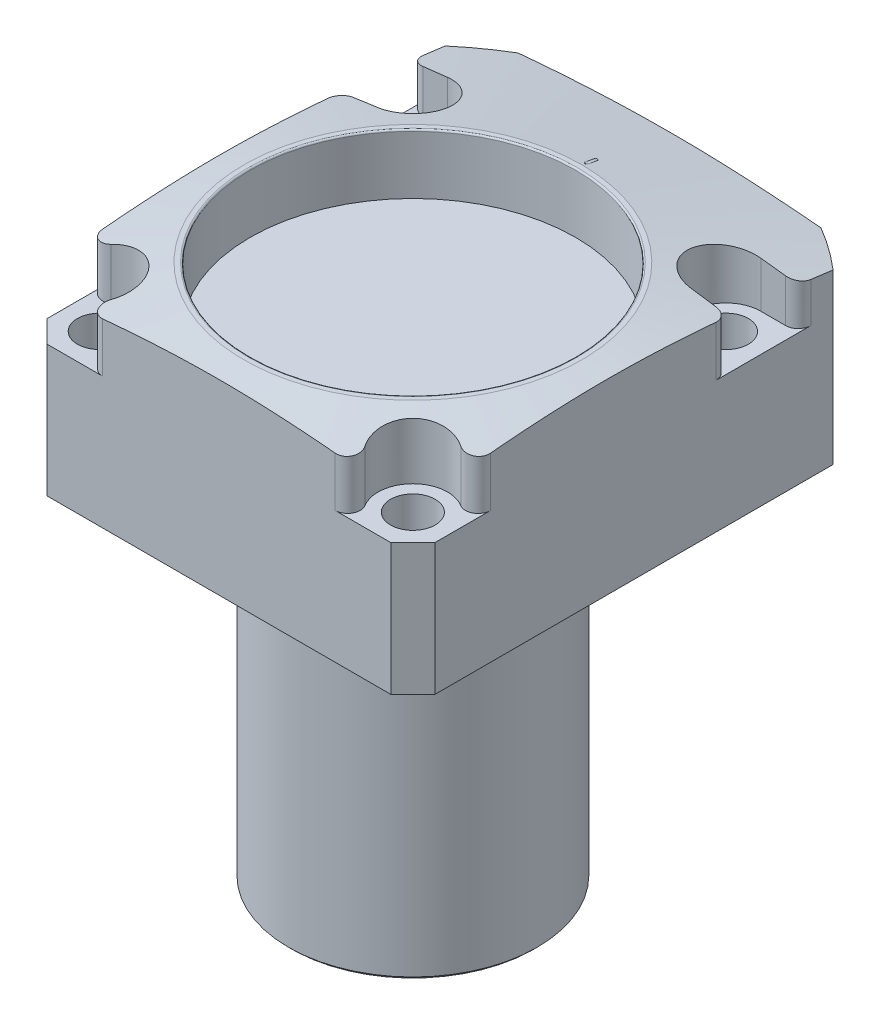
ISO-10303-21;
HEADER;
FILE_DESCRIPTION(('STEP AP214'),'2;1');
FILE_NAME('part.step','',(''),(''),'','','');
FILE_SCHEMA(('AUTOMOTIVE_DESIGN { 1 0 10303 214 1 1 1 1 }'));
ENDSEC;
DATA;
#1=APPLICATION_CONTEXT('core data for automotive mechanical design processes');
#2=APPLICATION_PROTOCOL_DEFINITION('international standard','automotive_design',2000,#1);
#3=PRODUCT_CONTEXT('',#1,'mechanical');
#4=PRODUCT('Part','Part','',(#3));
#5=PRODUCT_RELATED_PRODUCT_CATEGORY('part','',(#4));
#6=PRODUCT_DEFINITION_FORMATION('','',#4);
#7=PRODUCT_DEFINITION_CONTEXT('part definition',#1,'design');
#8=PRODUCT_DEFINITION('design','',#6,#7);
#9=PRODUCT_DEFINITION_SHAPE('','',#8);
#10=(LENGTH_UNIT() NAMED_UNIT(*) SI_UNIT(.MILLI.,.METRE.));
#11=(NAMED_UNIT(*) PLANE_ANGLE_UNIT() SI_UNIT($,.RADIAN.));
#12=(NAMED_UNIT(*) SI_UNIT($,.STERADIAN.) SOLID_ANGLE_UNIT());
#13=UNCERTAINTY_MEASURE_WITH_UNIT(LENGTH_MEASURE(1.E-05),#10,'distance_accuracy_value','');
#14=(GEOMETRIC_REPRESENTATION_CONTEXT(3) GLOBAL_UNCERTAINTY_ASSIGNED_CONTEXT((#13)) GLOBAL_UNIT_ASSIGNED_CONTEXT((#10,
#11,#12)) REPRESENTATION_CONTEXT('',''));
#15=CARTESIAN_POINT('',(0.,0.,0.));
#16=DIRECTION('',(0.,0.,1.));
#17=DIRECTION('',(1.,0.,0.));
#18=AXIS2_PLACEMENT_3D('',#15,#16,#17);
#19=CARTESIAN_POINT('',(0.,26.9194560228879,0.));
#20=DIRECTION('',(0.,-1.,0.));
#21=DIRECTION('',(0.,0.,-1.));
#22=AXIS2_PLACEMENT_3D('',#19,#20,#21);
#23=CONICAL_SURFACE('',#22,47.625,1.39626340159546);
#24=CARTESIAN_POINT('',(-0.101735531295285,30.3848630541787,-27.9715150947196));
#25=CARTESIAN_POINT('',(-0.114574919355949,30.3858506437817,-27.9658676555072));
#26=CARTESIAN_POINT('',(-0.126914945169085,30.3870289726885,-27.95913102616));
#27=CARTESIAN_POINT('',(-0.150266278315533,30.3897252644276,-27.943723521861));
#28=CARTESIAN_POINT('',(-0.161278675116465,30.3912429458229,-27.9350542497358));
#29=CARTESIAN_POINT('',(-0.18167124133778,30.3945785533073,-27.9160115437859));
#30=CARTESIAN_POINT('',(-0.191050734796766,30.3963966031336,-27.9056374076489));
#31=CARTESIAN_POINT('',(-0.207908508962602,30.4002806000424,-27.8834890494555));
#32=CARTESIAN_POINT('',(-0.215387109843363,30.4023465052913,-27.8717150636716));
#33=CARTESIAN_POINT('',(-0.228238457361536,30.4066698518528,-27.8470930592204));
#34=CARTESIAN_POINT('',(-0.233610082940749,30.4089273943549,-27.8342444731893));
#35=CARTESIAN_POINT('',(-0.242092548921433,30.4135700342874,-27.8078412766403));
#36=CARTESIAN_POINT('',(-0.245203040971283,30.4159551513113,-27.7942865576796));
#37=CARTESIAN_POINT('',(-0.249078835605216,30.4207901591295,-27.7668303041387));
#38=CARTESIAN_POINT('',(-0.249839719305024,30.4232401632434,-27.7529281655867));
#39=CARTESIAN_POINT('',(-0.248982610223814,30.4281311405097,-27.7251966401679));
#40=CARTESIAN_POINT('',(-0.247364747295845,30.4305721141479,-27.7113672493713));
#41=CARTESIAN_POINT('',(-0.241793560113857,30.4353775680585,-27.684162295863));
#42=CARTESIAN_POINT('',(-0.237838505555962,30.437741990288,-27.6707870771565));
#43=CARTESIAN_POINT('',(-0.227702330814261,30.442324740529,-27.6448813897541));
#44=CARTESIAN_POINT('',(-0.221521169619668,30.4445430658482,-27.6323509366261));
#45=CARTESIAN_POINT('',(-0.207112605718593,30.4487678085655,-27.608502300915));
#46=CARTESIAN_POINT('',(-0.198886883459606,30.450774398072,-27.5971831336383));
#47=CARTESIAN_POINT('',(-0.180618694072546,30.454519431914,-27.5760691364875));
#48=CARTESIAN_POINT('',(-0.170576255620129,30.4562578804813,-27.5662742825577));
#49=CARTESIAN_POINT('',(-0.148980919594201,30.4594125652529,-27.5485080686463));
#50=CARTESIAN_POINT('',(-0.137431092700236,30.460829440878,-27.5405330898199));
#51=CARTESIAN_POINT('',(-0.11313295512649,30.4633037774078,-27.5266108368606));
#52=CARTESIAN_POINT('',(-0.100384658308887,30.4643612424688,-27.5206635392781));
#53=CARTESIAN_POINT('',(-0.0740833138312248,30.4660834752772,-27.5109795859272));
#54=CARTESIAN_POINT('',(-0.0605322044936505,30.4667491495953,-27.5072378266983));
#55=CARTESIAN_POINT('',(-0.0329838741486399,30.4676719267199,-27.502051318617));
#56=CARTESIAN_POINT('',(-0.0189866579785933,30.4679290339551,-27.5006065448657));
#57=CARTESIAN_POINT('',(0.00903268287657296,30.468026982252,-27.5000561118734));
#58=CARTESIAN_POINT('',(0.0230547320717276,30.4678684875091,-27.5009467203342));
#59=CARTESIAN_POINT('',(0.0507477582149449,30.4671413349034,-27.5050334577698));
#60=CARTESIAN_POINT('',(0.0644187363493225,30.4665726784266,-27.5082295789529));
#61=CARTESIAN_POINT('',(0.0910198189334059,30.4650421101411,-27.5168347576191));
#62=CARTESIAN_POINT('',(0.103950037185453,30.4640802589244,-27.522243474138));
#63=CARTESIAN_POINT('',(0.128706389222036,30.4617915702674,-27.535118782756));
#64=CARTESIAN_POINT('',(0.1405325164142,30.4604647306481,-27.5425853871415));
#65=CARTESIAN_POINT('',(0.162762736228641,30.4574827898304,-27.5593747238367));
#66=CARTESIAN_POINT('',(0.173164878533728,30.4558272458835,-27.568699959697));
#67=CARTESIAN_POINT('',(0.192235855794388,30.4522371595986,-27.5889344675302));
#68=CARTESIAN_POINT('',(0.200904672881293,30.4503026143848,-27.599843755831));
#69=CARTESIAN_POINT('',(0.216283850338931,30.4462056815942,-27.6229631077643));
#70=CARTESIAN_POINT('',(0.222989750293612,30.4440427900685,-27.6351760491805));
#71=CARTESIAN_POINT('',(0.234229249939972,30.4395549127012,-27.6605360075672));
#72=CARTESIAN_POINT('',(0.238762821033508,30.4372299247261,-27.6736830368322));
#73=CARTESIAN_POINT('',(0.245538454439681,30.4324790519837,-27.7005683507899));
#74=CARTESIAN_POINT('',(0.247775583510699,30.4300529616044,-27.7143078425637));
#75=CARTESIAN_POINT('',(0.249878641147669,30.4251735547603,-27.7419625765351));
#76=CARTESIAN_POINT('',(0.249744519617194,30.4227202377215,-27.7558778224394));
#77=CARTESIAN_POINT('',(0.247107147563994,30.4178530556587,-27.7835056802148));
#78=CARTESIAN_POINT('',(0.244601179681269,30.4154392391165,-27.7972180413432));
#79=CARTESIAN_POINT('',(0.237286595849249,30.4107224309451,-27.8240327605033));
#80=CARTESIAN_POINT('',(0.232478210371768,30.4084194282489,-27.8371351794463));
#81=CARTESIAN_POINT('',(0.220697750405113,30.4039903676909,-27.8623503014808));
#82=CARTESIAN_POINT('',(0.213727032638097,30.4018641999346,-27.8744636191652));
#83=CARTESIAN_POINT('',(0.197812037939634,30.3978459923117,-27.8973700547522));
#84=CARTESIAN_POINT('',(0.188866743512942,30.3959540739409,-27.9081624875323));
#85=CARTESIAN_POINT('',(0.16926925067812,30.3924607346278,-27.9281003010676));
#86=CARTESIAN_POINT('',(0.158618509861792,30.3908590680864,-27.9372470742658));
#87=CARTESIAN_POINT('',(0.135921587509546,30.3879920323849,-27.9536266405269));
#88=CARTESIAN_POINT('',(0.12387867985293,30.3867258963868,-27.9608637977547));
#89=CARTESIAN_POINT('',(0.108157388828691,30.3853722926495,-27.9686031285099));
#90=CARTESIAN_POINT('',(0.104961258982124,30.3851116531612,-27.9700934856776));
#91=CARTESIAN_POINT('',(0.101735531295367,30.3848630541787,-27.9715150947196));
#92=B_SPLINE_CURVE_WITH_KNOTS('',3,(#24,#25,#26,#27,#28,#29,#30,#31,#32,#33,#34,#35,#36,#37,#38,
#39,#40,#41,#42,#43,#44,#45,#46,#47,#48,#49,#50,#51,#52,#53,#54,#55,#56,#57,#58,#59,#60,#61,#62,
#63,#64,#65,#66,#67,#68,#69,#70,#71,#72,#73,#74,#75,#76,#77,#78,#79,#80,#81,#82,#83,#84,#85,#86,
#87,#88,#89,#90,#91),.UNSPECIFIED.,.F.,.F.,(4,2,2,2,2,2,2,2,2,2,2,2,2,2,2,2,2,2,2,2,2,2,2,2,2,2,
2,2,2,2,2,2,2,4),(0.,0.0421266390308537,0.0842184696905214,0.126327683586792,0.16842980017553,
0.210554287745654,0.252685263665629,0.294895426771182,0.337103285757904,0.379342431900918,
0.421582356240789,0.463787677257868,0.505992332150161,0.548112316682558,0.59023181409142,
0.632253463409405,0.674274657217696,0.716228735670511,0.758182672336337,0.800130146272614,
0.842077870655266,0.88408248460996,0.926087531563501,0.968187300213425,1.01028762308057,
1.05247819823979,1.09466966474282,1.13690952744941,1.17914516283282,1.22135435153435,
1.26358534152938,1.30578042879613,1.3478782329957,1.35848311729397),.UNSPECIFIED.);
#93=CARTESIAN_POINT('',(-0.249527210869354,30.4243619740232,-27.7465686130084));
#94=VERTEX_POINT('',#93);
#95=CARTESIAN_POINT('',(0.249527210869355,30.4243619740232,-27.7465686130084));
#96=VERTEX_POINT('',#95);
#97=EDGE_CURVE('E13',#94,#96,#92,.T.);
#98=ORIENTED_EDGE('',*,*,#97,.F.);
#99=CARTESIAN_POINT('',(-0.249561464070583,30.1232863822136,-29.4541178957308));
#100=CARTESIAN_POINT('',(-0.249556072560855,30.1736752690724,-29.1683381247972));
#101=CARTESIAN_POINT('',(-0.249550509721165,30.2240641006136,-28.8825583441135));
#102=CARTESIAN_POINT('',(-0.249539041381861,30.3248416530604,-28.3109987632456));
#103=CARTESIAN_POINT('',(-0.249533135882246,30.3752303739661,-28.0252189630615));
#104=CARTESIAN_POINT('',(-0.249527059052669,30.425619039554,-27.7394391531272));
#105=B_SPLINE_CURVE_WITH_KNOTS('',3,(#99,#100,#101,#102,#103,#104),.UNSPECIFIED.,.F.,.F.,(4,2,
4),(0.,0.870564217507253,1.74112843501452),.UNSPECIFIED.);
#106=CARTESIAN_POINT('',(-0.249557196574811,30.1627949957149,-29.2300453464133));
#107=VERTEX_POINT('',#106);
#108=EDGE_CURVE('E55',#107,#94,#105,.T.);
#109=ORIENTED_EDGE('',*,*,#108,.F.);
#110=CARTESIAN_POINT('',(0.249452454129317,30.1640525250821,-29.2229141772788));
#111=CARTESIAN_POINT('',(0.249871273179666,30.1616076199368,-29.2367765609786));
#112=CARTESIAN_POINT('',(0.24908098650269,30.1591590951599,-29.2506703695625));
#113=CARTESIAN_POINT('',(0.24515727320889,30.1543241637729,-29.2781248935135));
#114=CARTESIAN_POINT('',(0.242025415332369,30.1519377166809,-29.2916858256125));
#115=CARTESIAN_POINT('',(0.233491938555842,30.1472917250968,-29.3181046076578));
#116=CARTESIAN_POINT('',(0.228089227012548,30.145032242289,-29.3309621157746));
#117=CARTESIAN_POINT('',(0.21517045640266,30.1407053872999,-29.3555992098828));
#118=CARTESIAN_POINT('',(0.207654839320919,30.1386379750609,-29.3673790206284));
#119=CARTESIAN_POINT('',(0.190720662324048,30.1347530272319,-29.3895269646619));
#120=CARTESIAN_POINT('',(0.181302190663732,30.1329354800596,-29.3998951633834));
#121=CARTESIAN_POINT('',(0.160826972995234,30.1296010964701,-29.4189248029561));
#122=CARTESIAN_POINT('',(0.149769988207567,30.128084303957,-29.4275859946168));
#123=CARTESIAN_POINT('',(0.126357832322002,30.1253974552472,-29.4429338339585));
#124=CARTESIAN_POINT('',(0.114005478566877,30.1242266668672,-29.4496246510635));
#125=CARTESIAN_POINT('',(0.0883348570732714,30.12226051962,-29.4608634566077));
#126=CARTESIAN_POINT('',(0.0750166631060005,30.1214651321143,-29.4654116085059));
#127=CARTESIAN_POINT('',(0.0478202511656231,30.1202732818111,-29.4722276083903));
#128=CARTESIAN_POINT('',(0.0339432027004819,30.1198760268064,-29.4744999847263));
#129=CARTESIAN_POINT('',(0.00599849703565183,30.1194888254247,-29.4767148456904));
#130=CARTESIAN_POINT('',(-0.00806916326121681,30.1194988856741,-29.4766572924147));
#131=CARTESIAN_POINT('',(-0.0359793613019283,30.1199258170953,-29.4742151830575));
#132=CARTESIAN_POINT('',(-0.0498221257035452,30.1203422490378,-29.4718331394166));
#133=CARTESIAN_POINT('',(-0.076905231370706,30.1215695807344,-29.4648143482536));
#134=CARTESIAN_POINT('',(-0.0901455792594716,30.1223804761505,-29.460177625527));
#135=CARTESIAN_POINT('',(-0.115653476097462,30.1243743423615,-29.4487806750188));
#136=CARTESIAN_POINT('',(-0.127920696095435,30.1255574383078,-29.4420197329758));
#137=CARTESIAN_POINT('',(-0.151130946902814,30.1282624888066,-29.4265684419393));
#138=CARTESIAN_POINT('',(-0.16207398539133,30.1297844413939,-29.4178781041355));
#139=CARTESIAN_POINT('',(-0.182343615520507,30.1331271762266,-29.3988015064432));
#140=CARTESIAN_POINT('',(-0.191667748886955,30.1349484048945,-29.3884127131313));
#141=CARTESIAN_POINT('',(-0.208419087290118,30.138837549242,-29.3662417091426));
#142=CARTESIAN_POINT('',(-0.215845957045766,30.1409055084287,-29.3544592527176));
#143=CARTESIAN_POINT('',(-0.228609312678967,30.1452351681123,-29.3298071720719));
#144=CARTESIAN_POINT('',(-0.233940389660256,30.1474973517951,-29.3169348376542));
#145=CARTESIAN_POINT('',(-0.242332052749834,30.1521466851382,-29.290498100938));
#146=CARTESIAN_POINT('',(-0.245394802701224,30.1545337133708,-29.2769343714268));
#147=CARTESIAN_POINT('',(-0.24820382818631,30.1581246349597,-29.2565447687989));
#148=CARTESIAN_POINT('',(-0.248845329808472,30.1593080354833,-29.2498276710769));
#149=CARTESIAN_POINT('',(-0.249567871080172,30.1616786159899,-29.236376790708));
#150=CARTESIAN_POINT('',(-0.249649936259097,30.162865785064,-29.2296430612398));
#151=CARTESIAN_POINT('',(-0.249452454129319,30.1640525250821,-29.2229141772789));
#152=B_SPLINE_CURVE_WITH_KNOTS('',3,(#110,#111,#112,#113,#114,#115,#116,#117,#118,#119,#120,
#121,#122,#123,#124,#125,#126,#127,#128,#129,#130,#131,#132,#133,#134,#135,#136,#137,#138,#139,
#140,#141,#142,#143,#144,#145,#146,#147,#148,#149,#150,#151),.UNSPECIFIED.,.F.,.F.,(4,2,2,2,2,2,
2,2,2,2,2,2,2,2,2,2,2,2,2,2,4),(0.,0.0421920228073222,0.0843558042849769,0.126539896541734,
0.168715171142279,0.210888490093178,0.253067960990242,0.295157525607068,0.337243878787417,
0.379246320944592,0.421249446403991,0.463207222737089,0.505164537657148,0.547135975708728,
0.589107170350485,0.631141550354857,0.673183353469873,0.715332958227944,0.757442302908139,
0.777974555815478,0.798469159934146),.UNSPECIFIED.);
#153=CARTESIAN_POINT('',(0.249557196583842,30.1627949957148,-29.2300453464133));
#154=VERTEX_POINT('',#153);
#155=EDGE_CURVE('E283',#154,#107,#152,.T.);
#156=ORIENTED_EDGE('',*,*,#155,.F.);
#157=CARTESIAN_POINT('',(0.249475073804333,30.8212428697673,-25.4956466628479));
#158=CARTESIAN_POINT('',(0.249488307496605,30.7286232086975,-26.0209438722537));
#159=CARTESIAN_POINT('',(0.249500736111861,30.6360032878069,-26.5462410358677));
#160=CARTESIAN_POINT('',(0.249517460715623,30.5041284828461,-27.2941718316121));
#161=CARTESIAN_POINT('',(0.249522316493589,30.4648737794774,-27.5168054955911));
#162=CARTESIAN_POINT('',(0.249539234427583,30.3248417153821,-28.3109987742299));
#163=CARTESIAN_POINT('',(0.249550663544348,30.224064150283,-28.8825583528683));
#164=CARTESIAN_POINT('',(0.249571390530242,30.0306645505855,-29.9794211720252));
#165=CARTESIAN_POINT('',(0.249580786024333,29.9380425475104,-30.5047244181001));
#166=CARTESIAN_POINT('',(0.249589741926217,29.8454204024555,-31.0300276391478));
#167=B_SPLINE_CURVE_WITH_KNOTS('',3,(#157,#158,#159,#160,#161,#162,#163,#164,#165,#166),
.UNSPECIFIED.,.F.,.F.,(4,2,2,2,4),(0.,1.60020000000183,2.27840359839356,4.01953203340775,
5.61975108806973),.UNSPECIFIED.);
#168=EDGE_CURVE('E288',#96,#154,#167,.T.);
#169=ORIENTED_EDGE('',*,*,#168,.F.);
#170=EDGE_LOOP('',(#98,#109,#156,#169));
#171=FACE_BOUND('',#170,.T.);
#172=CARTESIAN_POINT('',(39.363570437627,26.5276547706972,-30.5816000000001));
#173=CARTESIAN_POINT('',(38.2360001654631,26.6846288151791,-30.5816000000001));
#174=CARTESIAN_POINT('',(37.1080860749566,26.8391744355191,-30.5816000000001));
#175=CARTESIAN_POINT('',(34.8514532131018,27.1423769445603,-30.5816000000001));
#176=CARTESIAN_POINT('',(33.7227344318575,27.2910337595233,-30.5816000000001));
#177=CARTESIAN_POINT('',(31.4647682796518,27.5813758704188,-30.5816000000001));
#178=CARTESIAN_POINT('',(30.3355211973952,27.7230634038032,-30.5816000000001));
#179=CARTESIAN_POINT('',(28.0760221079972,27.9982279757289,-30.5816000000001));
#180=CARTESIAN_POINT('',(26.9457700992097,28.131705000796,-30.5816000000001));
#181=CARTESIAN_POINT('',(24.6839298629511,28.3889626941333,-30.5816000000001));
#182=CARTESIAN_POINT('',(23.5523414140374,28.5127414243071,-30.5816000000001));
#183=CARTESIAN_POINT('',(21.2879789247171,28.7488101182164,-30.5816000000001));
#184=CARTESIAN_POINT('',(20.1552049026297,28.8611002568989,-30.5816000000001));
#185=CARTESIAN_POINT('',(17.8880348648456,29.0722415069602,-30.5816000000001));
#186=CARTESIAN_POINT('',(16.7536384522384,29.1710883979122,-30.5816000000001));
#187=CARTESIAN_POINT('',(14.4835319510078,29.3531454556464,-30.5816000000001));
#188=CARTESIAN_POINT('',(13.3478217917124,29.4363547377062,-30.5816000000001));
#189=CARTESIAN_POINT('',(12.2114959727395,29.5106613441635,-30.5816000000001));
#190=B_SPLINE_CURVE_WITH_KNOTS('',3,(#172,#173,#174,#175,#176,#177,#178,#179,#180,#181,#182,
#183,#184,#185,#186,#187,#188,#189),.UNSPECIFIED.,.F.,.F.,(4,2,2,2,2,2,2,2,4),(0.,
3.41533894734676,6.83072064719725,10.2449986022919,13.6592821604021,17.0742462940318,
20.4891584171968,23.9051401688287,27.3213151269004),.UNSPECIFIED.);
#191=CARTESIAN_POINT('',(28.98775,27.8871444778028,-30.5816000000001));
#192=VERTEX_POINT('',#191);
#193=CARTESIAN_POINT('',(25.0189999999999,28.3500269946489,-30.5816000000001));
#194=VERTEX_POINT('',#193);
#195=EDGE_CURVE('E1504',#192,#194,#190,.T.);
#196=ORIENTED_EDGE('',*,*,#195,.F.);
#197=CARTESIAN_POINT('',(28.98775,27.8871444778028,-30.5816000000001));
#198=CARTESIAN_POINT('',(29.0448052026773,27.8802234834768,-30.5816003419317));
#199=CARTESIAN_POINT('',(29.1017929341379,27.8729884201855,-30.584034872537));
#200=CARTESIAN_POINT('',(29.2152734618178,27.8579451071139,-30.593727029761));
#201=CARTESIAN_POINT('',(29.2717663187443,27.8501369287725,-30.6009840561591));
#202=CARTESIAN_POINT('',(29.4397528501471,27.8259656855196,-30.6298821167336));
#203=CARTESIAN_POINT('',(29.5499926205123,27.8088269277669,-30.6586505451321));
#204=CARTESIAN_POINT('',(29.7637737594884,27.7730476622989,-30.7342567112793));
#205=CARTESIAN_POINT('',(29.8673143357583,27.7544069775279,-30.7810965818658));
#206=CARTESIAN_POINT('',(30.0649102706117,27.7161710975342,-30.8914479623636));
#207=CARTESIAN_POINT('',(30.1589656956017,27.6965759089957,-30.9549593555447));
#208=CARTESIAN_POINT('',(30.3358081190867,27.656812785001,-31.09749525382));
#209=CARTESIAN_POINT('',(30.4184843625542,27.6366412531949,-31.1766561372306));
#210=CARTESIAN_POINT('',(30.569245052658,27.596463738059,-31.3479052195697));
#211=CARTESIAN_POINT('',(30.6373259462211,27.576457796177,-31.4399965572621));
#212=CARTESIAN_POINT('',(30.7571717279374,27.5370888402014,-31.6349207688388));
#213=CARTESIAN_POINT('',(30.8088658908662,27.5177289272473,-31.7377977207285));
#214=CARTESIAN_POINT('',(30.8939536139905,27.480285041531,-31.9510325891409));
#215=CARTESIAN_POINT('',(30.9273621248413,27.4622000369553,-32.0613843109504));
#216=CARTESIAN_POINT('',(30.9654598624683,27.4346095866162,-32.2418564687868));
#217=CARTESIAN_POINT('',(30.9762804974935,27.4245365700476,-32.3106535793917));
#218=CARTESIAN_POINT('',(30.9907230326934,27.4051502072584,-32.4490045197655));
#219=CARTESIAN_POINT('',(30.9943550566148,27.3958358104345,-32.5185571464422));
#220=CARTESIAN_POINT('',(30.99435,27.3869383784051,-32.5882000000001));
#221=B_SPLINE_CURVE_WITH_KNOTS('',3,(#197,#198,#199,#200,#201,#202,#203,#204,#205,#206,#207,
#208,#209,#210,#211,#212,#213,#214,#215,#216,#217,#218,#219,#220),.UNSPECIFIED.,.F.,.F.,(4,2,2,
2,2,2,2,2,2,2,2,4),(0.,0.172310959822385,0.344600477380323,0.688469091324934,1.03237830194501,
1.37628510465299,1.72333268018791,2.07046464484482,2.41907505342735,2.76740000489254,
2.97815844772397,3.18861986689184),.UNSPECIFIED.);
#222=CARTESIAN_POINT('',(30.99435,27.3869383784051,-32.5882000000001));
#223=VERTEX_POINT('',#222);
#224=EDGE_CURVE('E786',#192,#223,#221,.T.);
#225=ORIENTED_EDGE('',*,*,#224,.T.);
#226=CARTESIAN_POINT('',(30.99435,20.8195298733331,-76.1536607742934));
#227=CARTESIAN_POINT('',(30.99435,21.1205155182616,-74.3105184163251));
#228=CARTESIAN_POINT('',(30.99435,21.4200513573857,-72.4671376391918));
#229=CARTESIAN_POINT('',(30.99435,22.015439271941,-68.7797746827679));
#230=CARTESIAN_POINT('',(30.99435,22.3112913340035,-66.9357925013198));
#231=CARTESIAN_POINT('',(30.99435,22.8984523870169,-63.2475738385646));
#232=CARTESIAN_POINT('',(30.99435,23.1897624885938,-61.4033375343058));
#233=CARTESIAN_POINT('',(30.99435,23.766831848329,-57.7139966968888));
#234=CARTESIAN_POINT('',(30.99435,24.0525911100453,-55.868892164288));
#235=CARTESIAN_POINT('',(30.99435,24.6169323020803,-52.1790298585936));
#236=CARTESIAN_POINT('',(30.99435,24.8955195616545,-50.334272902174));
#237=CARTESIAN_POINT('',(30.99435,25.443864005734,-46.643442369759));
#238=CARTESIAN_POINT('',(30.99435,25.7136211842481,-44.7973687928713));
#239=CARTESIAN_POINT('',(30.99435,26.2418632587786,-41.1029973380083));
#240=CARTESIAN_POINT('',(30.99435,26.5003445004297,-39.2546989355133));
#241=CARTESIAN_POINT('',(30.99435,27.002521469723,-35.5560815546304));
#242=CARTESIAN_POINT('',(30.99435,27.2462171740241,-33.7057625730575));
#243=CARTESIAN_POINT('',(30.99435,27.7153124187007,-29.993888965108));
#244=CARTESIAN_POINT('',(30.99435,27.9406199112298,-28.1323226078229));
#245=CARTESIAN_POINT('',(30.99435,28.365422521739,-24.4062107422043));
#246=CARTESIAN_POINT('',(30.99435,28.5649175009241,-22.5416652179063));
#247=CARTESIAN_POINT('',(30.99435,28.9300189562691,-18.8102869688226));
#248=CARTESIAN_POINT('',(30.99435,29.0956452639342,-16.9434562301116));
#249=CARTESIAN_POINT('',(30.99435,29.3117947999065,-14.1407192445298));
#250=CARTESIAN_POINT('',(30.99435,29.3784633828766,-13.206051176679));
#251=CARTESIAN_POINT('',(30.99435,29.4998479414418,-11.335943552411));
#252=CARTESIAN_POINT('',(30.99435,29.5545640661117,-10.400504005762));
#253=CARTESIAN_POINT('',(30.99435,29.6510141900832,-8.52756184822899));
#254=CARTESIAN_POINT('',(30.99435,29.6927288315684,-7.59005823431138));
#255=CARTESIAN_POINT('',(30.99435,29.7621266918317,-5.7145284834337));
#256=CARTESIAN_POINT('',(30.99435,29.7898099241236,-4.77650234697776));
#257=CARTESIAN_POINT('',(30.99435,29.830470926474,-2.90015217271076));
#258=CARTESIAN_POINT('',(30.99435,29.8434490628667,-1.96182814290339));
#259=CARTESIAN_POINT('',(30.99435,29.8543701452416,-0.0850921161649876));
#260=CARTESIAN_POINT('',(30.99435,29.8523130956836,0.853319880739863));
#261=CARTESIAN_POINT('',(30.99435,29.8332130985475,2.73036602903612));
#262=CARTESIAN_POINT('',(30.99435,29.8161641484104,3.66900011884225));
#263=CARTESIAN_POINT('',(30.99435,29.7675031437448,5.54588898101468));
#264=CARTESIAN_POINT('',(30.99435,29.7358910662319,6.48414375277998));
#265=CARTESIAN_POINT('',(30.99435,29.6588594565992,8.36008460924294));
#266=CARTESIAN_POINT('',(30.99435,29.6134398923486,9.29777069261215));
#267=CARTESIAN_POINT('',(30.99435,29.5097899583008,11.1724247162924));
#268=CARTESIAN_POINT('',(30.99435,29.4515596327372,12.1093926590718));
#269=CARTESIAN_POINT('',(30.99435,29.2949298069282,14.3991149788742));
#270=CARTESIAN_POINT('',(30.99435,29.1901837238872,15.7514359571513));
#271=CARTESIAN_POINT('',(30.99435,28.9599326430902,18.4543139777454));
#272=CARTESIAN_POINT('',(30.99435,28.834427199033,19.8048709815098));
#273=CARTESIAN_POINT('',(30.99435,28.5660872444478,22.5044193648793));
#274=CARTESIAN_POINT('',(30.99435,28.4232505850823,23.8534105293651));
#275=CARTESIAN_POINT('',(30.99435,28.1233058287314,26.5497836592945));
#276=CARTESIAN_POINT('',(30.99435,27.9661978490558,27.8971656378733));
#277=CARTESIAN_POINT('',(30.99435,27.6402057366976,30.5911402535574));
#278=CARTESIAN_POINT('',(30.99435,27.471316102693,31.9377322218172));
#279=CARTESIAN_POINT('',(30.99435,27.123944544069,34.6296757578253));
#280=CARTESIAN_POINT('',(30.99435,26.9454626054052,35.9750273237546));
#281=CARTESIAN_POINT('',(30.99435,26.580633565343,38.6645777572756));
#282=CARTESIAN_POINT('',(30.99435,26.3942869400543,40.0087766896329));
#283=CARTESIAN_POINT('',(30.99435,26.0150981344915,42.6962549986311));
#284=CARTESIAN_POINT('',(30.99435,25.8222559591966,44.039534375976));
#285=CARTESIAN_POINT('',(30.99435,25.4307937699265,46.7279826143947));
#286=CARTESIAN_POINT('',(30.99435,25.2321630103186,48.073149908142));
#287=CARTESIAN_POINT('',(30.99435,24.8303866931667,50.7628092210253));
#288=CARTESIAN_POINT('',(30.99435,24.6272411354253,52.1073012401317));
#289=CARTESIAN_POINT('',(30.99435,24.2171562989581,54.795719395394));
#290=CARTESIAN_POINT('',(30.99435,24.0102169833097,56.1396455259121));
#291=CARTESIAN_POINT('',(30.99435,23.5931274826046,58.82699974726));
#292=CARTESIAN_POINT('',(30.99435,23.3829772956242,60.170427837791));
#293=CARTESIAN_POINT('',(30.99435,22.7485688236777,64.1993118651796));
#294=CARTESIAN_POINT('',(30.99435,22.3202362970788,66.8841262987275));
#295=CARTESIAN_POINT('',(30.99435,21.4555766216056,72.252453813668));
#296=CARTESIAN_POINT('',(30.99435,21.019249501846,74.9359668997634));
#297=CARTESIAN_POINT('',(30.99435,20.1389321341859,80.3118068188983));
#298=CARTESIAN_POINT('',(30.99435,19.6949197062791,83.0041300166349));
#299=CARTESIAN_POINT('',(30.99435,18.8021915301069,88.3879979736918));
#300=CARTESIAN_POINT('',(30.99435,18.3534757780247,91.0795427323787));
#301=CARTESIAN_POINT('',(30.99435,17.4523093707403,96.4622517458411));
#302=CARTESIAN_POINT('',(30.99435,16.9998583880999,99.1534159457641));
#303=CARTESIAN_POINT('',(30.99435,16.0920061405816,104.535246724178));
#304=CARTESIAN_POINT('',(30.99435,15.6366048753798,107.225913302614));
#305=CARTESIAN_POINT('',(30.99435,14.7250623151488,112.597121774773));
#306=CARTESIAN_POINT('',(30.99435,14.2689296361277,115.277665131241));
#307=CARTESIAN_POINT('',(30.99435,13.354715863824,120.638419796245));
#308=CARTESIAN_POINT('',(30.99435,12.8966347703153,123.318631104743));
#309=CARTESIAN_POINT('',(30.99435,11.9789004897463,128.678526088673));
#310=CARTESIAN_POINT('',(30.99435,11.5192474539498,131.358209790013));
#311=CARTESIAN_POINT('',(30.99435,10.5985760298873,136.717341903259));
#312=CARTESIAN_POINT('',(30.99435,10.1375576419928,139.39679031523));
#313=CARTESIAN_POINT('',(30.99435,9.67598116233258,142.07614244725));
#314=B_SPLINE_CURVE_WITH_KNOTS('',3,(#226,#227,#228,#229,#230,#231,#232,#233,#234,#235,#236,
#237,#238,#239,#240,#241,#242,#243,#244,#245,#246,#247,#248,#249,#250,#251,#252,#253,#254,#255,
#256,#257,#258,#259,#260,#261,#262,#263,#264,#265,#266,#267,#268,#269,#270,#271,#272,#273,#274,
#275,#276,#277,#278,#279,#280,#281,#282,#283,#284,#285,#286,#287,#288,#289,#290,#291,#292,#293,
#294,#295,#296,#297,#298,#299,#300,#301,#302,#303,#304,#305,#306,#307,#308,#309,#310,#311,#312,
#313),.UNSPECIFIED.,.F.,.F.,(4,2,2,2,2,2,2,2,2,2,2,2,2,2,2,2,2,2,2,2,2,2,2,2,2,2,2,2,2,2,2,2,2,
2,2,2,2,2,2,2,2,2,2,4),(0.,5.60267044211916,11.2053612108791,16.8066597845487,22.4079547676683,
28.0049599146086,33.6019688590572,39.2007784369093,44.7995968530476,50.4249125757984,
56.0502585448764,61.6723011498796,64.4833660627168,67.294395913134,70.109591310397,
72.9247839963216,75.7399065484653,78.5550282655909,81.3712776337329,84.1875314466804,
87.0037918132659,89.8200424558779,93.8889537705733,97.9579525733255,102.027456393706,
106.09692676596,110.168310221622,114.239699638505,118.31084293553,122.381983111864,
126.461234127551,130.540485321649,134.619776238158,138.69906959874,146.855353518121,
155.011607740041,163.197673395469,171.383745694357,179.570543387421,187.757341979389,
195.914566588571,204.071792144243,212.228253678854,220.38471299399),.UNSPECIFIED.);
#315=CARTESIAN_POINT('',(30.99435,26.9194560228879,-36.1592435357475));
#316=VERTEX_POINT('',#315);
#317=EDGE_CURVE('E775',#223,#316,#314,.F.);
#318=ORIENTED_EDGE('',*,*,#317,.T.);
#319=CARTESIAN_POINT('',(0.,26.9194560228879,0.));
#320=DIRECTION('',(0.,-1.,0.));
#321=DIRECTION('',(0.,0.,-1.));
#322=AXIS2_PLACEMENT_3D('',#319,#320,#321);
#323=CIRCLE('',#322,47.625);
#324=CARTESIAN_POINT('',(24.2061791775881,26.9194560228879,-41.01465));
#325=VERTEX_POINT('',#324);
#326=EDGE_CURVE('E692',#325,#316,#323,.T.);
#327=ORIENTED_EDGE('',*,*,#326,.F.);
#328=CARTESIAN_POINT('',(-70.1821678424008,20.9837616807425,-41.01465));
#329=CARTESIAN_POINT('',(-69.2030317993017,21.1328196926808,-41.01465));
#330=CARTESIAN_POINT('',(-68.2237784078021,21.2811065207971,-41.01465));
#331=CARTESIAN_POINT('',(-66.265013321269,21.5759707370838,-41.01465));
#332=CARTESIAN_POINT('',(-65.285501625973,21.722548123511,-41.01465));
#333=CARTESIAN_POINT('',(-62.3465227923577,22.1594686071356,-41.01465));
#334=CARTESIAN_POINT('',(-60.3866357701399,22.4469963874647,-41.01465));
#335=CARTESIAN_POINT('',(-56.4651436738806,23.0129368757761,-41.01465));
#336=CARTESIAN_POINT('',(-54.5035383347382,23.2913477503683,-41.01465));
#337=CARTESIAN_POINT('',(-50.5787565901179,23.8368645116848,-41.01465));
#338=CARTESIAN_POINT('',(-48.6155801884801,24.1039704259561,-41.01465));
#339=CARTESIAN_POINT('',(-44.6931289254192,24.6234043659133,-41.01465));
#340=CARTESIAN_POINT('',(-42.7338595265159,24.8757734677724,-41.01465));
#341=CARTESIAN_POINT('',(-38.8131535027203,25.3631723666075,-41.01465));
#342=CARTESIAN_POINT('',(-36.851716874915,25.5982021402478,-41.01465));
#343=CARTESIAN_POINT('',(-32.926205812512,26.0466877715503,-41.01465));
#344=CARTESIAN_POINT('',(-30.9621311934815,26.2601420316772,-41.01465));
#345=CARTESIAN_POINT('',(-28.0139800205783,26.5602284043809,-41.01465));
#346=CARTESIAN_POINT('',(-27.0309239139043,26.6569079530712,-41.01465));
#347=CARTESIAN_POINT('',(-25.0640884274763,26.8428325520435,-41.01465));
#348=CARTESIAN_POINT('',(-24.0803090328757,26.9320774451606,-41.01465));
#349=CARTESIAN_POINT('',(-21.1178552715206,27.1883867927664,-41.01465));
#350=CARTESIAN_POINT('',(-19.1380803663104,27.3429906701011,-41.01465));
#351=CARTESIAN_POINT('',(-15.1758310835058,27.6125826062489,-41.01465));
#352=CARTESIAN_POINT('',(-13.193356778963,27.7275717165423,-41.01465));
#353=CARTESIAN_POINT('',(-10.2183873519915,27.8658826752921,-41.01465));
#354=CARTESIAN_POINT('',(-9.22667108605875,27.9062873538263,-41.01465));
#355=CARTESIAN_POINT('',(-7.24282661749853,27.9751428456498,-41.01465));
#356=CARTESIAN_POINT('',(-6.25069841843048,28.0035937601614,-41.01465));
#357=CARTESIAN_POINT('',(-4.26616571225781,28.0480934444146,-41.01465));
#358=CARTESIAN_POINT('',(-3.27376120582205,28.0641422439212,-41.01465));
#359=CARTESIAN_POINT('',(-1.28882546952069,28.08357927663,-41.01465));
#360=CARTESIAN_POINT('',(-0.296294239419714,28.0869674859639,-41.01465));
#361=CARTESIAN_POINT('',(1.69037231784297,28.0810220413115,-41.01465));
#362=CARTESIAN_POINT('',(2.68450758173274,28.0716673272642,-41.01465));
#363=CARTESIAN_POINT('',(4.67257783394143,28.0403530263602,-41.01465));
#364=CARTESIAN_POINT('',(5.66651282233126,28.018393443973,-41.01465));
#365=CARTESIAN_POINT('',(7.65403802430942,27.9622197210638,-41.01465));
#366=CARTESIAN_POINT('',(8.64762823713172,27.9280055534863,-41.01465));
#367=CARTESIAN_POINT('',(10.6343381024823,27.8478478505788,-41.01465));
#368=CARTESIAN_POINT('',(11.6274577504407,27.8019042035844,-41.01465));
#369=CARTESIAN_POINT('',(14.6066487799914,27.6474044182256,-41.01465));
#370=CARTESIAN_POINT('',(16.5918780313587,27.5221993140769,-41.01465));
#371=CARTESIAN_POINT('',(19.5675616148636,27.3057411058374,-41.01465));
#372=CARTESIAN_POINT('',(20.5591007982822,27.2288128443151,-41.01465));
#373=CARTESIAN_POINT('',(22.5414671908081,27.0662252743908,-41.01465));
#374=CARTESIAN_POINT('',(23.53229439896,26.9805659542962,-41.01465));
#375=CARTESIAN_POINT('',(26.8580374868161,26.6796458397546,-41.01465));
#376=CARTESIAN_POINT('',(29.1913266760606,26.4463293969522,-41.01465));
#377=CARTESIAN_POINT('',(33.8542224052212,25.9452996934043,-41.01465));
#378=CARTESIAN_POINT('',(36.1838288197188,25.677585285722,-41.01465));
#379=CARTESIAN_POINT('',(40.8400991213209,25.1155791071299,-41.01465));
#380=CARTESIAN_POINT('',(43.1667626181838,24.8212841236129,-41.01465));
#381=CARTESIAN_POINT('',(47.8173659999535,24.2122371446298,-41.01465));
#382=CARTESIAN_POINT('',(50.141305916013,23.8974853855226,-41.01465));
#383=CARTESIAN_POINT('',(54.7879736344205,23.2519889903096,-41.01465));
#384=CARTESIAN_POINT('',(57.1107004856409,22.921237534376,-41.01465));
#385=CARTESIAN_POINT('',(61.7543530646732,22.2473285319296,-41.01465));
#386=CARTESIAN_POINT('',(64.0752787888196,21.904170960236,-41.01465));
#387=CARTESIAN_POINT('',(68.7154892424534,21.2080773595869,-41.01465));
#388=CARTESIAN_POINT('',(71.0347740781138,20.8551420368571,-41.01465));
#389=CARTESIAN_POINT('',(75.6721339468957,20.1414372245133,-41.01465));
#390=CARTESIAN_POINT('',(77.9902089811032,19.7806677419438,-41.01465));
#391=CARTESIAN_POINT('',(82.6153765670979,19.0543641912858,-41.01465));
#392=CARTESIAN_POINT('',(84.9224734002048,18.6888573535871,-41.01465));
#393=CARTESIAN_POINT('',(89.5358472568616,17.9527089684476,-41.01465));
#394=CARTESIAN_POINT('',(91.8421242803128,17.5820674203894,-41.01465));
#395=CARTESIAN_POINT('',(96.4540399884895,16.8365346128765,-41.01465));
#396=CARTESIAN_POINT('',(98.7596786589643,16.4616432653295,-41.01465));
#397=CARTESIAN_POINT('',(103.370377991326,15.7083223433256,-41.01465));
#398=CARTESIAN_POINT('',(105.675438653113,15.3298927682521,-41.01465));
#399=CARTESIAN_POINT('',(110.282306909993,14.570511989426,-41.01465));
#400=CARTESIAN_POINT('',(112.584115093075,14.189564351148,-41.01465));
#401=CARTESIAN_POINT('',(117.187312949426,13.4251483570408,-41.01465));
#402=CARTESIAN_POINT('',(119.488702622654,13.0416800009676,-41.01465));
#403=CARTESIAN_POINT('',(124.091058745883,12.2726017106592,-41.01465));
#404=CARTESIAN_POINT('',(126.392025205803,11.8869918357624,-41.01465));
#405=CARTESIAN_POINT('',(130.993644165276,11.1139087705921,-41.01465));
#406=CARTESIAN_POINT('',(133.294296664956,10.7264355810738,-41.01465));
#407=CARTESIAN_POINT('',(135.594816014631,10.3381749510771,-41.01465));
#408=B_SPLINE_CURVE_WITH_KNOTS('',3,(#328,#329,#330,#331,#332,#333,#334,#335,#336,#337,#338,
#339,#340,#341,#342,#343,#344,#345,#346,#347,#348,#349,#350,#351,#352,#353,#354,#355,#356,#357,
#358,#359,#360,#361,#362,#363,#364,#365,#366,#367,#368,#369,#370,#371,#372,#373,#374,#375,#376,
#377,#378,#379,#380,#381,#382,#383,#384,#385,#386,#387,#388,#389,#390,#391,#392,#393,#394,#395,
#396,#397,#398,#399,#400,#401,#402,#403,#404,#405,#406,#407),.UNSPECIFIED.,.F.,.F.,(4,2,2,2,2,2,
2,2,2,2,2,2,2,2,2,2,2,2,2,2,2,2,2,2,2,2,2,2,2,2,2,2,2,2,2,2,2,2,2,4),(0.,2.97125019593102,
5.94250342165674,11.8850822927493,17.8288489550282,23.7726011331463,29.69890660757,
35.6252200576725,41.5519719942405,44.5153429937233,47.4787766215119,53.4358455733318,
59.3927563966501,62.3703125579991,65.3478435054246,68.3253673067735,71.3028967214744,
74.2853530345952,77.2678082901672,80.2502701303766,83.2327603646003,89.1997638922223,
92.1832939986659,95.1668281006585,102.201228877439,109.235864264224,116.271351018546,
123.306756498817,130.34518769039,137.38363316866,144.421571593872,151.459503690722,
158.467108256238,165.474713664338,172.4824645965,179.490216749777,186.489570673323,
193.488925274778,200.488086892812,207.487245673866),.UNSPECIFIED.);
#409=CARTESIAN_POINT('',(-24.2061791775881,26.9194560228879,-41.01465));
#410=VERTEX_POINT('',#409);
#411=EDGE_CURVE('E638',#325,#410,#408,.F.);
#412=ORIENTED_EDGE('',*,*,#411,.T.);
#413=CARTESIAN_POINT('',(-30.99435,26.9194560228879,-36.1592435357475));
#414=VERTEX_POINT('',#413);
#415=EDGE_CURVE('E691',#414,#410,#323,.T.);
#416=ORIENTED_EDGE('',*,*,#415,.F.);
#417=CARTESIAN_POINT('',(-30.99435,20.8195298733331,-76.1536607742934));
#418=CARTESIAN_POINT('',(-30.99435,21.1205155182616,-74.3105184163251));
#419=CARTESIAN_POINT('',(-30.99435,21.4200513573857,-72.4671376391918));
#420=CARTESIAN_POINT('',(-30.99435,22.015439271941,-68.7797746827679));
#421=CARTESIAN_POINT('',(-30.99435,22.3112913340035,-66.9357925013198));
#422=CARTESIAN_POINT('',(-30.99435,22.8984523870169,-63.2475738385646));
#423=CARTESIAN_POINT('',(-30.99435,23.1897624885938,-61.4033375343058));
#424=CARTESIAN_POINT('',(-30.99435,23.766831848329,-57.7139966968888));
#425=CARTESIAN_POINT('',(-30.99435,24.0525911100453,-55.868892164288));
#426=CARTESIAN_POINT('',(-30.99435,24.6169323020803,-52.1790298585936));
#427=CARTESIAN_POINT('',(-30.99435,24.8955195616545,-50.334272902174));
#428=CARTESIAN_POINT('',(-30.99435,25.443864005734,-46.643442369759));
#429=CARTESIAN_POINT('',(-30.99435,25.7136211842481,-44.7973687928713));
#430=CARTESIAN_POINT('',(-30.99435,26.2418632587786,-41.1029973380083));
#431=CARTESIAN_POINT('',(-30.99435,26.5003445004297,-39.2546989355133));
#432=CARTESIAN_POINT('',(-30.99435,27.002521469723,-35.5560815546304));
#433=CARTESIAN_POINT('',(-30.99435,27.2462171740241,-33.7057625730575));
#434=CARTESIAN_POINT('',(-30.99435,27.7153124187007,-29.993888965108));
#435=CARTESIAN_POINT('',(-30.99435,27.9406199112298,-28.1323226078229));
#436=CARTESIAN_POINT('',(-30.99435,28.365422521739,-24.4062107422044));
#437=CARTESIAN_POINT('',(-30.99435,28.5649175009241,-22.5416652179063));
#438=CARTESIAN_POINT('',(-30.99435,28.9300189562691,-18.8102869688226));
#439=CARTESIAN_POINT('',(-30.99435,29.0956452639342,-16.9434562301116));
#440=CARTESIAN_POINT('',(-30.99435,29.3117947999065,-14.1407192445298));
#441=CARTESIAN_POINT('',(-30.99435,29.3784633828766,-13.206051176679));
#442=CARTESIAN_POINT('',(-30.99435,29.4998479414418,-11.335943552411));
#443=CARTESIAN_POINT('',(-30.99435,29.5545640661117,-10.400504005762));
#444=CARTESIAN_POINT('',(-30.99435,29.6510141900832,-8.527561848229));
#445=CARTESIAN_POINT('',(-30.99435,29.6927288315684,-7.59005823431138));
#446=CARTESIAN_POINT('',(-30.99435,29.7621266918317,-5.71452848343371));
#447=CARTESIAN_POINT('',(-30.99435,29.7898099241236,-4.77650234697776));
#448=CARTESIAN_POINT('',(-30.99435,29.830470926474,-2.90015217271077));
#449=CARTESIAN_POINT('',(-30.99435,29.8434490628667,-1.9618281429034));
#450=CARTESIAN_POINT('',(-30.99435,29.8543701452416,-0.0850921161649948));
#451=CARTESIAN_POINT('',(-30.99435,29.8523130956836,0.853319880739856));
#452=CARTESIAN_POINT('',(-30.99435,29.8332130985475,2.73036602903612));
#453=CARTESIAN_POINT('',(-30.99435,29.8161641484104,3.66900011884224));
#454=CARTESIAN_POINT('',(-30.99435,29.7675031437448,5.54588898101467));
#455=CARTESIAN_POINT('',(-30.99435,29.7358910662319,6.48414375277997));
#456=CARTESIAN_POINT('',(-30.99435,29.6588594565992,8.36008460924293));
#457=CARTESIAN_POINT('',(-30.99435,29.6134398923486,9.29777069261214));
#458=CARTESIAN_POINT('',(-30.99435,29.5097899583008,11.1724247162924));
#459=CARTESIAN_POINT('',(-30.99435,29.4515596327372,12.1093926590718));
#460=CARTESIAN_POINT('',(-30.99435,29.2949298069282,14.3991149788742));
#461=CARTESIAN_POINT('',(-30.99435,29.1901837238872,15.7514359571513));
#462=CARTESIAN_POINT('',(-30.99435,28.9599326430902,18.4543139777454));
#463=CARTESIAN_POINT('',(-30.99435,28.834427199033,19.8048709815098));
#464=CARTESIAN_POINT('',(-30.99435,28.5660872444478,22.5044193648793));
#465=CARTESIAN_POINT('',(-30.99435,28.4232505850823,23.8534105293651));
#466=CARTESIAN_POINT('',(-30.99435,28.1233058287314,26.5497836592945));
#467=CARTESIAN_POINT('',(-30.99435,27.9661978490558,27.8971656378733));
#468=CARTESIAN_POINT('',(-30.99435,27.6402057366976,30.5911402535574));
#469=CARTESIAN_POINT('',(-30.99435,27.471316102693,31.9377322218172));
#470=CARTESIAN_POINT('',(-30.99435,27.123944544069,34.6296757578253));
#471=CARTESIAN_POINT('',(-30.99435,26.9454626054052,35.9750273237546));
#472=CARTESIAN_POINT('',(-30.99435,26.580633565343,38.6645777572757));
#473=CARTESIAN_POINT('',(-30.99435,26.3942869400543,40.0087766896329));
#474=CARTESIAN_POINT('',(-30.99435,26.0150981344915,42.6962549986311));
#475=CARTESIAN_POINT('',(-30.99435,25.8222559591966,44.039534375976));
#476=CARTESIAN_POINT('',(-30.99435,25.4307937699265,46.7279826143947));
#477=CARTESIAN_POINT('',(-30.99435,25.2321630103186,48.073149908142));
#478=CARTESIAN_POINT('',(-30.99435,24.8303866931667,50.7628092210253));
#479=CARTESIAN_POINT('',(-30.99435,24.6272411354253,52.1073012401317));
#480=CARTESIAN_POINT('',(-30.99435,24.2171562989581,54.795719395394));
#481=CARTESIAN_POINT('',(-30.99435,24.0102169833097,56.1396455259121));
#482=CARTESIAN_POINT('',(-30.99435,23.5931274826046,58.82699974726));
#483=CARTESIAN_POINT('',(-30.99435,23.3829772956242,60.170427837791));
#484=CARTESIAN_POINT('',(-30.99435,22.7485688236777,64.1993118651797));
#485=CARTESIAN_POINT('',(-30.99435,22.3202362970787,66.8841262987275));
#486=CARTESIAN_POINT('',(-30.99435,21.4555766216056,72.252453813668));
#487=CARTESIAN_POINT('',(-30.99435,21.019249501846,74.9359668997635));
#488=CARTESIAN_POINT('',(-30.99435,20.1389321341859,80.3118068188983));
#489=CARTESIAN_POINT('',(-30.99435,19.6949197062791,83.0041300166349));
#490=CARTESIAN_POINT('',(-30.99435,18.8021915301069,88.3879979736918));
#491=CARTESIAN_POINT('',(-30.99435,18.3534757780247,91.0795427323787));
#492=CARTESIAN_POINT('',(-30.99435,17.4523093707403,96.4622517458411));
#493=CARTESIAN_POINT('',(-30.99435,16.9998583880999,99.1534159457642));
#494=CARTESIAN_POINT('',(-30.99435,16.0920061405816,104.535246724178));
#495=CARTESIAN_POINT('',(-30.99435,15.6366048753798,107.225913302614));
#496=CARTESIAN_POINT('',(-30.99435,14.7250623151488,112.597121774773));
#497=CARTESIAN_POINT('',(-30.99435,14.2689296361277,115.277665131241));
#498=CARTESIAN_POINT('',(-30.99435,13.354715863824,120.638419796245));
#499=CARTESIAN_POINT('',(-30.99435,12.8966347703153,123.318631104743));
#500=CARTESIAN_POINT('',(-30.99435,11.9789004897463,128.678526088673));
#501=CARTESIAN_POINT('',(-30.99435,11.5192474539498,131.358209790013));
#502=CARTESIAN_POINT('',(-30.99435,10.5985760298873,136.717341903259));
#503=CARTESIAN_POINT('',(-30.99435,10.1375576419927,139.39679031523));
#504=CARTESIAN_POINT('',(-30.99435,9.67598116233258,142.07614244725));
#505=B_SPLINE_CURVE_WITH_KNOTS('',3,(#417,#418,#419,#420,#421,#422,#423,#424,#425,#426,#427,
#428,#429,#430,#431,#432,#433,#434,#435,#436,#437,#438,#439,#440,#441,#442,#443,#444,#445,#446,
#447,#448,#449,#450,#451,#452,#453,#454,#455,#456,#457,#458,#459,#460,#461,#462,#463,#464,#465,
#466,#467,#468,#469,#470,#471,#472,#473,#474,#475,#476,#477,#478,#479,#480,#481,#482,#483,#484,
#485,#486,#487,#488,#489,#490,#491,#492,#493,#494,#495,#496,#497,#498,#499,#500,#501,#502,#503,
#504),.UNSPECIFIED.,.F.,.F.,(4,2,2,2,2,2,2,2,2,2,2,2,2,2,2,2,2,2,2,2,2,2,2,2,2,2,2,2,2,2,2,2,2,
2,2,2,2,2,2,2,2,2,2,4),(0.,5.60267044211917,11.2053612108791,16.8066597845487,22.4079547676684,
28.0049599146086,33.6019688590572,39.2007784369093,44.7995968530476,50.4249125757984,
56.0502585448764,61.6723011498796,64.4833660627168,67.294395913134,70.109591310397,
72.9247839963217,75.7399065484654,78.555028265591,81.3712776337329,84.1875314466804,
87.0037918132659,89.8200424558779,93.8889537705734,97.9579525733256,102.027456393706,
106.09692676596,110.168310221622,114.239699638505,118.310842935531,122.381983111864,
126.461234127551,130.540485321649,134.619776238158,138.69906959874,146.855353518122,
155.011607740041,163.197673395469,171.383745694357,179.570543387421,187.757341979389,
195.914566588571,204.071792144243,212.228253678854,220.38471299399),.UNSPECIFIED.);
#506=CARTESIAN_POINT('',(-30.99435,27.3869383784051,-32.5882000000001));
#507=VERTEX_POINT('',#506);
#508=EDGE_CURVE('E670',#414,#507,#505,.T.);
#509=ORIENTED_EDGE('',*,*,#508,.T.);
#510=CARTESIAN_POINT('',(-30.99435,27.3869383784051,-32.5882000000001));
#511=CARTESIAN_POINT('',(-30.9943496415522,27.3942360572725,-32.5310833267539));
#512=CARTESIAN_POINT('',(-30.9919098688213,27.4018127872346,-32.4740315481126));
#513=CARTESIAN_POINT('',(-30.9821954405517,27.4174777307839,-32.3604184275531));
#514=CARTESIAN_POINT('',(-30.9749213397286,27.4255658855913,-32.3038570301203));
#515=CARTESIAN_POINT('',(-30.9459514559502,27.450496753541,-32.1356551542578));
#516=CARTESIAN_POINT('',(-30.9171077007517,27.4680355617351,-32.0252646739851));
#517=CARTESIAN_POINT('',(-30.8412888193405,27.5044610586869,-31.8111845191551));
#518=CARTESIAN_POINT('',(-30.7943107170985,27.5233479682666,-31.7074959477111));
#519=CARTESIAN_POINT('',(-30.6836229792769,27.5619662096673,-31.5096357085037));
#520=CARTESIAN_POINT('',(-30.6199138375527,27.5816975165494,-31.4154637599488));
#521=CARTESIAN_POINT('',(-30.4770097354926,27.6216247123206,-31.2385385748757));
#522=CARTESIAN_POINT('',(-30.3976953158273,27.6418230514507,-31.1558824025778));
#523=CARTESIAN_POINT('',(-30.2261211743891,27.6819680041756,-31.0051910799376));
#524=CARTESIAN_POINT('',(-30.1338581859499,27.7019145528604,-30.9371596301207));
#525=CARTESIAN_POINT('',(-29.9386667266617,27.7410361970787,-30.8175067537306));
#526=CARTESIAN_POINT('',(-29.8357037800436,27.7602085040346,-30.7659406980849));
#527=CARTESIAN_POINT('',(-29.6222995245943,27.7971227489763,-30.6811217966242));
#528=CARTESIAN_POINT('',(-29.5118646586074,27.8148658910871,-30.6478533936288));
#529=CARTESIAN_POINT('',(-29.3317618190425,27.8416607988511,-30.6101000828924));
#530=CARTESIAN_POINT('',(-29.2634277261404,27.8513535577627,-30.5994260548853));
#531=CARTESIAN_POINT('',(-29.1260094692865,27.8698994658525,-30.5851785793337));
#532=CARTESIAN_POINT('',(-29.0569264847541,27.8787537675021,-30.5815952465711));
#533=CARTESIAN_POINT('',(-28.98775,27.8871444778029,-30.5816000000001));
#534=B_SPLINE_CURVE_WITH_KNOTS('',3,(#510,#511,#512,#513,#514,#515,#516,#517,#518,#519,#520,
#521,#522,#523,#524,#525,#526,#527,#528,#529,#530,#531,#532,#533),.UNSPECIFIED.,.F.,.F.,(4,2,2,
2,2,2,2,2,2,2,2,4),(0.,0.172633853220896,0.345247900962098,0.689782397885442,1.0343734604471,
1.37895435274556,1.72628356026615,2.07370055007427,2.42227384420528,2.77055031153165,
2.97972832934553,3.18861452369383),.UNSPECIFIED.);
#535=CARTESIAN_POINT('',(-28.98775,27.8871444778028,-30.5816000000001));
#536=VERTEX_POINT('',#535);
#537=EDGE_CURVE('E590',#507,#536,#534,.T.);
#538=ORIENTED_EDGE('',*,*,#537,.T.);
#539=CARTESIAN_POINT('',(-16.6524209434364,29.1770572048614,-30.5816000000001));
#540=CARTESIAN_POINT('',(-17.7869370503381,29.0813583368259,-30.5816000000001));
#541=CARTESIAN_POINT('',(-18.9208015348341,28.9782348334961,-30.5816000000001));
#542=CARTESIAN_POINT('',(-21.1872436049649,28.7591067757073,-30.5816000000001));
#543=CARTESIAN_POINT('',(-22.3198212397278,28.6431027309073,-30.5816000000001));
#544=CARTESIAN_POINT('',(-24.5835638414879,28.4001988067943,-30.5816000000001));
#545=CARTESIAN_POINT('',(-25.7147290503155,28.2733011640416,-30.5816000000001));
#546=CARTESIAN_POINT('',(-27.9759932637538,28.0102626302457,-30.5816000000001));
#547=CARTESIAN_POINT('',(-29.1060922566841,27.8741216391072,-30.5816000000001));
#548=CARTESIAN_POINT('',(-31.3651705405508,27.5940613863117,-30.5816000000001));
#549=CARTESIAN_POINT('',(-32.4941499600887,27.4501431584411,-30.5816000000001));
#550=CARTESIAN_POINT('',(-34.7512461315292,27.1557230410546,-30.5816000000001));
#551=CARTESIAN_POINT('',(-35.8793628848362,27.0052211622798,-30.5816000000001));
#552=CARTESIAN_POINT('',(-38.135076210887,26.6986226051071,-30.5816000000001));
#553=CARTESIAN_POINT('',(-39.2626726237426,26.5425247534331,-30.5816000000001));
#554=CARTESIAN_POINT('',(-41.5171895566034,26.2255771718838,-30.5816000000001));
#555=CARTESIAN_POINT('',(-42.6441100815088,26.0647274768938,-30.5816000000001));
#556=CARTESIAN_POINT('',(-43.7707421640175,25.9019071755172,-30.5816000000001));
#557=B_SPLINE_CURVE_WITH_KNOTS('',3,(#539,#540,#541,#542,#543,#544,#545,#546,#547,#548,#549,
#550,#551,#552,#553,#554,#555,#556),.UNSPECIFIED.,.F.,.F.,(4,2,2,2,2,2,2,2,4),(0.,
3.41557456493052,6.83101403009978,10.2457539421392,13.6605308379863,17.0748549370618,
20.4891734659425,23.9042120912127,27.3192256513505),.UNSPECIFIED.);
#558=CARTESIAN_POINT('',(-25.0189999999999,28.3500269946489,-30.5816000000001));
#559=VERTEX_POINT('',#558);
#560=EDGE_CURVE('E1553',#559,#536,#557,.T.);
#561=ORIENTED_EDGE('',*,*,#560,.F.);
#562=CARTESIAN_POINT('',(-25.0191999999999,29.7285149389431,-19.4564000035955));
#563=CARTESIAN_POINT('',(-24.8647125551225,29.7500205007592,-19.4563785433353));
#564=CARTESIAN_POINT('',(-24.7101156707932,29.7707666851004,-19.4628241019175));
#565=CARTESIAN_POINT('',(-24.4017688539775,29.8105420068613,-19.4885900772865));
#566=CARTESIAN_POINT('',(-24.2480189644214,29.8295710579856,-19.5079111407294));
#567=CARTESIAN_POINT('',(-23.9424527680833,29.8657110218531,-19.5593680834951));
#568=CARTESIAN_POINT('',(-23.7906363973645,29.882821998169,-19.5915035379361));
#569=CARTESIAN_POINT('',(-23.4900165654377,29.9149397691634,-19.668411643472));
#570=CARTESIAN_POINT('',(-23.3412129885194,29.9299466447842,-19.7131838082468));
#571=CARTESIAN_POINT('',(-23.0475677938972,29.9576969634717,-19.8151409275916));
#572=CARTESIAN_POINT('',(-22.9027294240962,29.9704385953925,-19.8723357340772));
#573=CARTESIAN_POINT('',(-22.6181443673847,29.9934968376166,-19.998774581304));
#574=CARTESIAN_POINT('',(-22.4783995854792,30.0038125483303,-20.0680230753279));
#575=CARTESIAN_POINT('',(-22.2052059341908,30.0218786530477,-20.2180266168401));
#576=CARTESIAN_POINT('',(-22.0717519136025,30.0296311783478,-20.2987720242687));
#577=CARTESIAN_POINT('',(-21.8119599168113,30.0424874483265,-20.471282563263));
#578=CARTESIAN_POINT('',(-21.6856245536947,30.0475902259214,-20.5630517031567));
#579=CARTESIAN_POINT('',(-21.4426299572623,30.0550293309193,-20.7556882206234));
#580=CARTESIAN_POINT('',(-21.3258677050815,30.0574001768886,-20.8564243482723));
#581=CARTESIAN_POINT('',(-21.1010544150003,30.0594627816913,-21.0672938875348));
#582=CARTESIAN_POINT('',(-20.9930065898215,30.0591535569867,-21.1774307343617));
#583=CARTESIAN_POINT('',(-20.7864697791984,30.0558579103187,-21.4062508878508));
#584=CARTESIAN_POINT('',(-20.687978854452,30.0528720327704,-21.5249324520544));
#585=CARTESIAN_POINT('',(-20.5011949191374,30.0442599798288,-21.7700452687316));
#586=CARTESIAN_POINT('',(-20.412905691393,30.0386328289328,-21.8964793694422));
#587=CARTESIAN_POINT('',(-20.2477359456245,30.0248544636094,-22.1552675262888));
#588=CARTESIAN_POINT('',(-20.1707830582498,30.0167203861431,-22.2875763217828));
#589=CARTESIAN_POINT('',(-20.0280725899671,29.9980109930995,-22.5579952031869));
#590=CARTESIAN_POINT('',(-19.9623191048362,29.9874347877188,-22.6961073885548));
#591=CARTESIAN_POINT('',(-19.8424894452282,29.9639718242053,-22.9770480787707));
#592=CARTESIAN_POINT('',(-19.788408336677,29.9510860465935,-23.1198745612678));
#593=CARTESIAN_POINT('',(-19.6921992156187,29.9231427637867,-23.4093450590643));
#594=CARTESIAN_POINT('',(-19.6500756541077,29.9080844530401,-23.5559904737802));
#595=CARTESIAN_POINT('',(-19.5777145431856,29.875811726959,-23.8534280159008));
#596=CARTESIAN_POINT('',(-19.547591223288,29.8585785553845,-24.0042460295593));
#597=CARTESIAN_POINT('',(-19.4999316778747,29.8222557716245,-24.3076345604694));
#598=CARTESIAN_POINT('',(-19.4823998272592,29.8031655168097,-24.4602056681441));
#599=CARTESIAN_POINT('',(-19.4488783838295,29.7433865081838,-24.9190075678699));
#600=CARTESIAN_POINT('',(-19.4518956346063,29.7001590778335,-25.2266050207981));
#601=CARTESIAN_POINT('',(-19.4943589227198,29.631175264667,-25.6863037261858));
#602=CARTESIAN_POINT('',(-19.5152215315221,29.6072425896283,-25.8407110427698));
#603=CARTESIAN_POINT('',(-19.5697690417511,29.5582843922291,-26.1470734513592));
#604=CARTESIAN_POINT('',(-19.6034498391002,29.5332592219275,-26.2990293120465));
#605=CARTESIAN_POINT('',(-19.6833887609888,29.4823219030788,-26.5994957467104));
#606=CARTESIAN_POINT('',(-19.7296520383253,29.4564093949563,-26.7480048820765));
#607=CARTESIAN_POINT('',(-19.834382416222,29.4039242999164,-27.040477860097));
#608=CARTESIAN_POINT('',(-19.8928452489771,29.377351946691,-27.184443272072));
#609=CARTESIAN_POINT('',(-20.0226354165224,29.3232986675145,-27.4692564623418));
#610=CARTESIAN_POINT('',(-20.0941602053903,29.2958099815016,-27.6100128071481));
#611=CARTESIAN_POINT('',(-20.2488560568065,29.2405725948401,-27.8848512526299));
#612=CARTESIAN_POINT('',(-20.332023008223,29.212823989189,-28.0189356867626));
#613=CARTESIAN_POINT('',(-20.5094664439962,29.1572483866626,-28.2795969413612));
#614=CARTESIAN_POINT('',(-20.6037469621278,29.1294213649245,-28.4061710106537));
#615=CARTESIAN_POINT('',(-20.8026964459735,29.073903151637,-28.6508250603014));
#616=CARTESIAN_POINT('',(-20.9073615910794,29.0462119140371,-28.7689081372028));
#617=CARTESIAN_POINT('',(-21.1271554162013,28.9909460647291,-28.9965970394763));
#618=CARTESIAN_POINT('',(-21.2423526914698,28.9633736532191,-29.1061371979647));
#619=CARTESIAN_POINT('',(-21.4817203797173,28.9087354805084,-29.314973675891));
#620=CARTESIAN_POINT('',(-21.6058874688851,28.8816695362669,-29.4142737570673));
#621=CARTESIAN_POINT('',(-21.8624466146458,28.8281877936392,-29.6020091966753));
#622=CARTESIAN_POINT('',(-21.9948442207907,28.8017724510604,-29.6904371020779));
#623=CARTESIAN_POINT('',(-22.2667999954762,28.749784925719,-29.8556536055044));
#624=CARTESIAN_POINT('',(-22.4063554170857,28.7242124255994,-29.9324466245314));
#625=CARTESIAN_POINT('',(-22.691330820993,28.6741166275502,-30.0736713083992));
#626=CARTESIAN_POINT('',(-22.8367355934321,28.6495909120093,-30.138132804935));
#627=CARTESIAN_POINT('',(-23.1326366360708,28.6016766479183,-30.2543996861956));
#628=CARTESIAN_POINT('',(-23.2831309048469,28.5782876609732,-30.306209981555));
#629=CARTESIAN_POINT('',(-23.5880094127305,28.5327986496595,-30.3967360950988));
#630=CARTESIAN_POINT('',(-23.7423891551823,28.5106972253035,-30.4354663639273));
#631=CARTESIAN_POINT('',(-24.054022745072,28.4678904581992,-30.4995679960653));
#632=CARTESIAN_POINT('',(-24.2112751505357,28.447184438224,-30.5249458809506));
#633=CARTESIAN_POINT('',(-24.4772115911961,28.4136291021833,-30.5562171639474));
#634=CARTESIAN_POINT('',(-24.5854313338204,28.4003759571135,-30.5657407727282));
#635=CARTESIAN_POINT('',(-24.8021494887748,28.3746239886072,-30.5784300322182));
#636=CARTESIAN_POINT('',(-24.910647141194,28.3621239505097,-30.5816062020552));
#637=CARTESIAN_POINT('',(-25.0191999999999,28.3500046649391,-30.5815999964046));
#638=B_SPLINE_CURVE_WITH_KNOTS('',3,(#562,#563,#564,#565,#566,#567,#568,#569,#570,#571,#572,
#573,#574,#575,#576,#577,#578,#579,#580,#581,#582,#583,#584,#585,#586,#587,#588,#589,#590,#591,
#592,#593,#594,#595,#596,#597,#598,#599,#600,#601,#602,#603,#604,#605,#606,#607,#608,#609,#610,
#611,#612,#613,#614,#615,#616,#617,#618,#619,#620,#621,#622,#623,#624,#625,#626,#627,#628,#629,
#630,#631,#632,#633,#634,#635,#636,#637),.UNSPECIFIED.,.F.,.F.,(4,2,2,2,2,2,2,2,2,2,2,2,2,2,2,2,
2,2,2,2,2,2,2,2,2,2,2,2,2,2,2,2,2,2,2,2,2,4),(0.,0.46780138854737,0.935626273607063,
1.40343564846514,1.87122702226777,2.33939074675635,2.80772780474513,3.27567445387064,
3.74379177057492,4.20592712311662,4.66823207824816,5.13044302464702,5.59282481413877,
6.05211342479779,6.51156964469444,6.97083126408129,7.43026361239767,7.8939703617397,
8.35783814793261,9.28472059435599,9.75722163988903,10.2295715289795,10.7021151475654,
11.1744937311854,11.654714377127,12.1347658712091,12.6149921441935,13.0950423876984,
13.5784785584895,14.0617364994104,14.5453238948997,15.0287270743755,15.510945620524,
15.9929766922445,16.4744734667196,16.9557348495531,17.283889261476,17.6114993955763),.UNSPECIFIED.);
#639=CARTESIAN_POINT('',(-25.0189999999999,29.7285427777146,-19.4564000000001));
#640=VERTEX_POINT('',#639);
#641=EDGE_CURVE('E727',#640,#559,#638,.T.);
#642=ORIENTED_EDGE('',*,*,#641,.F.);
#643=CARTESIAN_POINT('',(-43.6457309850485,26.891068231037,-19.4564000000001));
#644=CARTESIAN_POINT('',(-42.5219736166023,27.0720223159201,-19.4564000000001));
#645=CARTESIAN_POINT('',(-41.3980408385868,27.2518970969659,-19.4564000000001));
#646=CARTESIAN_POINT('',(-39.1497346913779,27.6088760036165,-19.4564000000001));
#647=CARTESIAN_POINT('',(-38.0253613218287,27.7859801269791,-19.4564000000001));
#648=CARTESIAN_POINT('',(-35.7762127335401,28.1367856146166,-19.4564000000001));
#649=CARTESIAN_POINT('',(-34.6514375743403,28.3104873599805,-19.4564000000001));
#650=CARTESIAN_POINT('',(-32.4012363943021,28.6536595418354,-19.4564000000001));
#651=CARTESIAN_POINT('',(-31.2758103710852,28.8231299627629,-19.4564000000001));
#652=CARTESIAN_POINT('',(-29.0240521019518,29.1567423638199,-19.4564000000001));
#653=CARTESIAN_POINT('',(-27.8977197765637,29.320883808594,-19.4564000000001));
#654=CARTESIAN_POINT('',(-25.6440887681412,29.6423364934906,-19.4564000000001));
#655=CARTESIAN_POINT('',(-24.5167900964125,29.799647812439,-19.4564000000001));
#656=CARTESIAN_POINT('',(-22.8248785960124,30.028991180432,-19.4564000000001));
#657=CARTESIAN_POINT('',(-22.260714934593,30.1043391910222,-19.4564000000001));
#658=CARTESIAN_POINT('',(-21.1320561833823,30.2525036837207,-19.4564000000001));
#659=CARTESIAN_POINT('',(-20.5675610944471,30.3253201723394,-19.4564000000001));
#660=CARTESIAN_POINT('',(-19.4381833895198,30.4680709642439,-19.4564000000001));
#661=CARTESIAN_POINT('',(-18.8733007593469,30.5380051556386,-19.4564000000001));
#662=CARTESIAN_POINT('',(-17.7431308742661,30.6745643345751,-19.4564000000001));
#663=CARTESIAN_POINT('',(-17.1778436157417,30.7411892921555,-19.4564000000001));
#664=CARTESIAN_POINT('',(-16.6123396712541,30.8059469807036,-19.4564000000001));
#665=B_SPLINE_CURVE_WITH_KNOTS('',3,(#643,#644,#645,#646,#647,#648,#649,#650,#651,#652,#653,
#654,#655,#656,#657,#658,#659,#660,#661,#662,#663,#664),.UNSPECIFIED.,.F.,.F.,(4,2,2,2,2,2,2,2,
2,2,4),(0.,3.41470171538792,6.82940619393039,10.2437259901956,13.6580583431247,17.0727326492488,
20.487367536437,22.194882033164,23.9023921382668,25.6099684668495,27.3175602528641),.UNSPECIFIED.);
#666=CARTESIAN_POINT('',(-28.98775,29.1611175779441,-19.4564000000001));
#667=VERTEX_POINT('',#666);
#668=EDGE_CURVE('E1545',#667,#640,#665,.T.);
#669=ORIENTED_EDGE('',*,*,#668,.F.);
#670=CARTESIAN_POINT('',(-28.98775,29.1611175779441,-19.4564000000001));
#671=CARTESIAN_POINT('',(-29.043934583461,29.1528918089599,-19.4563994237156));
#672=CARTESIAN_POINT('',(-29.1001257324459,29.1448896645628,-19.4540387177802));
#673=CARTESIAN_POINT('',(-29.2121800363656,29.1293762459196,-19.4446031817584));
#674=CARTESIAN_POINT('',(-29.2680431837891,29.1218649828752,-19.4375282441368));
#675=CARTESIAN_POINT('',(-29.4344973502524,29.1001501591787,-19.4092631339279));
#676=CARTESIAN_POINT('',(-29.5440838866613,29.0867464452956,-19.3810326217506));
#677=CARTESIAN_POINT('',(-29.7572438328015,29.0624540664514,-19.3064368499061));
#678=CARTESIAN_POINT('',(-29.8608122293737,29.0515674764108,-19.2600567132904));
#679=CARTESIAN_POINT('',(-30.0588358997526,29.032607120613,-19.1503925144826));
#680=CARTESIAN_POINT('',(-30.153294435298,29.0245323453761,-19.0871145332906));
#681=CARTESIAN_POINT('',(-30.329453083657,29.0114739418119,-18.9460912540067));
#682=CARTESIAN_POINT('',(-30.4112671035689,29.0064613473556,-18.8684908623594));
#683=CARTESIAN_POINT('',(-30.5608299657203,28.9995388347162,-18.7005997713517));
#684=CARTESIAN_POINT('',(-30.6285767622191,28.9976293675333,-18.6103072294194));
#685=CARTESIAN_POINT('',(-30.7474864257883,28.9969680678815,-18.4204767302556));
#686=CARTESIAN_POINT('',(-30.7987864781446,28.9981893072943,-18.321024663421));
#687=CARTESIAN_POINT('',(-30.8841315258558,29.0037018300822,-18.1150733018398));
#688=CARTESIAN_POINT('',(-30.9181848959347,29.0079916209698,-18.0085774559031));
#689=CARTESIAN_POINT('',(-30.9601899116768,29.017681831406,-17.8262162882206));
#690=CARTESIAN_POINT('',(-30.9729994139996,29.0222942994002,-17.7513891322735));
#691=CARTESIAN_POINT('',(-30.9900797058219,29.0328225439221,-17.6009657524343));
#692=CARTESIAN_POINT('',(-30.9943626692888,29.0387364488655,-17.5253707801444));
#693=CARTESIAN_POINT('',(-30.99435,29.0452751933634,-17.4498000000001));
#694=B_SPLINE_CURVE_WITH_KNOTS('',3,(#670,#671,#672,#673,#674,#675,#676,#677,#678,#679,#680,
#681,#682,#683,#684,#685,#686,#687,#688,#689,#690,#691,#692,#693),.UNSPECIFIED.,.F.,.F.,(4,2,2,
2,2,2,2,2,2,2,2,4),(0.,0.17024889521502,0.340501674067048,0.680615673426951,1.02100904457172,
1.36128008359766,1.69828043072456,2.03532975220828,2.36948975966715,2.70348734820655,
2.93118926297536,3.15856583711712),.UNSPECIFIED.);
#695=CARTESIAN_POINT('',(-30.99435,29.0452751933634,-17.4498000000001));
#696=VERTEX_POINT('',#695);
#697=EDGE_CURVE('E583',#667,#696,#694,.T.);
#698=ORIENTED_EDGE('',*,*,#697,.T.);
#699=CARTESIAN_POINT('',(-30.99435,28.945711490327,18.573706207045));
#700=VERTEX_POINT('',#699);
#701=EDGE_CURVE('E679',#696,#700,#505,.T.);
#702=ORIENTED_EDGE('',*,*,#701,.T.);
#703=CARTESIAN_POINT('',(-30.99435,28.9457114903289,18.5737062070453));
#704=CARTESIAN_POINT('',(-30.9943497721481,28.9406633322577,18.6294034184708));
#705=CARTESIAN_POINT('',(-30.9920294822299,28.9359488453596,18.6851050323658));
#706=CARTESIAN_POINT('',(-30.9827587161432,28.9272124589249,18.7961758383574));
#707=CARTESIAN_POINT('',(-30.9758082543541,28.9231905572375,18.8515450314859));
#708=CARTESIAN_POINT('',(-30.9480530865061,28.9122120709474,19.0164846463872));
#709=CARTESIAN_POINT('',(-30.920344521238,28.9063280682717,19.1250489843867));
#710=CARTESIAN_POINT('',(-30.8472048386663,28.897596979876,19.3361883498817));
#711=CARTESIAN_POINT('',(-30.8017616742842,28.8947519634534,19.4387592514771));
#712=CARTESIAN_POINT('',(-30.6944281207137,28.8921763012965,19.6349235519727));
#713=CARTESIAN_POINT('',(-30.6325425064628,28.8924447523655,19.7285195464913));
#714=CARTESIAN_POINT('',(-30.4943827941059,28.8960806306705,19.9037053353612));
#715=CARTESIAN_POINT('',(-30.4181689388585,28.8994353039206,19.9853429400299));
#716=CARTESIAN_POINT('',(-30.2533671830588,28.9091375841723,20.1348061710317));
#717=CARTESIAN_POINT('',(-30.1647770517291,28.9154857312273,20.2026293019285));
#718=CARTESIAN_POINT('',(-29.977579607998,28.9310259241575,20.3227272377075));
#719=CARTESIAN_POINT('',(-29.8789512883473,28.9402240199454,20.3749684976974));
#720=CARTESIAN_POINT('',(-29.6746612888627,28.9612195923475,20.462340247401));
#721=CARTESIAN_POINT('',(-29.5690001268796,28.9730168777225,20.4974719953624));
#722=CARTESIAN_POINT('',(-29.3525675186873,28.9990329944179,20.5500341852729));
#723=CARTESIAN_POINT('',(-29.2417568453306,29.0132739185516,20.5672920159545));
#724=CARTESIAN_POINT('',(-29.0190410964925,29.0437355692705,20.5831666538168));
#725=CARTESIAN_POINT('',(-28.9071356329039,29.0599570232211,20.5817765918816));
#726=CARTESIAN_POINT('',(-28.683786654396,29.0941970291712,20.5603669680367));
#727=CARTESIAN_POINT('',(-28.5723720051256,29.1122377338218,20.5400844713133));
#728=CARTESIAN_POINT('',(-28.3547835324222,29.1494368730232,20.4811823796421));
#729=CARTESIAN_POINT('',(-28.2486031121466,29.1685938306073,20.4425865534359));
#730=CARTESIAN_POINT('',(-28.1102728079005,29.1949523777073,20.3787223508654));
#731=CARTESIAN_POINT('',(-28.0745045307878,29.2019040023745,20.3608900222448));
#732=CARTESIAN_POINT('',(-28.0041661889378,29.2158495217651,20.3231610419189));
#733=CARTESIAN_POINT('',(-27.969594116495,29.2228433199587,20.3032680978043));
#734=CARTESIAN_POINT('',(-27.9356317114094,29.2298554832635,20.2823579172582));
#735=B_SPLINE_CURVE_WITH_KNOTS('',3,(#703,#704,#705,#706,#707,#708,#709,#710,#711,#712,#713,
#714,#715,#716,#717,#718,#719,#720,#721,#722,#723,#724,#725,#726,#727,#728,#729,#730,#731,#732,
#733,#734),.UNSPECIFIED.,.F.,.F.,(4,2,2,2,2,2,2,2,2,2,2,2,2,2,2,4),(0.,0.167675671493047,
0.335350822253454,0.67021967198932,1.00531639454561,1.34031591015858,1.67393721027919,
2.0076187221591,2.34201348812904,2.676383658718,3.01395361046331,3.35164791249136,
3.69411342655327,4.03613566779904,4.15778425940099,4.27921765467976),.UNSPECIFIED.);
#736=CARTESIAN_POINT('',(-27.9356317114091,29.2298554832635,20.282357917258));
#737=VERTEX_POINT('',#736);
#738=EDGE_CURVE('E1464',#700,#737,#735,.T.);
#739=ORIENTED_EDGE('',*,*,#738,.T.);
#740=CARTESIAN_POINT('',(-21.0858478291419,29.0015108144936,28.9525521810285));
#741=CARTESIAN_POINT('',(-20.9736417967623,29.0291452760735,28.8403797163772));
#742=CARTESIAN_POINT('',(-20.866281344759,29.0569587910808,28.7234097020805));
#743=CARTESIAN_POINT('',(-20.661955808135,29.1127489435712,28.4807616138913));
#744=CARTESIAN_POINT('',(-20.5649903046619,29.1407255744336,28.3550838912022));
#745=CARTESIAN_POINT('',(-20.3821845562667,29.1966385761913,28.0959476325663));
#746=CARTESIAN_POINT('',(-20.296340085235,29.2245749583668,27.9624920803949));
#747=CARTESIAN_POINT('',(-20.1363428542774,29.2802139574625,27.6887030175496));
#748=CARTESIAN_POINT('',(-20.0621899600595,29.3079165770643,27.5483695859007));
#749=CARTESIAN_POINT('',(-19.926092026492,29.3628865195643,27.2617623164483));
#750=CARTESIAN_POINT('',(-19.8641509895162,29.3901536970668,27.1154865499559));
#751=CARTESIAN_POINT('',(-19.7529483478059,29.4440353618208,26.8180114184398));
#752=CARTESIAN_POINT('',(-19.7036914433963,29.47064960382,26.6668102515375));
#753=CARTESIAN_POINT('',(-19.6182960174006,29.5229748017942,26.3606964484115));
#754=CARTESIAN_POINT('',(-19.5821495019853,29.5486862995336,26.205786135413));
#755=CARTESIAN_POINT('',(-19.5232209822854,29.5990043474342,25.8932055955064));
#756=CARTESIAN_POINT('',(-19.5004438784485,29.6236104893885,25.7355343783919));
#757=CARTESIAN_POINT('',(-19.4685654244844,29.6713602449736,25.4193902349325));
#758=CARTESIAN_POINT('',(-19.4593978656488,29.6945104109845,25.2609249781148));
#759=CARTESIAN_POINT('',(-19.4546471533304,29.739259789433,24.9435100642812));
#760=CARTESIAN_POINT('',(-19.4590690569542,29.7608584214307,24.7845602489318));
#761=CARTESIAN_POINT('',(-19.4815316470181,29.8022658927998,24.4674347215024));
#762=CARTESIAN_POINT('',(-19.499568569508,29.8220752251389,24.3092588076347));
#763=CARTESIAN_POINT('',(-19.549194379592,29.8597018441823,23.9947446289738));
#764=CARTESIAN_POINT('',(-19.580788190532,29.8775184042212,23.8384070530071));
#765=CARTESIAN_POINT('',(-19.6567359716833,29.9106773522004,23.5312969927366));
#766=CARTESIAN_POINT('',(-19.7008761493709,29.9260549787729,23.3804754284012));
#767=CARTESIAN_POINT('',(-19.8018580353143,29.954502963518,23.082856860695));
#768=CARTESIAN_POINT('',(-19.8587044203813,29.9675724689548,22.9360613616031));
#769=CARTESIAN_POINT('',(-19.9846854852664,29.9912327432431,22.6477271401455));
#770=CARTESIAN_POINT('',(-20.0538135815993,30.001824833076,22.5061856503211));
#771=CARTESIAN_POINT('',(-20.2039339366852,30.020410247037,22.2292926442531));
#772=CARTESIAN_POINT('',(-20.2849304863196,30.0284026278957,22.0939433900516));
#773=CARTESIAN_POINT('',(-20.4565355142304,30.0415536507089,21.8330387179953));
#774=CARTESIAN_POINT('',(-20.546930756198,30.0467635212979,21.7073455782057));
#775=CARTESIAN_POINT('',(-20.7379289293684,30.054513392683,21.4638786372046));
#776=CARTESIAN_POINT('',(-20.8385319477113,30.057053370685,21.3461049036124));
#777=CARTESIAN_POINT('',(-21.0492164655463,30.0594308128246,21.1193476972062));
#778=CARTESIAN_POINT('',(-21.1592974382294,30.0592684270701,21.0103637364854));
#779=CARTESIAN_POINT('',(-21.3881422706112,30.0562435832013,20.8019702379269));
#780=CARTESIAN_POINT('',(-21.5069061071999,30.0533811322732,20.7025606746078));
#781=CARTESIAN_POINT('',(-21.7509881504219,30.0450357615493,20.5149946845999));
#782=CARTESIAN_POINT('',(-21.8762267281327,30.039579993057,20.4267333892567));
#783=CARTESIAN_POINT('',(-22.1334551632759,30.0261267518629,20.2608946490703));
#784=CARTESIAN_POINT('',(-22.2654449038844,30.0181293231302,20.1833170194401));
#785=CARTESIAN_POINT('',(-22.5352573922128,29.9996876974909,20.0393486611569));
#786=CARTESIAN_POINT('',(-22.6730812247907,29.9892430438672,19.9729600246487));
#787=CARTESIAN_POINT('',(-22.9535098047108,29.9660348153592,19.8518354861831));
#788=CARTESIAN_POINT('',(-23.0961128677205,29.9532720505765,19.7970955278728));
#789=CARTESIAN_POINT('',(-23.3860251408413,29.9254858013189,19.6992764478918));
#790=CARTESIAN_POINT('',(-23.5333577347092,29.9104490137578,19.6562704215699));
#791=CARTESIAN_POINT('',(-23.8308077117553,29.8783446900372,19.5826238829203));
#792=CARTESIAN_POINT('',(-23.9809241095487,29.8612778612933,19.551979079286));
#793=CARTESIAN_POINT('',(-24.2830080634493,29.8252834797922,19.5031816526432));
#794=CARTESIAN_POINT('',(-24.4349762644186,29.8063552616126,19.4850335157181));
#795=CARTESIAN_POINT('',(-24.739621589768,29.7668413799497,19.4613204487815));
#796=CARTESIAN_POINT('',(-24.8922984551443,29.7462562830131,19.4557512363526));
#797=CARTESIAN_POINT('',(-25.2000599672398,29.7032471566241,19.4571812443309));
#798=CARTESIAN_POINT('',(-25.3551399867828,29.6807972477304,19.4644021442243));
#799=CARTESIAN_POINT('',(-25.6639078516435,29.634600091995,19.4917378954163));
#800=CARTESIAN_POINT('',(-25.8175961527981,29.6108532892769,19.5118483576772));
#801=CARTESIAN_POINT('',(-26.1227066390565,29.5622494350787,19.5647959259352));
#802=CARTESIAN_POINT('',(-26.2741270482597,29.5373915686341,19.5976425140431));
#803=CARTESIAN_POINT('',(-26.5735116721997,29.4868022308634,19.6757857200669));
#804=CARTESIAN_POINT('',(-26.7214770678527,29.4610710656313,19.7210780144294));
#805=CARTESIAN_POINT('',(-27.0157528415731,29.4084450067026,19.8247448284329));
#806=CARTESIAN_POINT('',(-27.1619801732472,29.381537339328,19.8833487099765));
#807=CARTESIAN_POINT('',(-27.4488154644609,29.3272455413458,20.0126783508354));
#808=CARTESIAN_POINT('',(-27.5894254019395,29.2998615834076,20.0833997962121));
#809=CARTESIAN_POINT('',(-27.8639620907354,29.2448448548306,20.2363877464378));
#810=CARTESIAN_POINT('',(-27.9978957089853,29.217212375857,20.3186420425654));
#811=CARTESIAN_POINT('',(-28.2582625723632,29.1618799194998,20.4941434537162));
#812=CARTESIAN_POINT('',(-28.3846993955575,29.1341799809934,20.5873852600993));
#813=CARTESIAN_POINT('',(-28.5848008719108,29.0889430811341,20.7484527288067));
#814=CARTESIAN_POINT('',(-28.660950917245,29.0713696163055,20.8132067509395));
#815=CARTESIAN_POINT('',(-28.8095421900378,29.0363450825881,20.9466218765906));
#816=CARTESIAN_POINT('',(-28.8819893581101,29.0188938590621,21.015276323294));
#817=CARTESIAN_POINT('',(-28.9525521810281,29.0015108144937,21.0858478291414));
#818=B_SPLINE_CURVE_WITH_KNOTS('',3,(#740,#741,#742,#743,#744,#745,#746,#747,#748,#749,#750,
#751,#752,#753,#754,#755,#756,#757,#758,#759,#760,#761,#762,#763,#764,#765,#766,#767,#768,#769,
#770,#771,#772,#773,#774,#775,#776,#777,#778,#779,#780,#781,#782,#783,#784,#785,#786,#787,#788,
#789,#790,#791,#792,#793,#794,#795,#796,#797,#798,#799,#800,#801,#802,#803,#804,#805,#806,#807,
#808,#809,#810,#811,#812,#813,#814,#815,#816,#817),.UNSPECIFIED.,.F.,.F.,(4,2,2,2,2,2,2,2,2,2,2,
2,2,2,2,2,2,2,2,2,2,2,2,2,2,2,2,2,2,2,2,2,2,2,2,2,2,2,4),(0.,0.482996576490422,
0.965973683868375,1.44876671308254,1.93155419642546,2.41449964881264,2.89762380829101,
3.38045289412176,3.86345884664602,4.34410724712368,4.82493453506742,5.30562894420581,
5.786498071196,6.25961946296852,6.73291528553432,7.20595816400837,7.67917248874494,
8.14334469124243,8.60752085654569,9.07167123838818,9.53582038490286,9.99521360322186,
10.4545988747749,10.9140699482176,11.3733807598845,11.8354906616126,12.2974399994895,
12.7595550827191,13.2215128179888,13.6915557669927,14.1614387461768,14.6316722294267,
15.1017425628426,15.5806264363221,16.0593401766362,16.5375509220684,17.0155315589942,
17.3198773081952,17.6237183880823),.UNSPECIFIED.);
#819=CARTESIAN_POINT('',(-20.2823579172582,29.2298554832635,27.9356317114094));
#820=VERTEX_POINT('',#819);
#821=EDGE_CURVE('E719',#820,#737,#818,.T.);
#822=ORIENTED_EDGE('',*,*,#821,.F.);
#823=CARTESIAN_POINT('',(-20.2823579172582,29.2298554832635,27.9356317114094));
#824=CARTESIAN_POINT('',(-20.312246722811,29.219832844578,27.9841730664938));
#825=CARTESIAN_POINT('',(-20.3400560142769,29.2098466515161,28.0339698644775));
#826=CARTESIAN_POINT('',(-20.3913483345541,29.1900060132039,28.1357682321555));
#827=CARTESIAN_POINT('',(-20.414831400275,29.1801515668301,28.187769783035));
#828=CARTESIAN_POINT('',(-20.4784929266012,29.1508960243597,28.3465035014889));
#829=CARTESIAN_POINT('',(-20.5119522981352,29.1317797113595,28.4560762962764));
#830=CARTESIAN_POINT('',(-20.5597922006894,29.0948607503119,28.6795475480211));
#831=CARTESIAN_POINT('',(-20.5741601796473,29.0770589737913,28.7934488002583));
#832=CARTESIAN_POINT('',(-20.5832707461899,29.0432558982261,29.022283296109));
#833=CARTESIAN_POINT('',(-20.5780198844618,29.0272540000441,29.1372161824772));
#834=CARTESIAN_POINT('',(-20.5480239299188,28.9975972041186,29.3638950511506));
#835=CARTESIAN_POINT('',(-20.5234306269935,28.983925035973,29.4756588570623));
#836=CARTESIAN_POINT('',(-20.4555039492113,28.9591430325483,29.6936636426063));
#837=CARTESIAN_POINT('',(-20.4121686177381,28.9480334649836,29.7999040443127));
#838=CARTESIAN_POINT('',(-20.3086372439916,28.9288173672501,30.0022420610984));
#839=CARTESIAN_POINT('',(-20.2486839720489,28.9206712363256,30.0984601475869));
#840=CARTESIAN_POINT('',(-20.113333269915,28.9073877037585,30.2795572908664));
#841=CARTESIAN_POINT('',(-20.0379388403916,28.9022497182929,30.3644385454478));
#842=CARTESIAN_POINT('',(-19.8748317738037,28.8951619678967,30.519423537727));
#843=CARTESIAN_POINT('',(-19.7872760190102,28.8931750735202,30.5896907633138));
#844=CARTESIAN_POINT('',(-19.6016375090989,28.8923259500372,30.7146899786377));
#845=CARTESIAN_POINT('',(-19.5035514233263,28.8934647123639,30.7694170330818));
#846=CARTESIAN_POINT('',(-19.3001884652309,28.8988241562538,30.8615383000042));
#847=CARTESIAN_POINT('',(-19.1949458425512,28.903030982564,30.8990092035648));
#848=CARTESIAN_POINT('',(-18.9799487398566,28.9143998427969,30.955930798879));
#849=CARTESIAN_POINT('',(-18.8702016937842,28.9215571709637,30.9754100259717));
#850=CARTESIAN_POINT('',(-18.7288756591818,28.9324761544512,30.9885850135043));
#851=CARTESIAN_POINT('',(-18.6978421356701,28.9349780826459,30.9907487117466));
#852=CARTESIAN_POINT('',(-18.6357753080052,28.9401895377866,30.9936291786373));
#853=CARTESIAN_POINT('',(-18.6047420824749,28.9428987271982,30.994348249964));
#854=CARTESIAN_POINT('',(-18.5737062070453,28.9457114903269,30.99435));
#855=B_SPLINE_CURVE_WITH_KNOTS('',3,(#823,#824,#825,#826,#827,#828,#829,#830,#831,#832,#833,
#834,#835,#836,#837,#838,#839,#840,#841,#842,#843,#844,#845,#846,#847,#848,#849,#850,#851,#852,
#853,#854),.UNSPECIFIED.,.F.,.F.,(4,2,2,2,2,2,2,2,2,2,2,2,2,2,2,4),(0.,0.173533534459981,
0.347065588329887,0.693735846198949,1.04063391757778,1.38741617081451,1.73150387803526,
2.07562751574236,2.41496719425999,2.75424099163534,3.0894865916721,3.42483854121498,
3.75868535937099,4.0920017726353,4.18560780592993,4.27906451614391),.UNSPECIFIED.);
#856=CARTESIAN_POINT('',(-18.5737062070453,28.9457114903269,30.99435));
#857=VERTEX_POINT('',#856);
#858=EDGE_CURVE('E1461',#820,#857,#855,.T.);
#859=ORIENTED_EDGE('',*,*,#858,.T.);
#860=CARTESIAN_POINT('',(-61.8919755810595,23.1118557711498,30.99435));
#861=CARTESIAN_POINT('',(-60.2830460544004,23.3654819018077,30.99435));
#862=CARTESIAN_POINT('',(-58.6738206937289,23.6172510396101,30.99435));
#863=CARTESIAN_POINT('',(-55.4546277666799,24.1160772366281,30.99435));
#864=CARTESIAN_POINT('',(-53.8446601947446,24.3631342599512,30.99435));
#865=CARTESIAN_POINT('',(-50.6239521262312,24.8515197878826,30.99435));
#866=CARTESIAN_POINT('',(-49.0132116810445,25.0928486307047,30.99435));
#867=CARTESIAN_POINT('',(-45.7906863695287,25.5684293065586,30.99435));
#868=CARTESIAN_POINT('',(-44.1789015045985,25.802681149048,30.99435));
#869=CARTESIAN_POINT('',(-40.9576553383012,26.2618489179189,30.99435));
#870=CARTESIAN_POINT('',(-39.3481968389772,26.4867844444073,30.99435));
#871=CARTESIAN_POINT('',(-36.1277666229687,26.9256048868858,30.99435));
#872=CARTESIAN_POINT('',(-34.5167949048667,27.1394897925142,30.99435));
#873=CARTESIAN_POINT('',(-31.2926778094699,27.5533153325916,30.99435));
#874=CARTESIAN_POINT('',(-29.6795320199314,27.7532527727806,30.99435));
#875=CARTESIAN_POINT('',(-26.4511166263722,28.135346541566,30.99435));
#876=CARTESIAN_POINT('',(-24.8358470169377,28.3175028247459,30.99435));
#877=CARTESIAN_POINT('',(-21.5944424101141,28.6601795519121,30.99435));
#878=CARTESIAN_POINT('',(-19.9682947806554,28.820581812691,30.99435));
#879=CARTESIAN_POINT('',(-16.7134097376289,29.1128563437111,30.99435));
#880=CARTESIAN_POINT('',(-15.0846723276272,29.2447286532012,30.99435));
#881=CARTESIAN_POINT('',(-11.8255103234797,29.4735417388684,30.99435));
#882=CARTESIAN_POINT('',(-10.195087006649,29.5705002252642,30.99435));
#883=CARTESIAN_POINT('',(-7.74804364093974,29.6854242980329,30.99435));
#884=CARTESIAN_POINT('',(-6.93212538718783,29.71864676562,30.99435));
#885=CARTESIAN_POINT('',(-5.29991743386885,29.7743607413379,30.99435));
#886=CARTESIAN_POINT('',(-4.48362773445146,29.7968522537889,30.99435));
#887=CARTESIAN_POINT('',(-2.84942024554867,29.8307105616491,30.99435));
#888=CARTESIAN_POINT('',(-2.0315020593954,29.8420582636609,30.99435));
#889=CARTESIAN_POINT('',(-0.395586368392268,29.8533434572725,30.99435));
#890=CARTESIAN_POINT('',(0.42241113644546,29.8532809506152,30.99435));
#891=CARTESIAN_POINT('',(2.05832681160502,29.8417465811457,30.99435));
#892=CARTESIAN_POINT('',(2.87624498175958,29.8302746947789,30.99435));
#893=CARTESIAN_POINT('',(4.51184676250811,29.7961436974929,30.99435));
#894=CARTESIAN_POINT('',(5.32953037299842,29.7734845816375,30.99435));
#895=CARTESIAN_POINT('',(6.9648975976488,29.7173881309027,30.99435));
#896=CARTESIAN_POINT('',(7.78258104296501,29.683945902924,30.99435));
#897=CARTESIAN_POINT('',(9.41746825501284,29.6068706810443,30.99435));
#898=CARTESIAN_POINT('',(10.2346720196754,29.5632376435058,30.99435));
#899=CARTESIAN_POINT('',(11.8685083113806,29.4664816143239,30.99435));
#900=CARTESIAN_POINT('',(12.6851408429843,29.4133586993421,30.99435));
#901=CARTESIAN_POINT('',(14.3177874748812,29.2983900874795,30.99435));
#902=CARTESIAN_POINT('',(15.1338015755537,29.2365443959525,30.99435));
#903=CARTESIAN_POINT('',(17.1178947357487,29.0764670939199,30.99435));
#904=CARTESIAN_POINT('',(18.2856377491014,28.9740654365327,30.99435));
#905=CARTESIAN_POINT('',(20.6198198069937,28.7552733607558,30.99435));
#906=CARTESIAN_POINT('',(21.7862588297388,28.6388827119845,30.99435));
#907=CARTESIAN_POINT('',(24.1179643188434,28.3942058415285,30.99435));
#908=CARTESIAN_POINT('',(25.283230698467,28.2659187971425,30.99435));
#909=CARTESIAN_POINT('',(27.6126039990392,27.9993085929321,30.99435));
#910=CARTESIAN_POINT('',(28.7767109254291,27.8609854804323,30.99435));
#911=CARTESIAN_POINT('',(31.1042093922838,27.575850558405,30.99435));
#912=CARTESIAN_POINT('',(32.2676006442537,27.4290364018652,30.99435));
#913=CARTESIAN_POINT('',(34.5934615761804,27.1282921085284,30.99435));
#914=CARTESIAN_POINT('',(35.7559312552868,26.9743619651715,30.99435));
#915=CARTESIAN_POINT('',(38.0800175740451,26.6605062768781,30.99435));
#916=CARTESIAN_POINT('',(39.2416342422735,26.5005809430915,30.99435));
#917=CARTESIAN_POINT('',(41.5641583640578,26.1756528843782,30.99435));
#918=CARTESIAN_POINT('',(42.725065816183,26.0106501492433,30.99435));
#919=CARTESIAN_POINT('',(45.0474547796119,25.6761605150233,30.99435));
#920=CARTESIAN_POINT('',(46.2089356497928,25.5066691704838,30.99435));
#921=CARTESIAN_POINT('',(48.5313531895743,25.1639952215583,30.99435));
#922=CARTESIAN_POINT('',(49.692289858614,24.9908126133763,30.99435));
#923=CARTESIAN_POINT('',(53.1743981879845,24.466539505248,30.99435));
#924=CARTESIAN_POINT('',(55.4948587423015,24.1107250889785,30.99435));
#925=CARTESIAN_POINT('',(60.1339314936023,23.3897856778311,30.99435));
#926=CARTESIAN_POINT('',(62.4525439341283,23.0246622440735,30.99435));
#927=CARTESIAN_POINT('',(67.0886262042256,22.2872724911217,30.99435));
#928=CARTESIAN_POINT('',(69.4060960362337,21.9150061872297,30.99435));
#929=CARTESIAN_POINT('',(74.0335340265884,21.1660056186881,30.99435));
#930=CARTESIAN_POINT('',(76.3435047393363,20.7892871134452,30.99435));
#931=CARTESIAN_POINT('',(80.9627338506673,20.0315055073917,30.99435));
#932=CARTESIAN_POINT('',(83.2719922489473,19.6504424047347,30.99435));
#933=CARTESIAN_POINT('',(87.8900499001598,18.884817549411,30.99435));
#934=CARTESIAN_POINT('',(90.1988491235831,18.5002556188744,30.99435));
#935=CARTESIAN_POINT('',(94.8159753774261,17.7283071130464,30.99435));
#936=CARTESIAN_POINT('',(97.1243024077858,17.3409205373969,30.99435));
#937=CARTESIAN_POINT('',(101.735496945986,16.5646797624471,30.99435));
#938=CARTESIAN_POINT('',(104.038365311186,16.1758306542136,30.99435));
#939=CARTESIAN_POINT('',(108.643776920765,15.3962111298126,30.99435));
#940=CARTESIAN_POINT('',(110.946320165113,15.005440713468,30.99435));
#941=CARTESIAN_POINT('',(115.551002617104,14.2223117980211,30.99435));
#942=CARTESIAN_POINT('',(117.853141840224,13.8299533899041,30.99435));
#943=CARTESIAN_POINT('',(122.457185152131,13.0438632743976,30.99435));
#944=CARTESIAN_POINT('',(124.759089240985,12.6501315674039,30.99435));
#945=CARTESIAN_POINT('',(127.060895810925,12.255831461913,30.99435));
#946=B_SPLINE_CURVE_WITH_KNOTS('',3,(#860,#861,#862,#863,#864,#865,#866,#867,#868,#869,#870,
#871,#872,#873,#874,#875,#876,#877,#878,#879,#880,#881,#882,#883,#884,#885,#886,#887,#888,#889,
#890,#891,#892,#893,#894,#895,#896,#897,#898,#899,#900,#901,#902,#903,#904,#905,#906,#907,#908,
#909,#910,#911,#912,#913,#914,#915,#916,#917,#918,#919,#920,#921,#922,#923,#924,#925,#926,#927,
#928,#929,#930,#931,#932,#933,#934,#935,#936,#937,#938,#939,#940,#941,#942,#943,#944,#945),
.UNSPECIFIED.,.F.,.F.,(4,2,2,2,2,2,2,2,2,2,2,2,2,2,2,2,2,2,2,2,2,2,2,2,2,2,2,2,2,2,2,2,2,2,2,2,
2,2,2,2,2,2,4),(0.,4.88639521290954,9.77282763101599,14.6589708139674,19.5451074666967,
24.4203798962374,29.2956568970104,34.1720467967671,39.0484491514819,43.9503644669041,
48.8522730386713,53.7516915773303,56.2014152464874,58.65113792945,61.1050505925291,
63.5589628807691,66.0128802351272,68.4667986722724,70.9218322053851,73.3768762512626,
75.8319004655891,78.2869231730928,81.8034905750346,85.3201158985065,88.8369845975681,
92.3538367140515,95.8716656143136,99.3894977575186,102.907206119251,106.42492155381,
109.946261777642,113.46760562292,120.510321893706,127.551864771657,134.59339256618,
141.614849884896,148.636310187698,155.6581294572,162.67994961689,169.686349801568,
176.692750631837,183.69875555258,190.704758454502),.UNSPECIFIED.);
#947=CARTESIAN_POINT('',(18.5737062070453,28.9457114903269,30.99435));
#948=VERTEX_POINT('',#947);
#949=EDGE_CURVE('E762',#857,#948,#946,.T.);
#950=ORIENTED_EDGE('',*,*,#949,.T.);
#951=CARTESIAN_POINT('',(18.5737062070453,28.9457114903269,30.99435));
#952=CARTESIAN_POINT('',(18.6294034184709,28.940663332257,30.9943497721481));
#953=CARTESIAN_POINT('',(18.6851050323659,28.9359488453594,30.9920294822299));
#954=CARTESIAN_POINT('',(18.7961758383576,28.9272124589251,30.9827587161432));
#955=CARTESIAN_POINT('',(18.851545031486,28.9231905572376,30.9758082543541));
#956=CARTESIAN_POINT('',(19.0164846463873,28.9122120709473,30.9480530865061));
#957=CARTESIAN_POINT('',(19.1250489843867,28.9063280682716,30.920344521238));
#958=CARTESIAN_POINT('',(19.3361883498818,28.897596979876,30.8472048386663));
#959=CARTESIAN_POINT('',(19.4387592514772,28.8947519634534,30.8017616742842));
#960=CARTESIAN_POINT('',(19.6349235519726,28.8921763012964,30.6944281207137));
#961=CARTESIAN_POINT('',(19.7285195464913,28.8924447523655,30.6325425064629));
#962=CARTESIAN_POINT('',(19.9037053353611,28.8960806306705,30.494382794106));
#963=CARTESIAN_POINT('',(19.9853429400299,28.8994353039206,30.4181689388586));
#964=CARTESIAN_POINT('',(20.1348061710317,28.9091375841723,30.2533671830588));
#965=CARTESIAN_POINT('',(20.2026293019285,28.9154857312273,30.1647770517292));
#966=CARTESIAN_POINT('',(20.3227272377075,28.9310259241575,29.9775796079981));
#967=CARTESIAN_POINT('',(20.3749684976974,28.9402240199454,29.8789512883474));
#968=CARTESIAN_POINT('',(20.462340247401,28.9612195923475,29.6746612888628));
#969=CARTESIAN_POINT('',(20.4974719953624,28.9730168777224,29.5690001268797));
#970=CARTESIAN_POINT('',(20.5500341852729,28.9990329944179,29.3525675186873));
#971=CARTESIAN_POINT('',(20.5672920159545,29.0132739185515,29.2417568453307));
#972=CARTESIAN_POINT('',(20.5831666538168,29.0437355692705,29.0190410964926));
#973=CARTESIAN_POINT('',(20.5817765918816,29.0599570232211,28.907135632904));
#974=CARTESIAN_POINT('',(20.5603669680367,29.0941970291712,28.6837866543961));
#975=CARTESIAN_POINT('',(20.5400844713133,29.1122377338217,28.5723720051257));
#976=CARTESIAN_POINT('',(20.4811823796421,29.1494368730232,28.3547835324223));
#977=CARTESIAN_POINT('',(20.442586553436,29.1685938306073,28.2486031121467));
#978=CARTESIAN_POINT('',(20.3787223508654,29.1949523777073,28.1102728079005));
#979=CARTESIAN_POINT('',(20.3608900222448,29.2019040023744,28.0745045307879));
#980=CARTESIAN_POINT('',(20.3231610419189,29.2158495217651,28.0041661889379));
#981=CARTESIAN_POINT('',(20.3032680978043,29.2228433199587,27.969594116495));
#982=CARTESIAN_POINT('',(20.2823579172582,29.2298554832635,27.9356317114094));
#983=B_SPLINE_CURVE_WITH_KNOTS('',3,(#951,#952,#953,#954,#955,#956,#957,#958,#959,#960,#961,
#962,#963,#964,#965,#966,#967,#968,#969,#970,#971,#972,#973,#974,#975,#976,#977,#978,#979,#980,
#981,#982),.UNSPECIFIED.,.F.,.F.,(4,2,2,2,2,2,2,2,2,2,2,2,2,2,2,4),(0.,0.167675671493,
0.335350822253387,0.67021967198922,1.00531639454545,1.34031591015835,1.67393721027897,
2.00761872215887,2.34201348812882,2.67638365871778,3.01395361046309,3.35164791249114,
3.69411342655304,4.03613566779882,4.15778425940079,4.2792176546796),.UNSPECIFIED.);
#984=CARTESIAN_POINT('',(20.2823579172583,29.2298554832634,27.9356317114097));
#985=VERTEX_POINT('',#984);
#986=EDGE_CURVE('E1467',#948,#985,#983,.T.);
#987=ORIENTED_EDGE('',*,*,#986,.T.);
#988=CARTESIAN_POINT('',(28.9525521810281,29.0015108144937,21.0858478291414));
#989=CARTESIAN_POINT('',(28.8403797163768,29.0291452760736,20.9736417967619));
#990=CARTESIAN_POINT('',(28.72340970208,29.0569587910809,20.8662813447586));
#991=CARTESIAN_POINT('',(28.4807616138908,29.1127489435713,20.6619558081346));
#992=CARTESIAN_POINT('',(28.3550838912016,29.1407255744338,20.5649903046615));
#993=CARTESIAN_POINT('',(28.0959476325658,29.1966385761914,20.3821845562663));
#994=CARTESIAN_POINT('',(27.9624920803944,29.2245749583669,20.2963400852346));
#995=CARTESIAN_POINT('',(27.688703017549,29.2802139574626,20.1363428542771));
#996=CARTESIAN_POINT('',(27.5483695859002,29.3079165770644,20.0621899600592));
#997=CARTESIAN_POINT('',(27.2617623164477,29.3628865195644,19.9260920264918));
#998=CARTESIAN_POINT('',(27.1154865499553,29.3901536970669,19.864150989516));
#999=CARTESIAN_POINT('',(26.8180114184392,29.4440353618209,19.7529483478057));
#1000=CARTESIAN_POINT('',(26.6668102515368,29.4706496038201,19.7036914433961));
#1001=CARTESIAN_POINT('',(26.3606964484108,29.5229748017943,19.6182960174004));
#1002=CARTESIAN_POINT('',(26.2057861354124,29.5486862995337,19.5821495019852));
#1003=CARTESIAN_POINT('',(25.8932055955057,29.5990043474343,19.5232209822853));
#1004=CARTESIAN_POINT('',(25.7355343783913,29.6236104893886,19.5004438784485));
#1005=CARTESIAN_POINT('',(25.4193902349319,29.6713602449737,19.4685654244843));
#1006=CARTESIAN_POINT('',(25.2609249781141,29.6945104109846,19.4593978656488));
#1007=CARTESIAN_POINT('',(24.9435100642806,29.7392597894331,19.4546471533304));
#1008=CARTESIAN_POINT('',(24.7845602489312,29.7608584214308,19.4590690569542));
#1009=CARTESIAN_POINT('',(24.4674347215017,29.8022658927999,19.4815316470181));
#1010=CARTESIAN_POINT('',(24.309258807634,29.822075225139,19.499568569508));
#1011=CARTESIAN_POINT('',(23.9947446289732,29.8597018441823,19.5491943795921));
#1012=CARTESIAN_POINT('',(23.8384070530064,29.8775184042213,19.5807881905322));
#1013=CARTESIAN_POINT('',(23.5312969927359,29.9106773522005,19.6567359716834));
#1014=CARTESIAN_POINT('',(23.3804754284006,29.926054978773,19.7008761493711));
#1015=CARTESIAN_POINT('',(23.0828568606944,29.9545029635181,19.8018580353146));
#1016=CARTESIAN_POINT('',(22.9360613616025,29.9675724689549,19.8587044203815));
#1017=CARTESIAN_POINT('',(22.6477271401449,29.9912327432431,19.9846854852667));
#1018=CARTESIAN_POINT('',(22.5061856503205,30.0018248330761,20.0538135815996));
#1019=CARTESIAN_POINT('',(22.2292926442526,30.0204102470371,20.2039339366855));
#1020=CARTESIAN_POINT('',(22.0939433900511,30.0284026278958,20.2849304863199));
#1021=CARTESIAN_POINT('',(21.8330387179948,30.0415536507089,20.4565355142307));
#1022=CARTESIAN_POINT('',(21.7073455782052,30.0467635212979,20.5469307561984));
#1023=CARTESIAN_POINT('',(21.4638786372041,30.054513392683,20.7379289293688));
#1024=CARTESIAN_POINT('',(21.3461049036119,30.057053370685,20.8385319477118));
#1025=CARTESIAN_POINT('',(21.1193476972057,30.0594308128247,21.0492164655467));
#1026=CARTESIAN_POINT('',(21.010363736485,30.0592684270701,21.1592974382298));
#1027=CARTESIAN_POINT('',(20.8019702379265,30.0562435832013,21.3881422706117));
#1028=CARTESIAN_POINT('',(20.7025606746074,30.0533811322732,21.5069061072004));
#1029=CARTESIAN_POINT('',(20.5149946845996,30.0450357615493,21.7509881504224));
#1030=CARTESIAN_POINT('',(20.4267333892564,30.039579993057,21.8762267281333));
#1031=CARTESIAN_POINT('',(20.26089464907,30.0261267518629,22.1334551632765));
#1032=CARTESIAN_POINT('',(20.1833170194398,30.0181293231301,22.265444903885));
#1033=CARTESIAN_POINT('',(20.0393486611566,29.9996876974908,22.5352573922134));
#1034=CARTESIAN_POINT('',(19.9729600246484,29.9892430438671,22.6730812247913));
#1035=CARTESIAN_POINT('',(19.8518354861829,29.9660348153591,22.9535098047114));
#1036=CARTESIAN_POINT('',(19.7970955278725,29.9532720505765,23.0961128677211));
#1037=CARTESIAN_POINT('',(19.6992764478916,29.9254858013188,23.3860251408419));
#1038=CARTESIAN_POINT('',(19.6562704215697,29.9104490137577,23.5333577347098));
#1039=CARTESIAN_POINT('',(19.5826238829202,29.8783446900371,23.8308077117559));
#1040=CARTESIAN_POINT('',(19.5519790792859,29.8612778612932,23.9809241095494));
#1041=CARTESIAN_POINT('',(19.5031816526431,29.8252834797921,24.2830080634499));
#1042=CARTESIAN_POINT('',(19.4850335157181,29.8063552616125,24.4349762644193));
#1043=CARTESIAN_POINT('',(19.4613204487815,29.7668413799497,24.7396215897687));
#1044=CARTESIAN_POINT('',(19.4557512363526,29.7462562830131,24.892298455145));
#1045=CARTESIAN_POINT('',(19.4571812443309,29.703247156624,25.2000599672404));
#1046=CARTESIAN_POINT('',(19.4644021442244,29.6807972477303,25.3551399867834));
#1047=CARTESIAN_POINT('',(19.4917378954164,29.6346000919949,25.6639078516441));
#1048=CARTESIAN_POINT('',(19.5118483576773,29.6108532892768,25.8175961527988));
#1049=CARTESIAN_POINT('',(19.5647959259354,29.5622494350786,26.1227066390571));
#1050=CARTESIAN_POINT('',(19.5976425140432,29.537391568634,26.2741270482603));
#1051=CARTESIAN_POINT('',(19.6757857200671,29.4868022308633,26.5735116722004));
#1052=CARTESIAN_POINT('',(19.7210780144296,29.4610710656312,26.7214770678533));
#1053=CARTESIAN_POINT('',(19.8247448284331,29.4084450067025,27.0157528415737));
#1054=CARTESIAN_POINT('',(19.8833487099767,29.3815373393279,27.1619801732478));
#1055=CARTESIAN_POINT('',(20.0126783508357,29.3272455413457,27.4488154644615));
#1056=CARTESIAN_POINT('',(20.0833997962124,29.2998615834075,27.5894254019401));
#1057=CARTESIAN_POINT('',(20.2363877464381,29.2448448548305,27.8639620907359));
#1058=CARTESIAN_POINT('',(20.3186420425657,29.2172123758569,27.9978957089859));
#1059=CARTESIAN_POINT('',(20.4941434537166,29.1618799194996,28.2582625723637));
#1060=CARTESIAN_POINT('',(20.5873852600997,29.1341799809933,28.3846993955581));
#1061=CARTESIAN_POINT('',(20.7484527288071,29.088943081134,28.5848008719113));
#1062=CARTESIAN_POINT('',(20.8132067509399,29.0713696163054,28.6609509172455));
#1063=CARTESIAN_POINT('',(20.9466218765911,29.036345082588,28.8095421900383));
#1064=CARTESIAN_POINT('',(21.0152763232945,29.018893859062,28.8819893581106));
#1065=CARTESIAN_POINT('',(21.0858478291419,29.0015108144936,28.9525521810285));
#1066=B_SPLINE_CURVE_WITH_KNOTS('',3,(#988,#989,#990,#991,#992,#993,#994,#995,#996,#997,#998,
#999,#1000,#1001,#1002,#1003,#1004,#1005,#1006,#1007,#1008,#1009,#1010,#1011,#1012,#1013,#1014,
#1015,#1016,#1017,#1018,#1019,#1020,#1021,#1022,#1023,#1024,#1025,#1026,#1027,#1028,#1029,#1030,
#1031,#1032,#1033,#1034,#1035,#1036,#1037,#1038,#1039,#1040,#1041,#1042,#1043,#1044,#1045,#1046,
#1047,#1048,#1049,#1050,#1051,#1052,#1053,#1054,#1055,#1056,#1057,#1058,#1059,#1060,#1061,#1062,
#1063,#1064,#1065),.UNSPECIFIED.,.F.,.F.,(4,2,2,2,2,2,2,2,2,2,2,2,2,2,2,2,2,2,2,2,2,2,2,2,2,2,2,
2,2,2,2,2,2,2,2,2,2,2,4),(0.,0.482996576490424,0.965973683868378,1.44876671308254,
1.93155419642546,2.41449964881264,2.89762380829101,3.38045289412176,3.86345884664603,
4.34410724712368,4.82493453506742,5.30562894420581,5.786498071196,6.25961946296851,
6.7329152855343,7.20595816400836,7.67917248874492,8.14334469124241,8.60752085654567,
9.07167123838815,9.53582038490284,9.99521360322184,10.4545988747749,10.9140699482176,
11.3733807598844,11.8354906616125,12.2974399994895,12.7595550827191,13.2215128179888,
13.6915557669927,14.1614387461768,14.6316722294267,15.1017425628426,15.5806264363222,
16.0593401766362,16.5375509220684,17.0155315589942,17.3198773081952,17.6237183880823),.UNSPECIFIED.);
#1067=CARTESIAN_POINT('',(27.9356317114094,29.2298554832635,20.2823579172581));
#1068=VERTEX_POINT('',#1067);
#1069=EDGE_CURVE('E578',#1068,#985,#1066,.T.);
#1070=ORIENTED_EDGE('',*,*,#1069,.F.);
#1071=CARTESIAN_POINT('',(27.9356317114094,29.2298554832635,20.2823579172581));
#1072=CARTESIAN_POINT('',(27.9841730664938,29.219832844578,20.312246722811));
#1073=CARTESIAN_POINT('',(28.0339698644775,29.2098466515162,20.3400560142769));
#1074=CARTESIAN_POINT('',(28.1357682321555,29.1900060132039,20.3913483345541));
#1075=CARTESIAN_POINT('',(28.187769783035,29.1801515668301,20.4148314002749));
#1076=CARTESIAN_POINT('',(28.3465035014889,29.1508960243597,20.4784929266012));
#1077=CARTESIAN_POINT('',(28.4560762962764,29.1317797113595,20.5119522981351));
#1078=CARTESIAN_POINT('',(28.6795475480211,29.0948607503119,20.5597922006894));
#1079=CARTESIAN_POINT('',(28.7934488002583,29.0770589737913,20.5741601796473));
#1080=CARTESIAN_POINT('',(29.022283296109,29.0432558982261,20.5832707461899));
#1081=CARTESIAN_POINT('',(29.1372161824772,29.0272540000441,20.5780198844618));
#1082=CARTESIAN_POINT('',(29.3638950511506,28.9975972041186,20.5480239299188));
#1083=CARTESIAN_POINT('',(29.4756588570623,28.983925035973,20.5234306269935));
#1084=CARTESIAN_POINT('',(29.6936636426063,28.9591430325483,20.4555039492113));
#1085=CARTESIAN_POINT('',(29.7999040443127,28.9480334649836,20.412168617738));
#1086=CARTESIAN_POINT('',(30.0022420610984,28.9288173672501,20.3086372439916));
#1087=CARTESIAN_POINT('',(30.0984601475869,28.9206712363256,20.2486839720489));
#1088=CARTESIAN_POINT('',(30.2795572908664,28.9073877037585,20.113333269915));
#1089=CARTESIAN_POINT('',(30.3644385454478,28.9022497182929,20.0379388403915));
#1090=CARTESIAN_POINT('',(30.519423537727,28.8951619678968,19.8748317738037));
#1091=CARTESIAN_POINT('',(30.5896907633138,28.8931750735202,19.7872760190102));
#1092=CARTESIAN_POINT('',(30.7146899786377,28.8923259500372,19.6016375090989));
#1093=CARTESIAN_POINT('',(30.7694170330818,28.8934647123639,19.5035514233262));
#1094=CARTESIAN_POINT('',(30.8615383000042,28.8988241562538,19.3001884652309));
#1095=CARTESIAN_POINT('',(30.8990092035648,28.903030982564,19.1949458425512));
#1096=CARTESIAN_POINT('',(30.955930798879,28.9143998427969,18.9799487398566));
#1097=CARTESIAN_POINT('',(30.9754100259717,28.9215571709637,18.8702016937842));
#1098=CARTESIAN_POINT('',(30.9885850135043,28.9324761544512,18.7288756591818));
#1099=CARTESIAN_POINT('',(30.9907487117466,28.9349780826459,18.6978421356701));
#1100=CARTESIAN_POINT('',(30.9936291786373,28.9401895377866,18.6357753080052));
#1101=CARTESIAN_POINT('',(30.994348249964,28.9428987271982,18.6047420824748));
#1102=CARTESIAN_POINT('',(30.99435,28.9457114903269,18.5737062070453));
#1103=B_SPLINE_CURVE_WITH_KNOTS('',3,(#1071,#1072,#1073,#1074,#1075,#1076,#1077,#1078,#1079,
#1080,#1081,#1082,#1083,#1084,#1085,#1086,#1087,#1088,#1089,#1090,#1091,#1092,#1093,#1094,#1095,
#1096,#1097,#1098,#1099,#1100,#1101,#1102),.UNSPECIFIED.,.F.,.F.,(4,2,2,2,2,2,2,2,2,2,2,2,2,2,2,
4),(0.,0.173533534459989,0.347065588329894,0.693735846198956,1.04063391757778,1.38741617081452,
1.73150387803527,2.07562751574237,2.41496719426,2.75424099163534,3.0894865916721,
3.42483854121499,3.75868535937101,4.09200177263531,4.18560780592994,4.2790645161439),.UNSPECIFIED.);
#1104=CARTESIAN_POINT('',(30.99435,28.9457114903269,18.5737062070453));
#1105=VERTEX_POINT('',#1104);
#1106=EDGE_CURVE('E1486',#1068,#1105,#1103,.T.);
#1107=ORIENTED_EDGE('',*,*,#1106,.T.);
#1108=CARTESIAN_POINT('',(30.99435,29.0452751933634,-17.4498));
#1109=VERTEX_POINT('',#1108);
#1110=EDGE_CURVE('E769',#1105,#1109,#314,.F.);
#1111=ORIENTED_EDGE('',*,*,#1110,.T.);
#1112=CARTESIAN_POINT('',(30.99435,29.0452751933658,-17.4498000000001));
#1113=CARTESIAN_POINT('',(30.9943497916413,29.0404580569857,-17.5054875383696));
#1114=CARTESIAN_POINT('',(30.9920302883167,29.0359793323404,-17.5611784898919));
#1115=CARTESIAN_POINT('',(30.9827632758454,29.0277225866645,-17.6722256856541));
#1116=CARTESIAN_POINT('',(30.9758157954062,29.0239445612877,-17.7275819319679));
#1117=CARTESIAN_POINT('',(30.9480753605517,29.013707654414,-17.8924700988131));
#1118=CARTESIAN_POINT('',(30.9203843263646,29.0083311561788,-18.0009928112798));
#1119=CARTESIAN_POINT('',(30.8472998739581,29.0006268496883,-18.2120428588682));
#1120=CARTESIAN_POINT('',(30.8018944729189,28.9983011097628,-18.3145660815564));
#1121=CARTESIAN_POINT('',(30.6946587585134,28.9967615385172,-18.5106398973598));
#1122=CARTESIAN_POINT('',(30.632832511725,28.9975469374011,-18.604192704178));
#1123=CARTESIAN_POINT('',(30.4947843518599,29.0021998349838,-18.7793424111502));
#1124=CARTESIAN_POINT('',(30.4186157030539,29.0060560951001,-18.860981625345));
#1125=CARTESIAN_POINT('',(30.2539161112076,29.0167362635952,-19.0104517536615));
#1126=CARTESIAN_POINT('',(30.1653831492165,29.0235606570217,-19.0782804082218));
#1127=CARTESIAN_POINT('',(29.9782420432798,29.0400226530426,-19.1984496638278));
#1128=CARTESIAN_POINT('',(29.8796049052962,29.0496685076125,-19.2507439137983));
#1129=CARTESIAN_POINT('',(29.6752845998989,29.071517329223,-19.3382060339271));
#1130=CARTESIAN_POINT('',(29.5696035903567,29.0837195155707,-19.373379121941));
#1131=CARTESIAN_POINT('',(29.3842029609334,29.1066503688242,-19.4184738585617));
#1132=CARTESIAN_POINT('',(29.3054330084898,29.116845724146,-19.4326970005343));
#1133=CARTESIAN_POINT('',(29.1470115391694,29.138251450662,-19.4516612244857));
#1134=CARTESIAN_POINT('',(29.0673614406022,29.1494603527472,-19.4564158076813));
#1135=CARTESIAN_POINT('',(28.98775,29.1611175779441,-19.4564000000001));
#1136=B_SPLINE_CURVE_WITH_KNOTS('',3,(#1112,#1113,#1114,#1115,#1116,#1117,#1118,#1119,#1120,
#1121,#1122,#1123,#1124,#1125,#1126,#1127,#1128,#1129,#1130,#1131,#1132,#1133,#1134,#1135),
.UNSPECIFIED.,.F.,.F.,(4,2,2,2,2,2,2,2,2,2,2,4),(0.,0.167585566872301,0.335170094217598,
0.669829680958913,1.00471604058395,1.33951954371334,1.67310335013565,2.00674169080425,
2.34136575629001,2.67588777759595,2.91741795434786,3.15860348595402),.UNSPECIFIED.);
#1137=CARTESIAN_POINT('',(28.98775,29.1611175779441,-19.4564000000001));
#1138=VERTEX_POINT('',#1137);
#1139=EDGE_CURVE('E1426',#1109,#1138,#1136,.T.);
#1140=ORIENTED_EDGE('',*,*,#1139,.T.);
#1141=CARTESIAN_POINT('',(12.2017743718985,31.2675120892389,-19.4564000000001));
#1142=CARTESIAN_POINT('',(12.7686177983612,31.2143997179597,-19.4564000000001));
#1143=CARTESIAN_POINT('',(13.3352108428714,31.1586727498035,-19.4564000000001));
#1144=CARTESIAN_POINT('',(14.4679106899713,31.0425667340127,-19.4564000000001));
#1145=CARTESIAN_POINT('',(15.0340175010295,30.9821877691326,-19.4564000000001));
#1146=CARTESIAN_POINT('',(16.165735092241,30.8573578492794,-19.4564000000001));
#1147=CARTESIAN_POINT('',(16.7313459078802,30.7929072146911,-19.4564000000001));
#1148=CARTESIAN_POINT('',(17.8621501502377,30.6604285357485,-19.4564000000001));
#1149=CARTESIAN_POINT('',(18.4273435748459,30.5924004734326,-19.4564000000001));
#1150=CARTESIAN_POINT('',(20.122097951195,30.383668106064,-19.4564000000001));
#1151=CARTESIAN_POINT('',(21.2510835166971,30.2382875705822,-19.4564000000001));
#1152=CARTESIAN_POINT('',(23.5078006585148,29.9379832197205,-19.4564000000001));
#1153=CARTESIAN_POINT('',(24.6355322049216,29.7830591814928,-19.4564000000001));
#1154=CARTESIAN_POINT('',(26.8897291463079,29.465873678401,-19.4564000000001));
#1155=CARTESIAN_POINT('',(28.016194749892,29.3036136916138,-19.4564000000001));
#1156=CARTESIAN_POINT('',(30.2682723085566,28.9733494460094,-19.4564000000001));
#1157=CARTESIAN_POINT('',(31.3938842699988,28.8053452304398,-19.4564000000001));
#1158=CARTESIAN_POINT('',(33.6446656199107,28.4647794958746,-19.4564000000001));
#1159=CARTESIAN_POINT('',(34.7698348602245,28.2922170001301,-19.4564000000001));
#1160=CARTESIAN_POINT('',(37.0196060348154,27.9434384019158,-19.4564000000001));
#1161=CARTESIAN_POINT('',(38.1442079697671,27.7672223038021,-19.4564000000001));
#1162=CARTESIAN_POINT('',(39.2685869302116,27.5896136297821,-19.4564000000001));
#1163=B_SPLINE_CURVE_WITH_KNOTS('',3,(#1141,#1142,#1143,#1144,#1145,#1146,#1147,#1148,#1149,
#1150,#1151,#1152,#1153,#1154,#1155,#1156,#1157,#1158,#1159,#1160,#1161,#1162),.UNSPECIFIED.,
.F.,.F.,(4,2,2,2,2,2,2,2,2,2,4),(0.,1.70796491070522,3.41589944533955,5.12369975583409,
6.8315086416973,10.2463702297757,13.6613115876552,17.0755679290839,20.4897985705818,
23.9047668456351,27.3197310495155),.UNSPECIFIED.);
#1164=CARTESIAN_POINT('',(25.0189999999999,29.7285427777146,-19.4564000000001));
#1165=VERTEX_POINT('',#1164);
#1166=EDGE_CURVE('E1496',#1165,#1138,#1163,.T.);
#1167=ORIENTED_EDGE('',*,*,#1166,.F.);
#1168=CARTESIAN_POINT('',(25.0191999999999,28.3500046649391,-30.5815999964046));
#1169=CARTESIAN_POINT('',(24.8613777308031,28.3676229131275,-30.5816229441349));
#1170=CARTESIAN_POINT('',(24.7036521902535,28.3860510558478,-30.5748955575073));
#1171=CARTESIAN_POINT('',(24.3895387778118,28.4244164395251,-30.5481128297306));
#1172=CARTESIAN_POINT('',(24.2331507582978,28.4443535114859,-30.5280589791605));
#1173=CARTESIAN_POINT('',(23.922998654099,28.4856063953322,-30.4748264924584));
#1174=CARTESIAN_POINT('',(23.769231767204,28.5069206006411,-30.4416629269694));
#1175=CARTESIAN_POINT('',(23.4652262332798,28.5508290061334,-30.3624982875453));
#1176=CARTESIAN_POINT('',(23.3149876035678,28.5734232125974,-30.3164971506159));
#1177=CARTESIAN_POINT('',(23.0191001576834,28.61976338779,-30.212027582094));
#1178=CARTESIAN_POINT('',(22.873451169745,28.6435093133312,-30.1535596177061));
#1179=CARTESIAN_POINT('',(22.5876977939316,28.692026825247,-30.0245838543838));
#1180=CARTESIAN_POINT('',(22.4475954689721,28.7167987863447,-29.9540716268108));
#1181=CARTESIAN_POINT('',(22.1740157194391,28.767205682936,-29.8015827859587));
#1182=CARTESIAN_POINT('',(22.0405356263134,28.7928402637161,-29.7196108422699));
#1183=CARTESIAN_POINT('',(21.7810066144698,28.8448392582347,-29.5447496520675));
#1184=CARTESIAN_POINT('',(21.6549604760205,28.8712039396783,-29.4518563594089));
#1185=CARTESIAN_POINT('',(21.4102057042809,28.9247138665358,-29.2550342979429));
#1186=CARTESIAN_POINT('',(21.2915663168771,28.9518637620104,-29.1510206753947));
#1187=CARTESIAN_POINT('',(21.0635514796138,29.006570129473,-28.9333074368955));
#1188=CARTESIAN_POINT('',(20.9541794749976,29.034126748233,-28.8196042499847));
#1189=CARTESIAN_POINT('',(20.7455281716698,29.0894496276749,-28.583377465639));
#1190=CARTESIAN_POINT('',(20.646246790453,29.1172158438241,-28.4608556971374));
#1191=CARTESIAN_POINT('',(20.458407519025,29.1727842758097,-28.2077860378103));
#1192=CARTESIAN_POINT('',(20.3698536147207,29.2005865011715,-28.0772351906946));
#1193=CARTESIAN_POINT('',(20.2035862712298,29.2562024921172,-27.808172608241));
#1194=CARTESIAN_POINT('',(20.1259483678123,29.2840151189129,-27.6696139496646));
#1195=CARTESIAN_POINT('',(19.9827474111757,29.3392670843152,-27.3862533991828));
#1196=CARTESIAN_POINT('',(19.9171888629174,29.3667062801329,-27.2414492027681));
#1197=CARTESIAN_POINT('',(19.798692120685,29.4209733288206,-26.9467235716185));
#1198=CARTESIAN_POINT('',(19.7457488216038,29.4478014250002,-26.7968042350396));
#1199=CARTESIAN_POINT('',(19.6528363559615,29.5006441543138,-26.4927995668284));
#1200=CARTESIAN_POINT('',(19.6128719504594,29.5266584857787,-26.3387127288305));
#1201=CARTESIAN_POINT('',(19.5463524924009,29.5775764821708,-26.0278743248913));
#1202=CARTESIAN_POINT('',(19.5197651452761,29.6024826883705,-25.8711301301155));
#1203=CARTESIAN_POINT('',(19.4800704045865,29.6510210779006,-25.5557545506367));
#1204=CARTESIAN_POINT('',(19.4669677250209,29.6746528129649,-25.397122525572));
#1205=CARTESIAN_POINT('',(19.4482157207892,29.7432828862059,-24.9200878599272));
#1206=CARTESIAN_POINT('',(19.463047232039,29.7860738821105,-24.6001952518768));
#1207=CARTESIAN_POINT('',(19.5260020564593,29.8440840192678,-24.1276518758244));
#1208=CARTESIAN_POINT('',(19.553488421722,29.8623004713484,-23.9722609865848));
#1209=CARTESIAN_POINT('',(19.6216181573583,29.8966310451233,-23.6641517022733));
#1210=CARTESIAN_POINT('',(19.6622565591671,29.912745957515,-23.5114323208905));
#1211=CARTESIAN_POINT('',(19.7564705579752,29.9426874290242,-23.2097742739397));
#1212=CARTESIAN_POINT('',(19.8100498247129,29.9565133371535,-23.0608366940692));
#1213=CARTESIAN_POINT('',(19.9297680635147,29.981701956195,-22.7679448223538));
#1214=CARTESIAN_POINT('',(19.9959020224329,29.9930656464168,-22.6239885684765));
#1215=CARTESIAN_POINT('',(20.1389405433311,30.01300524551,-22.3447356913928));
#1216=CARTESIAN_POINT('',(20.2156207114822,30.0216292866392,-22.2093275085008));
#1217=CARTESIAN_POINT('',(20.3800952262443,30.0362643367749,-21.9453616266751));
#1218=CARTESIAN_POINT('',(20.4678851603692,30.0422763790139,-21.8168012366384));
#1219=CARTESIAN_POINT('',(20.6540057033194,30.0516170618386,-21.5673973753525));
#1220=CARTESIAN_POINT('',(20.7523389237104,30.0549450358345,-21.4465558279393));
#1221=CARTESIAN_POINT('',(20.9587787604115,30.058871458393,-21.2135646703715));
#1222=CARTESIAN_POINT('',(21.0668816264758,30.0594709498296,-21.1014117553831));
#1223=CARTESIAN_POINT('',(21.2905163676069,30.0579463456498,-20.8880832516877));
#1224=CARTESIAN_POINT('',(21.4059225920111,30.0558603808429,-20.7867756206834));
#1225=CARTESIAN_POINT('',(21.6446211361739,30.0490579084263,-20.5941157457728));
#1226=CARTESIAN_POINT('',(21.7679104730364,30.0443423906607,-20.5027597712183));
#1227=CARTESIAN_POINT('',(22.0216077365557,30.0323361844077,-20.3305376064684));
#1228=CARTESIAN_POINT('',(22.1520202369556,30.0250438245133,-20.2496782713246));
#1229=CARTESIAN_POINT('',(22.4189039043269,30.0079766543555,-20.0990928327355));
#1230=CARTESIAN_POINT('',(22.5553728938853,29.9982027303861,-20.0293627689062));
#1231=CARTESIAN_POINT('',(22.8336359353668,29.9762718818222,-19.9013647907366));
#1232=CARTESIAN_POINT('',(22.9754373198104,29.964111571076,-19.8431134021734));
#1233=CARTESIAN_POINT('',(23.2631238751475,29.9375620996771,-19.7385803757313));
#1234=CARTESIAN_POINT('',(23.4090075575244,29.9231737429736,-19.6922944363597));
#1235=CARTESIAN_POINT('',(23.7037363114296,29.8923409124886,-19.6119759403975));
#1236=CARTESIAN_POINT('',(23.852578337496,29.8758984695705,-19.5779314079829));
#1237=CARTESIAN_POINT('',(24.152284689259,29.8411271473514,-19.5222246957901));
#1238=CARTESIAN_POINT('',(24.3031480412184,29.8227991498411,-19.5005567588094));
#1239=CARTESIAN_POINT('',(24.5484701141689,29.7917181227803,-19.4755312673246));
#1240=CARTESIAN_POINT('',(24.6426216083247,29.7794869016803,-19.4683460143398));
#1241=CARTESIAN_POINT('',(24.8309254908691,29.7544355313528,-19.4587823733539));
#1242=CARTESIAN_POINT('',(24.9250776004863,29.7416164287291,-19.4563957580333));
#1243=CARTESIAN_POINT('',(25.0191999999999,29.7285149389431,-19.4564000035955));
#1244=B_SPLINE_CURVE_WITH_KNOTS('',3,(#1168,#1169,#1170,#1171,#1172,#1173,#1174,#1175,#1176,
#1177,#1178,#1179,#1180,#1181,#1182,#1183,#1184,#1185,#1186,#1187,#1188,#1189,#1190,#1191,#1192,
#1193,#1194,#1195,#1196,#1197,#1198,#1199,#1200,#1201,#1202,#1203,#1204,#1205,#1206,#1207,#1208,
#1209,#1210,#1211,#1212,#1213,#1214,#1215,#1216,#1217,#1218,#1219,#1220,#1221,#1222,#1223,#1224,
#1225,#1226,#1227,#1228,#1229,#1230,#1231,#1232,#1233,#1234,#1235,#1236,#1237,#1238,#1239,#1240,
#1241,#1242,#1243),.UNSPECIFIED.,.F.,.F.,(4,2,2,2,2,2,2,2,2,2,2,2,2,2,2,2,2,2,2,2,2,2,2,2,2,2,2,
2,2,2,2,2,2,2,2,2,2,4),(0.,0.476253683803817,0.952454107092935,1.42810868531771,
1.90376559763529,2.3794046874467,2.85521904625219,3.33084008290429,3.80663788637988,
4.28636771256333,4.76627510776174,5.24608325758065,5.72606914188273,6.20922818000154,
6.69256704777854,7.17570998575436,7.65902995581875,8.14117743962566,8.62349341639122,
9.58704686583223,10.0631640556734,10.5391015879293,11.0151742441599,11.4910572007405,
11.9580462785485,12.4248504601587,12.8917705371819,13.3585121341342,13.8186989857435,
14.2787127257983,14.7390253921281,15.1991738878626,15.6599800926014,16.1206204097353,
16.5808088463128,17.0407830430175,17.3263126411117,17.6113522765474),.UNSPECIFIED.);
#1245=EDGE_CURVE('E570',#194,#1165,#1244,.T.);
#1246=ORIENTED_EDGE('',*,*,#1245,.F.);
#1247=EDGE_LOOP('',(#196,#225,#318,#327,#412,#416,#509,#538,#561,#642,#669,#698,#702,#739,#822,
#859,#950,#987,#1070,#1107,#1111,#1140,#1167,#1246));
#1248=FACE_BOUND('',#1247,.T.);
#1249=CARTESIAN_POINT('',(0.,30.5562,0.));
#1250=DIRECTION('',(0.,-1.,0.));
#1251=DIRECTION('',(0.,0.,-1.));
#1252=AXIS2_PLACEMENT_3D('',#1249,#1250,#1251);
#1253=CIRCLE('',#1252,27.);
#1254=CARTESIAN_POINT('',(0.,30.5562,-27.));
#1255=VERTEX_POINT('',#1254);
#1256=EDGE_CURVE('E678',#1255,#1255,#1253,.T.);
#1257=ORIENTED_EDGE('',*,*,#1256,.T.);
#1258=EDGE_LOOP('',(#1257));
#1259=FACE_BOUND('',#1258,.T.);
#1260=ADVANCED_FACE('F40',(#171,#1248,#1259),#23,.T.);
#1261=CARTESIAN_POINT('',(0.,-8.96894233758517,0.));
#1262=DIRECTION('',(0.,-1.,0.));
#1263=DIRECTION('',(0.,0.,-1.));
#1264=AXIS2_PLACEMENT_3D('',#1261,#1262,#1263);
#1265=CYLINDRICAL_SURFACE('',#1264,47.625);
#1266=CARTESIAN_POINT('',(-24.2061791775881,14.6490523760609,-41.01465));
#1267=CARTESIAN_POINT('',(-24.2641926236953,14.8988084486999,-40.9803946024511));
#1268=CARTESIAN_POINT('',(-24.3131218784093,15.1514186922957,-40.95136726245));
#1269=CARTESIAN_POINT('',(-24.3923901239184,15.6606400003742,-40.9042104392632));
#1270=CARTESIAN_POINT('',(-24.4227219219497,15.9172525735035,-40.8860851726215));
#1271=CARTESIAN_POINT('',(-24.4638726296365,16.4269369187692,-40.8614736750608));
#1272=CARTESIAN_POINT('',(-24.4751040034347,16.6799632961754,-40.8547414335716));
#1273=CARTESIAN_POINT('',(-24.4792068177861,17.1860866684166,-40.8522836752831));
#1274=CARTESIAN_POINT('',(-24.4720864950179,17.4391835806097,-40.8565532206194));
#1275=CARTESIAN_POINT('',(-24.4375004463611,17.9760286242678,-40.8772513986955));
#1276=CARTESIAN_POINT('',(-24.4075555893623,18.2595688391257,-40.895161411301));
#1277=CARTESIAN_POINT('',(-24.3453360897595,18.6831673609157,-40.9322097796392));
#1278=CARTESIAN_POINT('',(-24.3215053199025,18.8249744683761,-40.9463793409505));
#1279=CARTESIAN_POINT('',(-24.268114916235,19.1071214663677,-40.9780450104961));
#1280=CARTESIAN_POINT('',(-24.2385556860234,19.2474614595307,-40.9955408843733));
#1281=CARTESIAN_POINT('',(-24.2061791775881,19.3869476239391,-41.01465));
#1282=B_SPLINE_CURVE_WITH_KNOTS('',3,(#1266,#1267,#1268,#1269,#1270,#1271,#1272,#1273,#1274,
#1275,#1276,#1277,#1278,#1279,#1280,#1281),.UNSPECIFIED.,.F.,.F.,(4,2,2,2,2,2,2,4),(0.,
0.775864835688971,1.5520295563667,2.31120995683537,3.07004967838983,3.92567594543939,
4.35901614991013,4.79232583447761),.UNSPECIFIED.);
#1283=CARTESIAN_POINT('',(-24.2061791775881,14.6490523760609,-41.01465));
#1284=VERTEX_POINT('',#1283);
#1285=CARTESIAN_POINT('',(-24.2061791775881,19.3869476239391,-41.01465));
#1286=VERTEX_POINT('',#1285);
#1287=EDGE_CURVE('E68',#1284,#1286,#1282,.T.);
#1288=ORIENTED_EDGE('',*,*,#1287,.F.);
#1289=DIRECTION('',(0.,-1.,0.));
#1290=VECTOR('',#1289,1.);
#1291=CARTESIAN_POINT('',(-24.2061791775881,-8.96894233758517,-41.01465));
#1292=LINE('',#1291,#1290);
#1293=CARTESIAN_POINT('',(-24.2061791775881,0.,-41.01465));
#1294=VERTEX_POINT('',#1293);
#1295=EDGE_CURVE('E627',#1284,#1294,#1292,.T.);
#1296=ORIENTED_EDGE('',*,*,#1295,.T.);
#1297=CARTESIAN_POINT('',(0.,0.,0.));
#1298=DIRECTION('',(0.,-1.,0.));
#1299=DIRECTION('',(0.,0.,-1.));
#1300=AXIS2_PLACEMENT_3D('',#1297,#1298,#1299);
#1301=CIRCLE('',#1300,47.625);
#1302=CARTESIAN_POINT('',(-30.99435,0.,-36.1592435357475));
#1303=VERTEX_POINT('',#1302);
#1304=EDGE_CURVE('E687',#1303,#1294,#1301,.T.);
#1305=ORIENTED_EDGE('',*,*,#1304,.F.);
#1306=DIRECTION('',(0.,-1.,0.));
#1307=VECTOR('',#1306,1.);
#1308=CARTESIAN_POINT('',(-30.99435,-8.96894233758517,-36.1592435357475));
#1309=LINE('',#1308,#1307);
#1310=EDGE_CURVE('E680',#1303,#414,#1309,.F.);
#1311=ORIENTED_EDGE('',*,*,#1310,.T.);
#1312=ORIENTED_EDGE('',*,*,#415,.T.);
#1313=EDGE_CURVE('E630',#410,#1286,#1292,.T.);
#1314=ORIENTED_EDGE('',*,*,#1313,.T.);
#1315=EDGE_LOOP('',(#1288,#1296,#1305,#1311,#1312,#1314));
#1316=FACE_BOUND('',#1315,.T.);
#1317=ADVANCED_FACE('F540',(#1316),#1265,.T.);
#1318=ORIENTED_EDGE('',*,*,#326,.T.);
#1319=DIRECTION('',(0.,-1.,0.));
#1320=VECTOR('',#1319,1.);
#1321=CARTESIAN_POINT('',(30.99435,-8.96894233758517,-36.1592435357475));
#1322=LINE('',#1321,#1320);
#1323=CARTESIAN_POINT('',(30.99435,0.,-36.1592435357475));
#1324=VERTEX_POINT('',#1323);
#1325=EDGE_CURVE('E776',#316,#1324,#1322,.T.);
#1326=ORIENTED_EDGE('',*,*,#1325,.T.);
#1327=CARTESIAN_POINT('',(24.2061791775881,0.,-41.01465));
#1328=VERTEX_POINT('',#1327);
#1329=EDGE_CURVE('E688',#1328,#1324,#1301,.T.);
#1330=ORIENTED_EDGE('',*,*,#1329,.F.);
#1331=DIRECTION('',(0.,-1.,0.));
#1332=VECTOR('',#1331,1.);
#1333=CARTESIAN_POINT('',(24.2061791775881,-8.96894233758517,-41.01465));
#1334=LINE('',#1333,#1332);
#1335=EDGE_CURVE('E651',#1328,#325,#1334,.F.);
#1336=ORIENTED_EDGE('',*,*,#1335,.T.);
#1337=EDGE_LOOP('',(#1318,#1326,#1330,#1336));
#1338=FACE_BOUND('',#1337,.T.);
#1339=ADVANCED_FACE('F617',(#1338),#1265,.T.);
#1340=CARTESIAN_POINT('',(47.625,0.,0.));
#1341=DIRECTION('',(0.,-1.,0.));
#1342=DIRECTION('',(0.,0.,-1.));
#1343=AXIS2_PLACEMENT_3D('',#1340,#1341,#1342);
#1344=PLANE('',#1343);
#1345=CARTESIAN_POINT('',(-14.,0.,-32.7406));
#1346=DIRECTION('',(0.,1.,0.));
#1347=DIRECTION('',(-1.,0.,0.));
#1348=AXIS2_PLACEMENT_3D('',#1345,#1346,#1347);
#1349=CIRCLE('',#1348,5.4991);
#1350=CARTESIAN_POINT('',(-19.4991,0.,-32.7406));
#1351=VERTEX_POINT('',#1350);
#1352=EDGE_CURVE('E434',#1351,#1351,#1349,.T.);
#1353=ORIENTED_EDGE('',*,*,#1352,.T.);
#1354=EDGE_LOOP('',(#1353));
#1355=FACE_BOUND('',#1354,.T.);
#1356=CARTESIAN_POINT('',(0.,0.,0.));
#1357=DIRECTION('',(0.,-1.,0.));
#1358=DIRECTION('',(0.,0.,-1.));
#1359=AXIS2_PLACEMENT_3D('',#1356,#1357,#1358);
#1360=CIRCLE('',#1359,20.28632);
#1361=CARTESIAN_POINT('',(0.,0.,-20.28632));
#1362=VERTEX_POINT('',#1361);
#1363=EDGE_CURVE('E844',#1362,#1362,#1360,.F.);
#1364=ORIENTED_EDGE('',*,*,#1363,.T.);
#1365=EDGE_LOOP('',(#1364));
#1366=FACE_BOUND('',#1365,.T.);
#1367=CARTESIAN_POINT('',(25.0189999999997,0.,25.0190000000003));
#1368=DIRECTION('',(0.,-1.,0.));
#1369=DIRECTION('',(-1.,0.,0.));
#1370=AXIS2_PLACEMENT_3D('',#1367,#1368,#1369);
#1371=CIRCLE('',#1370,3.5687);
#1372=CARTESIAN_POINT('',(21.4502999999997,0.,25.0190000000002));
#1373=VERTEX_POINT('',#1372);
#1374=EDGE_CURVE('E1568',#1373,#1373,#1371,.T.);
#1375=ORIENTED_EDGE('',*,*,#1374,.F.);
#1376=EDGE_LOOP('',(#1375));
#1377=FACE_BOUND('',#1376,.T.);
#1378=CARTESIAN_POINT('',(25.0190000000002,0.,-25.0189999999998));
#1379=DIRECTION('',(0.,-1.,0.));
#1380=DIRECTION('',(0.,0.,1.));
#1381=AXIS2_PLACEMENT_3D('',#1378,#1379,#1380);
#1382=CIRCLE('',#1381,3.5687);
#1383=CARTESIAN_POINT('',(25.0190000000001,0.,-21.4502999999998));
#1384=VERTEX_POINT('',#1383);
#1385=EDGE_CURVE('E1571',#1384,#1384,#1382,.T.);
#1386=ORIENTED_EDGE('',*,*,#1385,.F.);
#1387=EDGE_LOOP('',(#1386));
#1388=FACE_BOUND('',#1387,.T.);
#1389=CARTESIAN_POINT('',(-25.0189999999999,0.,-25.0190000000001));
#1390=DIRECTION('',(0.,-1.,0.));
#1391=DIRECTION('',(1.,0.,0.));
#1392=AXIS2_PLACEMENT_3D('',#1389,#1390,#1391);
#1393=CIRCLE('',#1392,3.5687);
#1394=CARTESIAN_POINT('',(-21.4502999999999,0.,-25.0190000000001));
#1395=VERTEX_POINT('',#1394);
#1396=EDGE_CURVE('E1574',#1395,#1395,#1393,.T.);
#1397=ORIENTED_EDGE('',*,*,#1396,.F.);
#1398=EDGE_LOOP('',(#1397));
#1399=FACE_BOUND('',#1398,.T.);
#1400=CARTESIAN_POINT('',(-25.019,0.,25.019));
#1401=DIRECTION('',(0.,-1.,0.));
#1402=DIRECTION('',(0.,0.,-1.));
#1403=AXIS2_PLACEMENT_3D('',#1400,#1401,#1402);
#1404=CIRCLE('',#1403,3.5687);
#1405=CARTESIAN_POINT('',(-25.019,0.,21.4503));
#1406=VERTEX_POINT('',#1405);
#1407=EDGE_CURVE('E1577',#1406,#1406,#1404,.T.);
#1408=ORIENTED_EDGE('',*,*,#1407,.F.);
#1409=EDGE_LOOP('',(#1408));
#1410=FACE_BOUND('',#1409,.T.);
#1411=DIRECTION('',(-1.,0.,0.));
#1412=VECTOR('',#1411,1.);
#1413=CARTESIAN_POINT('',(-30.99435,0.,30.99435));
#1414=LINE('',#1413,#1412);
#1415=CARTESIAN_POINT('',(27.48915,0.,30.99435));
#1416=VERTEX_POINT('',#1415);
#1417=CARTESIAN_POINT('',(-27.48915,0.,30.99435));
#1418=VERTEX_POINT('',#1417);
#1419=EDGE_CURVE('E636',#1416,#1418,#1414,.T.);
#1420=ORIENTED_EDGE('',*,*,#1419,.T.);
#1421=DIRECTION('',(0.707106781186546,0.,0.707106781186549));
#1422=VECTOR('',#1421,1.);
#1423=CARTESIAN_POINT('',(-5.42925000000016,0.,53.0542499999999));
#1424=LINE('',#1423,#1422);
#1425=CARTESIAN_POINT('',(-30.99435,0.,27.48915));
#1426=VERTEX_POINT('',#1425);
#1427=EDGE_CURVE('E712',#1418,#1426,#1424,.F.);
#1428=ORIENTED_EDGE('',*,*,#1427,.T.);
#1429=DIRECTION('',(0.,0.,-1.));
#1430=VECTOR('',#1429,1.);
#1431=CARTESIAN_POINT('',(-30.99435,0.,30.99435));
#1432=LINE('',#1431,#1430);
#1433=EDGE_CURVE('E640',#1426,#1303,#1432,.T.);
#1434=ORIENTED_EDGE('',*,*,#1433,.T.);
#1435=ORIENTED_EDGE('',*,*,#1304,.T.);
#1436=DIRECTION('',(1.,0.,0.));
#1437=VECTOR('',#1436,1.);
#1438=CARTESIAN_POINT('',(47.625,0.,-41.01465));
#1439=LINE('',#1438,#1437);
#1440=EDGE_CURVE('E634',#1294,#1328,#1439,.T.);
#1441=ORIENTED_EDGE('',*,*,#1440,.T.);
#1442=ORIENTED_EDGE('',*,*,#1329,.T.);
#1443=DIRECTION('',(0.,0.,1.));
#1444=VECTOR('',#1443,1.);
#1445=CARTESIAN_POINT('',(30.99435,0.,0.));
#1446=LINE('',#1445,#1444);
#1447=CARTESIAN_POINT('',(30.99435,0.,27.48915));
#1448=VERTEX_POINT('',#1447);
#1449=EDGE_CURVE('E702',#1324,#1448,#1446,.T.);
#1450=ORIENTED_EDGE('',*,*,#1449,.T.);
#1451=DIRECTION('',(0.707106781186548,0.,-0.707106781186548));
#1452=VECTOR('',#1451,1.);
#1453=CARTESIAN_POINT('',(53.05425,0.,5.42924999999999));
#1454=LINE('',#1453,#1452);
#1455=EDGE_CURVE('E710',#1448,#1416,#1454,.F.);
#1456=ORIENTED_EDGE('',*,*,#1455,.T.);
#1457=EDGE_LOOP('',(#1420,#1428,#1434,#1435,#1441,#1442,#1450,#1456));
#1458=FACE_BOUND('',#1457,.T.);
#1459=ADVANCED_FACE('F622',(#1355,#1366,#1377,#1388,#1399,#1410,#1458),#1344,.T.);
#1460=CARTESIAN_POINT('',(0.,-8.96894233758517,0.));
#1461=DIRECTION('',(0.,-1.,0.));
#1462=DIRECTION('',(0.,0.,-1.));
#1463=AXIS2_PLACEMENT_3D('',#1460,#1461,#1462);
#1464=CYLINDRICAL_SURFACE('',#1463,19.885);
#1465=CARTESIAN_POINT('',(0.,-54.28742,0.));
#1466=DIRECTION('',(0.,-1.,0.));
#1467=DIRECTION('',(0.,0.,-1.));
#1468=AXIS2_PLACEMENT_3D('',#1465,#1466,#1467);
#1469=CIRCLE('',#1468,19.885);
#1470=CARTESIAN_POINT('',(0.,-54.28742,-19.885));
#1471=VERTEX_POINT('',#1470);
#1472=EDGE_CURVE('E849',#1471,#1471,#1469,.F.);
#1473=ORIENTED_EDGE('',*,*,#1472,.T.);
#1474=EDGE_LOOP('',(#1473));
#1475=FACE_BOUND('',#1474,.T.);
#1476=CARTESIAN_POINT('',(0.,-0.401320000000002,0.));
#1477=DIRECTION('',(0.,-1.,0.));
#1478=DIRECTION('',(0.,0.,-1.));
#1479=AXIS2_PLACEMENT_3D('',#1476,#1477,#1478);
#1480=CIRCLE('',#1479,19.885);
#1481=CARTESIAN_POINT('',(0.,-0.401320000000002,-19.885));
#1482=VERTEX_POINT('',#1481);
#1483=EDGE_CURVE('E841',#1482,#1482,#1480,.T.);
#1484=ORIENTED_EDGE('',*,*,#1483,.T.);
#1485=EDGE_LOOP('',(#1484));
#1486=FACE_BOUND('',#1485,.T.);
#1487=ADVANCED_FACE('F1321',(#1475,#1486),#1464,.T.);
#1488=CARTESIAN_POINT('',(19.885,-54.7878,0.));
#1489=DIRECTION('',(0.,-1.,0.));
#1490=DIRECTION('',(0.,0.,-1.));
#1491=AXIS2_PLACEMENT_3D('',#1488,#1489,#1490);
#1492=PLANE('',#1491);
#1493=CARTESIAN_POINT('',(0.,-54.7878,0.));
#1494=DIRECTION('',(0.,-1.,0.));
#1495=DIRECTION('',(0.,0.,-1.));
#1496=AXIS2_PLACEMENT_3D('',#1493,#1494,#1495);
#1497=CIRCLE('',#1496,19.38462);
#1498=CARTESIAN_POINT('',(0.,-54.7878,-19.38462));
#1499=VERTEX_POINT('',#1498);
#1500=EDGE_CURVE('E847',#1499,#1499,#1497,.T.);
#1501=ORIENTED_EDGE('',*,*,#1500,.T.);
#1502=EDGE_LOOP('',(#1501));
#1503=FACE_BOUND('',#1502,.T.);
#1504=ADVANCED_FACE('F1315',(#1503),#1492,.T.);
#1505=CARTESIAN_POINT('',(26.0096,21.0058,0.));
#1506=DIRECTION('',(0.,1.,0.));
#1507=DIRECTION('',(0.,0.,1.));
#1508=AXIS2_PLACEMENT_3D('',#1505,#1506,#1507);
#1509=PLANE('',#1508);
#1510=CARTESIAN_POINT('',(0.,21.0058,0.));
#1511=DIRECTION('',(0.,-1.,0.));
#1512=DIRECTION('',(0.,0.,-1.));
#1513=AXIS2_PLACEMENT_3D('',#1510,#1511,#1512);
#1514=CIRCLE('',#1513,26.0096);
#1515=CARTESIAN_POINT('',(0.,21.0058,-26.0096));
#1516=VERTEX_POINT('',#1515);
#1517=EDGE_CURVE('E684',#1516,#1516,#1514,.T.);
#1518=ORIENTED_EDGE('',*,*,#1517,.F.);
#1519=EDGE_LOOP('',(#1518));
#1520=FACE_BOUND('',#1519,.T.);
#1521=ADVANCED_FACE('F1320',(#1520),#1509,.T.);
#1522=CARTESIAN_POINT('',(0.,-8.96894233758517,0.));
#1523=DIRECTION('',(0.,-1.,0.));
#1524=DIRECTION('',(0.,0.,-1.));
#1525=AXIS2_PLACEMENT_3D('',#1522,#1523,#1524);
#1526=CYLINDRICAL_SURFACE('',#1525,26.0096);
#1527=CARTESIAN_POINT('',(0.,30.3022,0.));
#1528=DIRECTION('',(0.,1.,0.));
#1529=DIRECTION('',(0.,0.,1.));
#1530=AXIS2_PLACEMENT_3D('',#1527,#1528,#1529);
#1531=CIRCLE('',#1530,26.0096);
#1532=CARTESIAN_POINT('',(0.,30.3022,26.0096));
#1533=VERTEX_POINT('',#1532);
#1534=EDGE_CURVE('E698',#1533,#1533,#1531,.T.);
#1535=ORIENTED_EDGE('',*,*,#1534,.T.);
#1536=EDGE_LOOP('',(#1535));
#1537=FACE_BOUND('',#1536,.T.);
#1538=ORIENTED_EDGE('',*,*,#1517,.T.);
#1539=EDGE_LOOP('',(#1538));
#1540=FACE_BOUND('',#1539,.T.);
#1541=ADVANCED_FACE('F1358',(#1537,#1540),#1526,.F.);
#1542=CARTESIAN_POINT('',(26.0096,30.5562,0.));
#1543=DIRECTION('',(0.,1.,0.));
#1544=DIRECTION('',(0.,0.,1.));
#1545=AXIS2_PLACEMENT_3D('',#1542,#1543,#1544);
#1546=PLANE('',#1545);
#1547=CARTESIAN_POINT('',(0.,30.5562,0.));
#1548=DIRECTION('',(0.,1.,0.));
#1549=DIRECTION('',(0.,0.,1.));
#1550=AXIS2_PLACEMENT_3D('',#1547,#1548,#1549);
#1551=CIRCLE('',#1550,26.2636);
#1552=CARTESIAN_POINT('',(0.,30.5562,26.2636));
#1553=VERTEX_POINT('',#1552);
#1554=EDGE_CURVE('E695',#1553,#1553,#1551,.F.);
#1555=ORIENTED_EDGE('',*,*,#1554,.T.);
#1556=EDGE_LOOP('',(#1555));
#1557=FACE_BOUND('',#1556,.T.);
#1558=ORIENTED_EDGE('',*,*,#1256,.F.);
#1559=EDGE_LOOP('',(#1558));
#1560=FACE_BOUND('',#1559,.T.);
#1561=ADVANCED_FACE('F667',(#1557,#1560),#1546,.T.);
#1562=CARTESIAN_POINT('',(0.,30.3022,0.));
#1563=DIRECTION('',(0.,1.,0.));
#1564=DIRECTION('',(0.,0.,1.));
#1565=AXIS2_PLACEMENT_3D('',#1562,#1563,#1564);
#1566=TOROIDAL_SURFACE('',#1565,26.2636,0.254);
#1567=ORIENTED_EDGE('',*,*,#1534,.F.);
#1568=EDGE_LOOP('',(#1567));
#1569=FACE_BOUND('',#1568,.T.);
#1570=ORIENTED_EDGE('',*,*,#1554,.F.);
#1571=EDGE_LOOP('',(#1570));
#1572=FACE_BOUND('',#1571,.T.);
#1573=ADVANCED_FACE('F658',(#1569,#1572),#1566,.T.);
#1574=CARTESIAN_POINT('',(-30.99435,30.5562,-41.01465));
#1575=DIRECTION('',(0.,0.,-1.));
#1576=DIRECTION('',(-1.,0.,0.));
#1577=AXIS2_PLACEMENT_3D('',#1574,#1575,#1576);
#1578=PLANE('',#1577);
#1579=CARTESIAN_POINT('',(-14.,17.018,-41.01465));
#1580=DIRECTION('',(0.,0.,-1.));
#1581=DIRECTION('',(-1.,0.,0.));
#1582=AXIS2_PLACEMENT_3D('',#1579,#1580,#1581);
#1583=CIRCLE('',#1582,10.4775);
#1584=EDGE_CURVE('E425',#1286,#1284,#1583,.T.);
#1585=ORIENTED_EDGE('',*,*,#1584,.F.);
#1586=ORIENTED_EDGE('',*,*,#1313,.F.);
#1587=ORIENTED_EDGE('',*,*,#411,.F.);
#1588=ORIENTED_EDGE('',*,*,#1335,.F.);
#1589=ORIENTED_EDGE('',*,*,#1440,.F.);
#1590=ORIENTED_EDGE('',*,*,#1295,.F.);
#1591=EDGE_LOOP('',(#1585,#1586,#1587,#1588,#1589,#1590));
#1592=FACE_BOUND('',#1591,.T.);
#1593=ADVANCED_FACE('F632',(#1592),#1578,.T.);
#1594=CARTESIAN_POINT('',(-30.99435,30.5562,30.99435));
#1595=DIRECTION('',(-1.,0.,0.));
#1596=DIRECTION('',(0.,0.,1.));
#1597=AXIS2_PLACEMENT_3D('',#1594,#1595,#1596);
#1598=PLANE('',#1597);
#1599=DIRECTION('',(0.,0.,1.));
#1600=VECTOR('',#1599,1.);
#1601=CARTESIAN_POINT('',(-30.99435,21.0058,23.1276456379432));
#1602=LINE('',#1601,#1600);
#1603=CARTESIAN_POINT('',(-30.99435,21.0058,18.5737062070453));
#1604=VERTEX_POINT('',#1603);
#1605=CARTESIAN_POINT('',(-30.99435,21.0058,27.48915));
#1606=VERTEX_POINT('',#1605);
#1607=EDGE_CURVE('E1561',#1604,#1606,#1602,.T.);
#1608=ORIENTED_EDGE('',*,*,#1607,.F.);
#1609=DIRECTION('',(0.,-1.,0.));
#1610=VECTOR('',#1609,1.);
#1611=CARTESIAN_POINT('',(-30.99435,28.4980792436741,18.5737062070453));
#1612=LINE('',#1611,#1610);
#1613=EDGE_CURVE('E808',#1604,#700,#1612,.F.);
#1614=ORIENTED_EDGE('',*,*,#1613,.T.);
#1615=ORIENTED_EDGE('',*,*,#701,.F.);
#1616=DIRECTION('',(0.,1.,0.));
#1617=VECTOR('',#1616,1.);
#1618=CARTESIAN_POINT('',(-30.99435,21.0058,-17.4498000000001));
#1619=LINE('',#1618,#1617);
#1620=CARTESIAN_POINT('',(-30.99435,21.0058,-17.4498000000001));
#1621=VERTEX_POINT('',#1620);
#1622=EDGE_CURVE('E809',#696,#1621,#1619,.F.);
#1623=ORIENTED_EDGE('',*,*,#1622,.T.);
#1624=DIRECTION('',(0.,0.,1.));
#1625=VECTOR('',#1624,1.);
#1626=CARTESIAN_POINT('',(-30.99435,21.0058,-30.5816000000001));
#1627=LINE('',#1626,#1625);
#1628=CARTESIAN_POINT('',(-30.99435,21.0058,-32.5882000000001));
#1629=VERTEX_POINT('',#1628);
#1630=EDGE_CURVE('E804',#1629,#1621,#1627,.T.);
#1631=ORIENTED_EDGE('',*,*,#1630,.F.);
#1632=DIRECTION('',(0.,1.,0.));
#1633=VECTOR('',#1632,1.);
#1634=CARTESIAN_POINT('',(-30.99435,27.6394431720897,-32.5882000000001));
#1635=LINE('',#1634,#1633);
#1636=EDGE_CURVE('E802',#1629,#507,#1635,.T.);
#1637=ORIENTED_EDGE('',*,*,#1636,.T.);
#1638=ORIENTED_EDGE('',*,*,#508,.F.);
#1639=ORIENTED_EDGE('',*,*,#1310,.F.);
#1640=ORIENTED_EDGE('',*,*,#1433,.F.);
#1641=DIRECTION('',(0.,1.,0.));
#1642=VECTOR('',#1641,1.);
#1643=CARTESIAN_POINT('',(-30.99435,30.5562,27.48915));
#1644=LINE('',#1643,#1642);
#1645=EDGE_CURVE('E714',#1426,#1606,#1644,.T.);
#1646=ORIENTED_EDGE('',*,*,#1645,.T.);
#1647=EDGE_LOOP('',(#1608,#1614,#1615,#1623,#1631,#1637,#1638,#1639,#1640,#1646));
#1648=FACE_BOUND('',#1647,.T.);
#1649=ADVANCED_FACE('F657',(#1648),#1598,.T.);
#1650=CARTESIAN_POINT('',(-30.99435,30.5562,30.99435));
#1651=DIRECTION('',(0.,0.,1.));
#1652=DIRECTION('',(1.,0.,0.));
#1653=AXIS2_PLACEMENT_3D('',#1650,#1651,#1652);
#1654=PLANE('',#1653);
#1655=DIRECTION('',(1.,0.,0.));
#1656=VECTOR('',#1655,1.);
#1657=CARTESIAN_POINT('',(27.48915,21.0058,30.99435));
#1658=LINE('',#1657,#1656);
#1659=CARTESIAN_POINT('',(18.5737062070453,21.0058,30.99435));
#1660=VERTEX_POINT('',#1659);
#1661=CARTESIAN_POINT('',(27.48915,21.0058,30.99435));
#1662=VERTEX_POINT('',#1661);
#1663=EDGE_CURVE('E1604',#1660,#1662,#1658,.T.);
#1664=ORIENTED_EDGE('',*,*,#1663,.F.);
#1665=DIRECTION('',(0.,-1.,0.));
#1666=VECTOR('',#1665,1.);
#1667=CARTESIAN_POINT('',(18.5737062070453,28.498079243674,30.99435));
#1668=LINE('',#1667,#1666);
#1669=EDGE_CURVE('E1449',#1660,#948,#1668,.F.);
#1670=ORIENTED_EDGE('',*,*,#1669,.T.);
#1671=ORIENTED_EDGE('',*,*,#949,.F.);
#1672=DIRECTION('',(0.,-1.,0.));
#1673=VECTOR('',#1672,1.);
#1674=CARTESIAN_POINT('',(-18.5737062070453,21.0058,30.99435));
#1675=LINE('',#1674,#1673);
#1676=CARTESIAN_POINT('',(-18.5737062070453,21.0058,30.99435));
#1677=VERTEX_POINT('',#1676);
#1678=EDGE_CURVE('E1446',#857,#1677,#1675,.T.);
#1679=ORIENTED_EDGE('',*,*,#1678,.T.);
#1680=DIRECTION('',(1.,0.,0.));
#1681=VECTOR('',#1680,1.);
#1682=CARTESIAN_POINT('',(-27.48915,21.0058,30.99435));
#1683=LINE('',#1682,#1681);
#1684=CARTESIAN_POINT('',(-27.48915,21.0058,30.99435));
#1685=VERTEX_POINT('',#1684);
#1686=EDGE_CURVE('E1560',#1685,#1677,#1683,.T.);
#1687=ORIENTED_EDGE('',*,*,#1686,.F.);
#1688=DIRECTION('',(0.,-1.,0.));
#1689=VECTOR('',#1688,1.);
#1690=CARTESIAN_POINT('',(-27.48915,30.5562,30.99435));
#1691=LINE('',#1690,#1689);
#1692=EDGE_CURVE('E708',#1685,#1418,#1691,.T.);
#1693=ORIENTED_EDGE('',*,*,#1692,.T.);
#1694=ORIENTED_EDGE('',*,*,#1419,.F.);
#1695=DIRECTION('',(0.,1.,0.));
#1696=VECTOR('',#1695,1.);
#1697=CARTESIAN_POINT('',(27.48915,30.5562,30.99435));
#1698=LINE('',#1697,#1696);
#1699=EDGE_CURVE('E705',#1416,#1662,#1698,.T.);
#1700=ORIENTED_EDGE('',*,*,#1699,.T.);
#1701=EDGE_LOOP('',(#1664,#1670,#1671,#1679,#1687,#1693,#1694,#1700));
#1702=FACE_BOUND('',#1701,.T.);
#1703=ADVANCED_FACE('F665',(#1702),#1654,.T.);
#1704=CARTESIAN_POINT('',(30.99435,30.5562,30.99435));
#1705=DIRECTION('',(1.,0.,0.));
#1706=DIRECTION('',(0.,0.,-1.));
#1707=AXIS2_PLACEMENT_3D('',#1704,#1705,#1706);
#1708=PLANE('',#1707);
#1709=ORIENTED_EDGE('',*,*,#317,.F.);
#1710=DIRECTION('',(0.,1.,0.));
#1711=VECTOR('',#1710,1.);
#1712=CARTESIAN_POINT('',(30.99435,21.0058,-32.5882000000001));
#1713=LINE('',#1712,#1711);
#1714=CARTESIAN_POINT('',(30.99435,21.0058,-32.5882000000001));
#1715=VERTEX_POINT('',#1714);
#1716=EDGE_CURVE('E1437',#223,#1715,#1713,.F.);
#1717=ORIENTED_EDGE('',*,*,#1716,.T.);
#1718=DIRECTION('',(0.,0.,-1.));
#1719=VECTOR('',#1718,1.);
#1720=CARTESIAN_POINT('',(30.99435,21.0058,-30.5816000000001));
#1721=LINE('',#1720,#1719);
#1722=CARTESIAN_POINT('',(30.99435,21.0058,-17.4498000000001));
#1723=VERTEX_POINT('',#1722);
#1724=EDGE_CURVE('E1509',#1723,#1715,#1721,.T.);
#1725=ORIENTED_EDGE('',*,*,#1724,.F.);
#1726=DIRECTION('',(0.,1.,0.));
#1727=VECTOR('',#1726,1.);
#1728=CARTESIAN_POINT('',(30.99435,28.8643252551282,-17.4498000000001));
#1729=LINE('',#1728,#1727);
#1730=EDGE_CURVE('E1434',#1723,#1109,#1729,.T.);
#1731=ORIENTED_EDGE('',*,*,#1730,.T.);
#1732=ORIENTED_EDGE('',*,*,#1110,.F.);
#1733=DIRECTION('',(0.,-1.,0.));
#1734=VECTOR('',#1733,1.);
#1735=CARTESIAN_POINT('',(30.99435,21.0058,18.5737062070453));
#1736=LINE('',#1735,#1734);
#1737=CARTESIAN_POINT('',(30.99435,21.0058,18.5737062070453));
#1738=VERTEX_POINT('',#1737);
#1739=EDGE_CURVE('E1425',#1105,#1738,#1736,.T.);
#1740=ORIENTED_EDGE('',*,*,#1739,.T.);
#1741=DIRECTION('',(0.,0.,-1.));
#1742=VECTOR('',#1741,1.);
#1743=CARTESIAN_POINT('',(30.99435,21.0058,23.1276456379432));
#1744=LINE('',#1743,#1742);
#1745=CARTESIAN_POINT('',(30.99435,21.0058,27.48915));
#1746=VERTEX_POINT('',#1745);
#1747=EDGE_CURVE('E1503',#1746,#1738,#1744,.T.);
#1748=ORIENTED_EDGE('',*,*,#1747,.F.);
#1749=DIRECTION('',(0.,-1.,0.));
#1750=VECTOR('',#1749,1.);
#1751=CARTESIAN_POINT('',(30.99435,30.5562,27.48915));
#1752=LINE('',#1751,#1750);
#1753=EDGE_CURVE('E717',#1746,#1448,#1752,.T.);
#1754=ORIENTED_EDGE('',*,*,#1753,.T.);
#1755=ORIENTED_EDGE('',*,*,#1449,.F.);
#1756=ORIENTED_EDGE('',*,*,#1325,.F.);
#1757=EDGE_LOOP('',(#1709,#1717,#1725,#1731,#1732,#1740,#1748,#1754,#1755,#1756));
#1758=FACE_BOUND('',#1757,.T.);
#1759=ADVANCED_FACE('F659',(#1758),#1708,.T.);
#1760=CARTESIAN_POINT('',(-25.019,30.5562,25.019));
#1761=DIRECTION('',(0.,-1.,0.));
#1762=DIRECTION('',(0.,0.,-1.));
#1763=AXIS2_PLACEMENT_3D('',#1760,#1761,#1762);
#1764=CYLINDRICAL_SURFACE('',#1763,3.5687);
#1765=CARTESIAN_POINT('',(-25.019,21.0058,25.019));
#1766=DIRECTION('',(0.,-1.,0.));
#1767=DIRECTION('',(0.,0.,-1.));
#1768=AXIS2_PLACEMENT_3D('',#1765,#1766,#1767);
#1769=CIRCLE('',#1768,3.5687);
#1770=CARTESIAN_POINT('',(-25.019,21.0058,21.4503));
#1771=VERTEX_POINT('',#1770);
#1772=EDGE_CURVE('E1563',#1771,#1771,#1769,.F.);
#1773=ORIENTED_EDGE('',*,*,#1772,.T.);
#1774=EDGE_LOOP('',(#1773));
#1775=FACE_BOUND('',#1774,.T.);
#1776=ORIENTED_EDGE('',*,*,#1407,.T.);
#1777=EDGE_LOOP('',(#1776));
#1778=FACE_BOUND('',#1777,.T.);
#1779=ADVANCED_FACE('F755',(#1775,#1778),#1764,.F.);
#1780=CARTESIAN_POINT('',(-25.0189999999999,30.5562,-25.0190000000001));
#1781=DIRECTION('',(0.,-1.,0.));
#1782=DIRECTION('',(0.,0.,-1.));
#1783=AXIS2_PLACEMENT_3D('',#1780,#1781,#1782);
#1784=CYLINDRICAL_SURFACE('',#1783,3.5687);
#1785=CARTESIAN_POINT('',(-25.0189999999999,21.0058,-25.0190000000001));
#1786=DIRECTION('',(0.,-1.,0.));
#1787=DIRECTION('',(0.,0.,-1.));
#1788=AXIS2_PLACEMENT_3D('',#1785,#1786,#1787);
#1789=CIRCLE('',#1788,3.5687);
#1790=CARTESIAN_POINT('',(-25.0189999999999,21.0058,-28.5877000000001));
#1791=VERTEX_POINT('',#1790);
#1792=EDGE_CURVE('E728',#1791,#1791,#1789,.F.);
#1793=ORIENTED_EDGE('',*,*,#1792,.T.);
#1794=EDGE_LOOP('',(#1793));
#1795=FACE_BOUND('',#1794,.T.);
#1796=ORIENTED_EDGE('',*,*,#1396,.T.);
#1797=EDGE_LOOP('',(#1796));
#1798=FACE_BOUND('',#1797,.T.);
#1799=ADVANCED_FACE('F751',(#1795,#1798),#1784,.F.);
#1800=CARTESIAN_POINT('',(25.0190000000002,30.5562,-25.0189999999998));
#1801=DIRECTION('',(0.,-1.,0.));
#1802=DIRECTION('',(0.,0.,-1.));
#1803=AXIS2_PLACEMENT_3D('',#1800,#1801,#1802);
#1804=CYLINDRICAL_SURFACE('',#1803,3.5687);
#1805=CARTESIAN_POINT('',(25.0190000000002,21.0058,-25.0189999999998));
#1806=DIRECTION('',(0.,-1.,0.));
#1807=DIRECTION('',(0.,0.,-1.));
#1808=AXIS2_PLACEMENT_3D('',#1805,#1806,#1807);
#1809=CIRCLE('',#1808,3.5687);
#1810=CARTESIAN_POINT('',(25.0190000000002,21.0058,-28.5876999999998));
#1811=VERTEX_POINT('',#1810);
#1812=EDGE_CURVE('E579',#1811,#1811,#1809,.F.);
#1813=ORIENTED_EDGE('',*,*,#1812,.T.);
#1814=EDGE_LOOP('',(#1813));
#1815=FACE_BOUND('',#1814,.T.);
#1816=ORIENTED_EDGE('',*,*,#1385,.T.);
#1817=EDGE_LOOP('',(#1816));
#1818=FACE_BOUND('',#1817,.T.);
#1819=ADVANCED_FACE('F747',(#1815,#1818),#1804,.F.);
#1820=CARTESIAN_POINT('',(25.0189999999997,30.5562,25.0190000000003));
#1821=DIRECTION('',(0.,-1.,0.));
#1822=DIRECTION('',(0.,0.,-1.));
#1823=AXIS2_PLACEMENT_3D('',#1820,#1821,#1822);
#1824=CYLINDRICAL_SURFACE('',#1823,3.5687);
#1825=CARTESIAN_POINT('',(25.0189999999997,21.0058,25.0190000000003));
#1826=DIRECTION('',(0.,-1.,0.));
#1827=DIRECTION('',(0.,0.,-1.));
#1828=AXIS2_PLACEMENT_3D('',#1825,#1826,#1827);
#1829=CIRCLE('',#1828,3.5687);
#1830=CARTESIAN_POINT('',(25.0189999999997,21.0058,21.4503000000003));
#1831=VERTEX_POINT('',#1830);
#1832=EDGE_CURVE('E1612',#1831,#1831,#1829,.F.);
#1833=ORIENTED_EDGE('',*,*,#1832,.T.);
#1834=EDGE_LOOP('',(#1833));
#1835=FACE_BOUND('',#1834,.T.);
#1836=ORIENTED_EDGE('',*,*,#1374,.T.);
#1837=EDGE_LOOP('',(#1836));
#1838=FACE_BOUND('',#1837,.T.);
#1839=ADVANCED_FACE('F743',(#1835,#1838),#1824,.F.);
#1840=CARTESIAN_POINT('',(-27.48915,30.5562,30.99435));
#1841=DIRECTION('',(0.707106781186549,0.,-0.707106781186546));
#1842=DIRECTION('',(-0.707106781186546,0.,-0.707106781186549));
#1843=AXIS2_PLACEMENT_3D('',#1840,#1841,#1842);
#1844=PLANE('',#1843);
#1845=DIRECTION('',(0.707106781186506,0.,0.707106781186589));
#1846=VECTOR('',#1845,1.);
#1847=CARTESIAN_POINT('',(-30.99435,21.0058,27.4891499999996));
#1848=LINE('',#1847,#1846);
#1849=EDGE_CURVE('E1552',#1606,#1685,#1848,.T.);
#1850=ORIENTED_EDGE('',*,*,#1849,.F.);
#1851=ORIENTED_EDGE('',*,*,#1645,.F.);
#1852=ORIENTED_EDGE('',*,*,#1427,.F.);
#1853=ORIENTED_EDGE('',*,*,#1692,.F.);
#1854=EDGE_LOOP('',(#1850,#1851,#1852,#1853));
#1855=FACE_BOUND('',#1854,.T.);
#1856=ADVANCED_FACE('F746',(#1855),#1844,.F.);
#1857=CARTESIAN_POINT('',(30.99435,30.5562,27.48915));
#1858=DIRECTION('',(-0.707106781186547,0.,-0.707106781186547));
#1859=DIRECTION('',(-0.707106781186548,0.,0.707106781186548));
#1860=AXIS2_PLACEMENT_3D('',#1857,#1858,#1859);
#1861=PLANE('',#1860);
#1862=DIRECTION('',(0.707106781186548,0.,-0.707106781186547));
#1863=VECTOR('',#1862,1.);
#1864=CARTESIAN_POINT('',(30.99435,21.0058,27.48915));
#1865=LINE('',#1864,#1863);
#1866=EDGE_CURVE('E1609',#1662,#1746,#1865,.T.);
#1867=ORIENTED_EDGE('',*,*,#1866,.F.);
#1868=ORIENTED_EDGE('',*,*,#1699,.F.);
#1869=ORIENTED_EDGE('',*,*,#1455,.F.);
#1870=ORIENTED_EDGE('',*,*,#1753,.F.);
#1871=EDGE_LOOP('',(#1867,#1868,#1869,#1870));
#1872=FACE_BOUND('',#1871,.T.);
#1873=ADVANCED_FACE('F741',(#1872),#1861,.F.);
#1874=CARTESIAN_POINT('',(47.625,21.0058,0.));
#1875=DIRECTION('',(0.,-1.,0.));
#1876=DIRECTION('',(0.,0.,-1.));
#1877=AXIS2_PLACEMENT_3D('',#1874,#1875,#1876);
#1878=PLANE('',#1877);
#1879=ORIENTED_EDGE('',*,*,#1607,.T.);
#1880=ORIENTED_EDGE('',*,*,#1849,.T.);
#1881=ORIENTED_EDGE('',*,*,#1686,.T.);
#1882=CARTESIAN_POINT('',(-18.5737062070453,21.0058,28.98775));
#1883=DIRECTION('',(0.,-1.,0.));
#1884=DIRECTION('',(0.,0.,-1.));
#1885=AXIS2_PLACEMENT_3D('',#1882,#1883,#1884);
#1886=CIRCLE('',#1885,2.0066);
#1887=CARTESIAN_POINT('',(-20.2823579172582,21.0058,27.9356317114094));
#1888=VERTEX_POINT('',#1887);
#1889=EDGE_CURVE('E832',#1677,#1888,#1886,.T.);
#1890=ORIENTED_EDGE('',*,*,#1889,.T.);
#1891=CARTESIAN_POINT('',(-25.019,21.0058,25.019));
#1892=DIRECTION('',(0.,-1.,0.));
#1893=DIRECTION('',(0.,0.,-1.));
#1894=AXIS2_PLACEMENT_3D('',#1891,#1892,#1893);
#1895=CIRCLE('',#1894,5.5626);
#1896=CARTESIAN_POINT('',(-27.9356317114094,21.0058,20.2823579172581));
#1897=VERTEX_POINT('',#1896);
#1898=EDGE_CURVE('E1459',#1888,#1897,#1895,.F.);
#1899=ORIENTED_EDGE('',*,*,#1898,.T.);
#1900=CARTESIAN_POINT('',(-28.98775,21.0058,18.5737062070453));
#1901=DIRECTION('',(0.,-1.,0.));
#1902=DIRECTION('',(0.,0.,-1.));
#1903=AXIS2_PLACEMENT_3D('',#1900,#1901,#1902);
#1904=CIRCLE('',#1903,2.0066);
#1905=EDGE_CURVE('E834',#1897,#1604,#1904,.T.);
#1906=ORIENTED_EDGE('',*,*,#1905,.T.);
#1907=EDGE_LOOP('',(#1879,#1880,#1881,#1890,#1899,#1906));
#1908=FACE_BOUND('',#1907,.T.);
#1909=ORIENTED_EDGE('',*,*,#1772,.F.);
#1910=EDGE_LOOP('',(#1909));
#1911=FACE_BOUND('',#1910,.T.);
#1912=ADVANCED_FACE('F736',(#1908,#1911),#1878,.F.);
#1913=CARTESIAN_POINT('',(-25.019,-16.3171253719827,25.019));
#1914=DIRECTION('',(0.,1.,0.));
#1915=DIRECTION('',(0.,0.,1.));
#1916=AXIS2_PLACEMENT_3D('',#1913,#1914,#1915);
#1917=CYLINDRICAL_SURFACE('',#1916,5.5626);
#1918=ORIENTED_EDGE('',*,*,#1898,.F.);
#1919=DIRECTION('',(0.,1.,0.));
#1920=VECTOR('',#1919,1.);
#1921=CARTESIAN_POINT('',(-20.2823579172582,-16.3171253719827,27.9356317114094));
#1922=LINE('',#1921,#1920);
#1923=EDGE_CURVE('E814',#1888,#820,#1922,.T.);
#1924=ORIENTED_EDGE('',*,*,#1923,.T.);
#1925=ORIENTED_EDGE('',*,*,#821,.T.);
#1926=DIRECTION('',(0.,1.,0.));
#1927=VECTOR('',#1926,1.);
#1928=CARTESIAN_POINT('',(-27.9356317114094,-16.3171253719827,20.2823579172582));
#1929=LINE('',#1928,#1927);
#1930=EDGE_CURVE('E1452',#737,#1897,#1929,.F.);
#1931=ORIENTED_EDGE('',*,*,#1930,.T.);
#1932=EDGE_LOOP('',(#1918,#1924,#1925,#1931));
#1933=FACE_BOUND('',#1932,.T.);
#1934=ADVANCED_FACE('F730',(#1933),#1917,.F.);
#1935=CARTESIAN_POINT('',(47.625,21.0058,0.));
#1936=DIRECTION('',(0.,-1.,0.));
#1937=DIRECTION('',(0.,0.,-1.));
#1938=AXIS2_PLACEMENT_3D('',#1935,#1936,#1937);
#1939=PLANE('',#1938);
#1940=ORIENTED_EDGE('',*,*,#1630,.T.);
#1941=CARTESIAN_POINT('',(-28.98775,21.0058,-17.4498000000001));
#1942=DIRECTION('',(0.,-1.,0.));
#1943=DIRECTION('',(0.,0.,-1.));
#1944=AXIS2_PLACEMENT_3D('',#1941,#1942,#1943);
#1945=CIRCLE('',#1944,2.0066);
#1946=CARTESIAN_POINT('',(-28.98775,21.0058,-19.4564000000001));
#1947=VERTEX_POINT('',#1946);
#1948=EDGE_CURVE('E839',#1621,#1947,#1945,.T.);
#1949=ORIENTED_EDGE('',*,*,#1948,.T.);
#1950=DIRECTION('',(1.,0.,0.));
#1951=VECTOR('',#1950,1.);
#1952=CARTESIAN_POINT('',(-30.99435,21.0058,-19.4564000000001));
#1953=LINE('',#1952,#1951);
#1954=CARTESIAN_POINT('',(-25.0189999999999,21.0058,-19.4564000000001));
#1955=VERTEX_POINT('',#1954);
#1956=EDGE_CURVE('E1615',#1947,#1955,#1953,.T.);
#1957=ORIENTED_EDGE('',*,*,#1956,.T.);
#1958=CARTESIAN_POINT('',(-25.0189999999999,21.0058,-25.0190000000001));
#1959=DIRECTION('',(0.,-1.,0.));
#1960=DIRECTION('',(0.,0.,-1.));
#1961=AXIS2_PLACEMENT_3D('',#1958,#1959,#1960);
#1962=CIRCLE('',#1961,5.5626);
#1963=CARTESIAN_POINT('',(-25.0189999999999,21.0058,-30.5816000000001));
#1964=VERTEX_POINT('',#1963);
#1965=EDGE_CURVE('E1623',#1955,#1964,#1962,.F.);
#1966=ORIENTED_EDGE('',*,*,#1965,.T.);
#1967=DIRECTION('',(-1.,0.,0.));
#1968=VECTOR('',#1967,1.);
#1969=CARTESIAN_POINT('',(-25.0189999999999,21.0058,-30.5816000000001));
#1970=LINE('',#1969,#1968);
#1971=CARTESIAN_POINT('',(-28.98775,21.0058,-30.5816000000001));
#1972=VERTEX_POINT('',#1971);
#1973=EDGE_CURVE('E1619',#1964,#1972,#1970,.T.);
#1974=ORIENTED_EDGE('',*,*,#1973,.T.);
#1975=CARTESIAN_POINT('',(-28.98775,21.0058,-32.5882000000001));
#1976=DIRECTION('',(0.,-1.,0.));
#1977=DIRECTION('',(0.,0.,-1.));
#1978=AXIS2_PLACEMENT_3D('',#1975,#1976,#1977);
#1979=CIRCLE('',#1978,2.0066);
#1980=EDGE_CURVE('E837',#1972,#1629,#1979,.T.);
#1981=ORIENTED_EDGE('',*,*,#1980,.T.);
#1982=EDGE_LOOP('',(#1940,#1949,#1957,#1966,#1974,#1981));
#1983=FACE_BOUND('',#1982,.T.);
#1984=ORIENTED_EDGE('',*,*,#1792,.F.);
#1985=EDGE_LOOP('',(#1984));
#1986=FACE_BOUND('',#1985,.T.);
#1987=ADVANCED_FACE('F735',(#1983,#1986),#1939,.F.);
#1988=CARTESIAN_POINT('',(-30.99435,-16.3171253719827,-19.4564000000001));
#1989=DIRECTION('',(0.,0.,1.));
#1990=DIRECTION('',(1.,0.,0.));
#1991=AXIS2_PLACEMENT_3D('',#1988,#1989,#1990);
#1992=PLANE('',#1991);
#1993=ORIENTED_EDGE('',*,*,#1956,.F.);
#1994=DIRECTION('',(0.,1.,0.));
#1995=VECTOR('',#1994,1.);
#1996=CARTESIAN_POINT('',(-28.98775,28.8643252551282,-19.4564000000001));
#1997=LINE('',#1996,#1995);
#1998=EDGE_CURVE('E819',#1947,#667,#1997,.T.);
#1999=ORIENTED_EDGE('',*,*,#1998,.T.);
#2000=ORIENTED_EDGE('',*,*,#668,.T.);
#2001=DIRECTION('',(0.,1.,0.));
#2002=VECTOR('',#2001,1.);
#2003=CARTESIAN_POINT('',(-25.0189999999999,-16.3171253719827,-19.4564000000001));
#2004=LINE('',#2003,#2002);
#2005=EDGE_CURVE('E1617',#1955,#640,#2004,.T.);
#2006=ORIENTED_EDGE('',*,*,#2005,.F.);
#2007=EDGE_LOOP('',(#1993,#1999,#2000,#2006));
#2008=FACE_BOUND('',#2007,.T.);
#2009=ADVANCED_FACE('F1141',(#2008),#1992,.F.);
#2010=CARTESIAN_POINT('',(-25.0189999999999,-16.3171253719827,-25.0190000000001));
#2011=DIRECTION('',(0.,1.,0.));
#2012=DIRECTION('',(0.,0.,1.));
#2013=AXIS2_PLACEMENT_3D('',#2010,#2011,#2012);
#2014=CYLINDRICAL_SURFACE('',#2013,5.5626);
#2015=ORIENTED_EDGE('',*,*,#641,.T.);
#2016=DIRECTION('',(0.,1.,0.));
#2017=VECTOR('',#2016,1.);
#2018=CARTESIAN_POINT('',(-25.0189999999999,-16.3171253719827,-30.5816000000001));
#2019=LINE('',#2018,#2017);
#2020=EDGE_CURVE('E1622',#1964,#559,#2019,.T.);
#2021=ORIENTED_EDGE('',*,*,#2020,.F.);
#2022=ORIENTED_EDGE('',*,*,#1965,.F.);
#2023=ORIENTED_EDGE('',*,*,#2005,.T.);
#2024=EDGE_LOOP('',(#2015,#2021,#2022,#2023));
#2025=FACE_BOUND('',#2024,.T.);
#2026=ADVANCED_FACE('F1149',(#2025),#2014,.F.);
#2027=CARTESIAN_POINT('',(-25.0189999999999,-16.3171253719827,-30.5816000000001));
#2028=DIRECTION('',(0.,0.,-1.));
#2029=DIRECTION('',(-1.,0.,0.));
#2030=AXIS2_PLACEMENT_3D('',#2027,#2028,#2029);
#2031=PLANE('',#2030);
#2032=ORIENTED_EDGE('',*,*,#560,.T.);
#2033=DIRECTION('',(0.,1.,0.));
#2034=VECTOR('',#2033,1.);
#2035=CARTESIAN_POINT('',(-28.98775,21.0058,-30.5816000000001));
#2036=LINE('',#2035,#2034);
#2037=EDGE_CURVE('E812',#536,#1972,#2036,.F.);
#2038=ORIENTED_EDGE('',*,*,#2037,.T.);
#2039=ORIENTED_EDGE('',*,*,#1973,.F.);
#2040=ORIENTED_EDGE('',*,*,#2020,.T.);
#2041=EDGE_LOOP('',(#2032,#2038,#2039,#2040));
#2042=FACE_BOUND('',#2041,.T.);
#2043=ADVANCED_FACE('F1157',(#2042),#2031,.F.);
#2044=CARTESIAN_POINT('',(47.625,21.0058,0.));
#2045=DIRECTION('',(0.,-1.,0.));
#2046=DIRECTION('',(0.,0.,-1.));
#2047=AXIS2_PLACEMENT_3D('',#2044,#2045,#2046);
#2048=PLANE('',#2047);
#2049=ORIENTED_EDGE('',*,*,#1866,.T.);
#2050=ORIENTED_EDGE('',*,*,#1747,.T.);
#2051=CARTESIAN_POINT('',(28.98775,21.0058,18.5737062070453));
#2052=DIRECTION('',(0.,-1.,0.));
#2053=DIRECTION('',(0.,0.,-1.));
#2054=AXIS2_PLACEMENT_3D('',#2051,#2052,#2053);
#2055=CIRCLE('',#2054,2.0066);
#2056=CARTESIAN_POINT('',(27.9356317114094,21.0058,20.2823579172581));
#2057=VERTEX_POINT('',#2056);
#2058=EDGE_CURVE('E827',#1738,#2057,#2055,.T.);
#2059=ORIENTED_EDGE('',*,*,#2058,.T.);
#2060=CARTESIAN_POINT('',(25.019,21.0058,25.019));
#2061=DIRECTION('',(0.,-1.,0.));
#2062=DIRECTION('',(0.,0.,-1.));
#2063=AXIS2_PLACEMENT_3D('',#2060,#2061,#2062);
#2064=CIRCLE('',#2063,5.5626);
#2065=CARTESIAN_POINT('',(20.2823579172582,21.0058,27.9356317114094));
#2066=VERTEX_POINT('',#2065);
#2067=EDGE_CURVE('E1606',#2057,#2066,#2064,.F.);
#2068=ORIENTED_EDGE('',*,*,#2067,.T.);
#2069=CARTESIAN_POINT('',(18.5737062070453,21.0058,28.98775));
#2070=DIRECTION('',(0.,-1.,0.));
#2071=DIRECTION('',(0.,0.,-1.));
#2072=AXIS2_PLACEMENT_3D('',#2069,#2070,#2071);
#2073=CIRCLE('',#2072,2.0066);
#2074=EDGE_CURVE('E829',#2066,#1660,#2073,.T.);
#2075=ORIENTED_EDGE('',*,*,#2074,.T.);
#2076=ORIENTED_EDGE('',*,*,#1663,.T.);
#2077=EDGE_LOOP('',(#2049,#2050,#2059,#2068,#2075,#2076));
#2078=FACE_BOUND('',#2077,.T.);
#2079=ORIENTED_EDGE('',*,*,#1832,.F.);
#2080=EDGE_LOOP('',(#2079));
#2081=FACE_BOUND('',#2080,.T.);
#2082=ADVANCED_FACE('F1165',(#2078,#2081),#2048,.F.);
#2083=CARTESIAN_POINT('',(25.019,-16.3171253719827,25.019));
#2084=DIRECTION('',(0.,1.,0.));
#2085=DIRECTION('',(0.,0.,1.));
#2086=AXIS2_PLACEMENT_3D('',#2083,#2084,#2085);
#2087=CYLINDRICAL_SURFACE('',#2086,5.5626);
#2088=ORIENTED_EDGE('',*,*,#2067,.F.);
#2089=DIRECTION('',(0.,1.,0.));
#2090=VECTOR('',#2089,1.);
#2091=CARTESIAN_POINT('',(27.9356317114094,-16.3171253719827,20.2823579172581));
#2092=LINE('',#2091,#2090);
#2093=EDGE_CURVE('E1443',#2057,#1068,#2092,.T.);
#2094=ORIENTED_EDGE('',*,*,#2093,.T.);
#2095=ORIENTED_EDGE('',*,*,#1069,.T.);
#2096=DIRECTION('',(0.,1.,0.));
#2097=VECTOR('',#2096,1.);
#2098=CARTESIAN_POINT('',(20.2823579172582,-16.3171253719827,27.9356317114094));
#2099=LINE('',#2098,#2097);
#2100=EDGE_CURVE('E1441',#985,#2066,#2099,.F.);
#2101=ORIENTED_EDGE('',*,*,#2100,.T.);
#2102=EDGE_LOOP('',(#2088,#2094,#2095,#2101));
#2103=FACE_BOUND('',#2102,.T.);
#2104=ADVANCED_FACE('F1174',(#2103),#2087,.F.);
#2105=CARTESIAN_POINT('',(47.625,21.0058,0.));
#2106=DIRECTION('',(0.,-1.,0.));
#2107=DIRECTION('',(0.,0.,-1.));
#2108=AXIS2_PLACEMENT_3D('',#2105,#2106,#2107);
#2109=PLANE('',#2108);
#2110=CARTESIAN_POINT('',(25.0189999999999,21.0058,-25.0190000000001));
#2111=DIRECTION('',(0.,-1.,0.));
#2112=DIRECTION('',(0.,0.,-1.));
#2113=AXIS2_PLACEMENT_3D('',#2110,#2111,#2112);
#2114=CIRCLE('',#2113,5.5626);
#2115=CARTESIAN_POINT('',(25.0189999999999,21.0058,-30.5816000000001));
#2116=VERTEX_POINT('',#2115);
#2117=CARTESIAN_POINT('',(25.0189999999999,21.0058,-19.4564000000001));
#2118=VERTEX_POINT('',#2117);
#2119=EDGE_CURVE('E1511',#2116,#2118,#2114,.F.);
#2120=ORIENTED_EDGE('',*,*,#2119,.T.);
#2121=DIRECTION('',(1.,0.,0.));
#2122=VECTOR('',#2121,1.);
#2123=CARTESIAN_POINT('',(30.99435,21.0058,-19.4564000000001));
#2124=LINE('',#2123,#2122);
#2125=CARTESIAN_POINT('',(28.98775,21.0058,-19.4564000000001));
#2126=VERTEX_POINT('',#2125);
#2127=EDGE_CURVE('E538',#2118,#2126,#2124,.T.);
#2128=ORIENTED_EDGE('',*,*,#2127,.T.);
#2129=CARTESIAN_POINT('',(28.98775,21.0058,-17.4498000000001));
#2130=DIRECTION('',(0.,-1.,0.));
#2131=DIRECTION('',(0.,0.,-1.));
#2132=AXIS2_PLACEMENT_3D('',#2129,#2130,#2131);
#2133=CIRCLE('',#2132,2.0066);
#2134=EDGE_CURVE('E824',#2126,#1723,#2133,.T.);
#2135=ORIENTED_EDGE('',*,*,#2134,.T.);
#2136=ORIENTED_EDGE('',*,*,#1724,.T.);
#2137=CARTESIAN_POINT('',(28.98775,21.0058,-32.5882000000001));
#2138=DIRECTION('',(0.,-1.,0.));
#2139=DIRECTION('',(0.,0.,-1.));
#2140=AXIS2_PLACEMENT_3D('',#2137,#2138,#2139);
#2141=CIRCLE('',#2140,2.0066);
#2142=CARTESIAN_POINT('',(28.98775,21.0058,-30.5816000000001));
#2143=VERTEX_POINT('',#2142);
#2144=EDGE_CURVE('E822',#1715,#2143,#2141,.T.);
#2145=ORIENTED_EDGE('',*,*,#2144,.T.);
#2146=DIRECTION('',(-1.,0.,0.));
#2147=VECTOR('',#2146,1.);
#2148=CARTESIAN_POINT('',(25.0189999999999,21.0058,-30.5816000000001));
#2149=LINE('',#2148,#2147);
#2150=EDGE_CURVE('E1512',#2143,#2116,#2149,.T.);
#2151=ORIENTED_EDGE('',*,*,#2150,.T.);
#2152=EDGE_LOOP('',(#2120,#2128,#2135,#2136,#2145,#2151));
#2153=FACE_BOUND('',#2152,.T.);
#2154=ORIENTED_EDGE('',*,*,#1812,.F.);
#2155=EDGE_LOOP('',(#2154));
#2156=FACE_BOUND('',#2155,.T.);
#2157=ADVANCED_FACE('F1183',(#2153,#2156),#2109,.F.);
#2158=CARTESIAN_POINT('',(30.99435,-16.3171253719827,-19.4564000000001));
#2159=DIRECTION('',(0.,0.,1.));
#2160=DIRECTION('',(1.,0.,0.));
#2161=AXIS2_PLACEMENT_3D('',#2158,#2159,#2160);
#2162=PLANE('',#2161);
#2163=ORIENTED_EDGE('',*,*,#1166,.T.);
#2164=DIRECTION('',(0.,1.,0.));
#2165=VECTOR('',#2164,1.);
#2166=CARTESIAN_POINT('',(28.98775,21.0058,-19.4564000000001));
#2167=LINE('',#2166,#2165);
#2168=EDGE_CURVE('E1439',#1138,#2126,#2167,.F.);
#2169=ORIENTED_EDGE('',*,*,#2168,.T.);
#2170=ORIENTED_EDGE('',*,*,#2127,.F.);
#2171=DIRECTION('',(0.,1.,0.));
#2172=VECTOR('',#2171,1.);
#2173=CARTESIAN_POINT('',(25.0189999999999,-16.3171253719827,-19.4564000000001));
#2174=LINE('',#2173,#2172);
#2175=EDGE_CURVE('E1502',#2118,#1165,#2174,.T.);
#2176=ORIENTED_EDGE('',*,*,#2175,.T.);
#2177=EDGE_LOOP('',(#2163,#2169,#2170,#2176));
#2178=FACE_BOUND('',#2177,.T.);
#2179=ADVANCED_FACE('F1192',(#2178),#2162,.F.);
#2180=CARTESIAN_POINT('',(25.0189999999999,-16.3171253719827,-30.5816000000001));
#2181=DIRECTION('',(0.,0.,-1.));
#2182=DIRECTION('',(-1.,0.,0.));
#2183=AXIS2_PLACEMENT_3D('',#2180,#2181,#2182);
#2184=PLANE('',#2183);
#2185=ORIENTED_EDGE('',*,*,#2150,.F.);
#2186=DIRECTION('',(0.,1.,0.));
#2187=VECTOR('',#2186,1.);
#2188=CARTESIAN_POINT('',(28.98775,27.6394431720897,-30.5816000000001));
#2189=LINE('',#2188,#2187);
#2190=EDGE_CURVE('E577',#2143,#192,#2189,.T.);
#2191=ORIENTED_EDGE('',*,*,#2190,.T.);
#2192=ORIENTED_EDGE('',*,*,#195,.T.);
#2193=DIRECTION('',(0.,1.,0.));
#2194=VECTOR('',#2193,1.);
#2195=CARTESIAN_POINT('',(25.0189999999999,-16.3171253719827,-30.5816000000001));
#2196=LINE('',#2195,#2194);
#2197=EDGE_CURVE('E1514',#2116,#194,#2196,.T.);
#2198=ORIENTED_EDGE('',*,*,#2197,.F.);
#2199=EDGE_LOOP('',(#2185,#2191,#2192,#2198));
#2200=FACE_BOUND('',#2199,.T.);
#2201=ADVANCED_FACE('F565',(#2200),#2184,.F.);
#2202=CARTESIAN_POINT('',(25.0189999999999,-16.3171253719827,-25.0190000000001));
#2203=DIRECTION('',(0.,1.,0.));
#2204=DIRECTION('',(0.,0.,1.));
#2205=AXIS2_PLACEMENT_3D('',#2202,#2203,#2204);
#2206=CYLINDRICAL_SURFACE('',#2205,5.5626);
#2207=ORIENTED_EDGE('',*,*,#1245,.T.);
#2208=ORIENTED_EDGE('',*,*,#2175,.F.);
#2209=ORIENTED_EDGE('',*,*,#2119,.F.);
#2210=ORIENTED_EDGE('',*,*,#2197,.T.);
#2211=EDGE_LOOP('',(#2207,#2208,#2209,#2210));
#2212=FACE_BOUND('',#2211,.T.);
#2213=ADVANCED_FACE('F560',(#2212),#2206,.F.);
#2214=CARTESIAN_POINT('',(28.98775,-16.3171253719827,-32.5882000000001));
#2215=DIRECTION('',(0.,-1.,0.));
#2216=DIRECTION('',(0.,0.,-1.));
#2217=AXIS2_PLACEMENT_3D('',#2214,#2215,#2216);
#2218=CYLINDRICAL_SURFACE('',#2217,2.0066);
#2219=ORIENTED_EDGE('',*,*,#2144,.F.);
#2220=ORIENTED_EDGE('',*,*,#1716,.F.);
#2221=ORIENTED_EDGE('',*,*,#224,.F.);
#2222=ORIENTED_EDGE('',*,*,#2190,.F.);
#2223=EDGE_LOOP('',(#2219,#2220,#2221,#2222));
#2224=FACE_BOUND('',#2223,.T.);
#2225=ADVANCED_FACE('F564',(#2224),#2218,.T.);
#2226=CARTESIAN_POINT('',(28.98775,30.5562,-17.4498000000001));
#2227=DIRECTION('',(0.,-1.,0.));
#2228=DIRECTION('',(0.,0.,-1.));
#2229=AXIS2_PLACEMENT_3D('',#2226,#2227,#2228);
#2230=CYLINDRICAL_SURFACE('',#2229,2.0066);
#2231=ORIENTED_EDGE('',*,*,#2134,.F.);
#2232=ORIENTED_EDGE('',*,*,#2168,.F.);
#2233=ORIENTED_EDGE('',*,*,#1139,.F.);
#2234=ORIENTED_EDGE('',*,*,#1730,.F.);
#2235=EDGE_LOOP('',(#2231,#2232,#2233,#2234));
#2236=FACE_BOUND('',#2235,.T.);
#2237=ADVANCED_FACE('F1219',(#2236),#2230,.T.);
#2238=CARTESIAN_POINT('',(28.98775,-16.3171253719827,18.5737062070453));
#2239=DIRECTION('',(0.,1.,0.));
#2240=DIRECTION('',(0.,0.,1.));
#2241=AXIS2_PLACEMENT_3D('',#2238,#2239,#2240);
#2242=CYLINDRICAL_SURFACE('',#2241,2.0066);
#2243=ORIENTED_EDGE('',*,*,#2058,.F.);
#2244=ORIENTED_EDGE('',*,*,#1739,.F.);
#2245=ORIENTED_EDGE('',*,*,#1106,.F.);
#2246=ORIENTED_EDGE('',*,*,#2093,.F.);
#2247=EDGE_LOOP('',(#2243,#2244,#2245,#2246));
#2248=FACE_BOUND('',#2247,.T.);
#2249=ADVANCED_FACE('F1228',(#2248),#2242,.T.);
#2250=CARTESIAN_POINT('',(18.5737062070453,-16.3171253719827,28.98775));
#2251=DIRECTION('',(0.,1.,0.));
#2252=DIRECTION('',(0.,0.,1.));
#2253=AXIS2_PLACEMENT_3D('',#2250,#2251,#2252);
#2254=CYLINDRICAL_SURFACE('',#2253,2.0066);
#2255=ORIENTED_EDGE('',*,*,#2074,.F.);
#2256=ORIENTED_EDGE('',*,*,#2100,.F.);
#2257=ORIENTED_EDGE('',*,*,#986,.F.);
#2258=ORIENTED_EDGE('',*,*,#1669,.F.);
#2259=EDGE_LOOP('',(#2255,#2256,#2257,#2258));
#2260=FACE_BOUND('',#2259,.T.);
#2261=ADVANCED_FACE('F1237',(#2260),#2254,.T.);
#2262=CARTESIAN_POINT('',(-18.5737062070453,-16.3171253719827,28.98775));
#2263=DIRECTION('',(0.,1.,0.));
#2264=DIRECTION('',(0.,0.,1.));
#2265=AXIS2_PLACEMENT_3D('',#2262,#2263,#2264);
#2266=CYLINDRICAL_SURFACE('',#2265,2.0066);
#2267=ORIENTED_EDGE('',*,*,#1889,.F.);
#2268=ORIENTED_EDGE('',*,*,#1678,.F.);
#2269=ORIENTED_EDGE('',*,*,#858,.F.);
#2270=ORIENTED_EDGE('',*,*,#1923,.F.);
#2271=EDGE_LOOP('',(#2267,#2268,#2269,#2270));
#2272=FACE_BOUND('',#2271,.T.);
#2273=ADVANCED_FACE('F1246',(#2272),#2266,.T.);
#2274=CARTESIAN_POINT('',(-28.98775,-16.3171253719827,18.5737062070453));
#2275=DIRECTION('',(0.,1.,0.));
#2276=DIRECTION('',(0.,0.,1.));
#2277=AXIS2_PLACEMENT_3D('',#2274,#2275,#2276);
#2278=CYLINDRICAL_SURFACE('',#2277,2.0066);
#2279=ORIENTED_EDGE('',*,*,#1905,.F.);
#2280=ORIENTED_EDGE('',*,*,#1930,.F.);
#2281=ORIENTED_EDGE('',*,*,#738,.F.);
#2282=ORIENTED_EDGE('',*,*,#1613,.F.);
#2283=EDGE_LOOP('',(#2279,#2280,#2281,#2282));
#2284=FACE_BOUND('',#2283,.T.);
#2285=ADVANCED_FACE('F1255',(#2284),#2278,.T.);
#2286=CARTESIAN_POINT('',(-28.98775,30.5562,-32.5882000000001));
#2287=DIRECTION('',(0.,-1.,0.));
#2288=DIRECTION('',(0.,0.,-1.));
#2289=AXIS2_PLACEMENT_3D('',#2286,#2287,#2288);
#2290=CYLINDRICAL_SURFACE('',#2289,2.0066);
#2291=ORIENTED_EDGE('',*,*,#1980,.F.);
#2292=ORIENTED_EDGE('',*,*,#2037,.F.);
#2293=ORIENTED_EDGE('',*,*,#537,.F.);
#2294=ORIENTED_EDGE('',*,*,#1636,.F.);
#2295=EDGE_LOOP('',(#2291,#2292,#2293,#2294));
#2296=FACE_BOUND('',#2295,.T.);
#2297=ADVANCED_FACE('F601',(#2296),#2290,.T.);
#2298=CARTESIAN_POINT('',(-28.98775,-16.3171253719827,-17.4498000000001));
#2299=DIRECTION('',(0.,-1.,0.));
#2300=DIRECTION('',(0.,0.,-1.));
#2301=AXIS2_PLACEMENT_3D('',#2298,#2299,#2300);
#2302=CYLINDRICAL_SURFACE('',#2301,2.0066);
#2303=ORIENTED_EDGE('',*,*,#1948,.F.);
#2304=ORIENTED_EDGE('',*,*,#1622,.F.);
#2305=ORIENTED_EDGE('',*,*,#697,.F.);
#2306=ORIENTED_EDGE('',*,*,#1998,.F.);
#2307=EDGE_LOOP('',(#2303,#2304,#2305,#2306));
#2308=FACE_BOUND('',#2307,.T.);
#2309=ADVANCED_FACE('F597',(#2308),#2302,.T.);
#2310=CARTESIAN_POINT('',(0.,-0.401320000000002,0.));
#2311=DIRECTION('',(0.,-1.,0.));
#2312=DIRECTION('',(0.,0.,-1.));
#2313=AXIS2_PLACEMENT_3D('',#2310,#2311,#2312);
#2314=TOROIDAL_SURFACE('',#2313,20.28632,0.40132);
#2315=ORIENTED_EDGE('',*,*,#1363,.F.);
#2316=EDGE_LOOP('',(#2315));
#2317=FACE_BOUND('',#2316,.T.);
#2318=ORIENTED_EDGE('',*,*,#1483,.F.);
#2319=EDGE_LOOP('',(#2318));
#2320=FACE_BOUND('',#2319,.T.);
#2321=ADVANCED_FACE('F600',(#2317,#2320),#2314,.F.);
#2322=CARTESIAN_POINT('',(0.,-54.7878,0.));
#2323=DIRECTION('',(0.,1.,0.));
#2324=DIRECTION('',(0.,0.,1.));
#2325=AXIS2_PLACEMENT_3D('',#2322,#2323,#2324);
#2326=CONICAL_SURFACE('',#2325,19.38462,0.785398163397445);
#2327=ORIENTED_EDGE('',*,*,#1472,.F.);
#2328=EDGE_LOOP('',(#2327));
#2329=FACE_BOUND('',#2328,.T.);
#2330=ORIENTED_EDGE('',*,*,#1500,.F.);
#2331=EDGE_LOOP('',(#2330));
#2332=FACE_BOUND('',#2331,.T.);
#2333=ADVANCED_FACE('F42',(#2329,#2332),#2326,.T.);
#2334=CARTESIAN_POINT('',(-14.,17.018,-37.5380426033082));
#2335=DIRECTION('',(0.,0.,-1.));
#2336=DIRECTION('',(-1.,0.,0.));
#2337=AXIS2_PLACEMENT_3D('',#2334,#2335,#2336);
#2338=CONICAL_SURFACE('',#2337,4.9784,0.785398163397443);
#2339=CARTESIAN_POINT('',(-14.,17.018,-38.19925));
#2340=DIRECTION('',(0.,0.,1.));
#2341=DIRECTION('',(1.,0.,0.));
#2342=AXIS2_PLACEMENT_3D('',#2339,#2340,#2341);
#2343=CIRCLE('',#2342,5.63960739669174);
#2344=CARTESIAN_POINT('',(-8.36039260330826,17.018,-38.19925));
#2345=VERTEX_POINT('',#2344);
#2346=EDGE_CURVE('E529',#2345,#2345,#2343,.T.);
#2347=ORIENTED_EDGE('',*,*,#2346,.F.);
#2348=EDGE_LOOP('',(#2347));
#2349=FACE_BOUND('',#2348,.T.);
#2350=CARTESIAN_POINT('',(-14.,17.018,-37.5380426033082));
#2351=DIRECTION('',(0.,0.,1.));
#2352=DIRECTION('',(1.,0.,0.));
#2353=AXIS2_PLACEMENT_3D('',#2350,#2351,#2352);
#2354=CIRCLE('',#2353,4.9784);
#2355=CARTESIAN_POINT('',(-9.0216,17.018,-37.5380426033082));
#2356=VERTEX_POINT('',#2355);
#2357=EDGE_CURVE('E423',#2356,#2356,#2354,.T.);
#2358=ORIENTED_EDGE('',*,*,#2357,.T.);
#2359=EDGE_LOOP('',(#2358));
#2360=FACE_BOUND('',#2359,.T.);
#2361=ADVANCED_FACE('F555',(#2349,#2360),#2338,.F.);
#2362=CARTESIAN_POINT('',(-14.,17.018,-38.19925));
#2363=DIRECTION('',(0.,0.,-1.));
#2364=DIRECTION('',(-1.,0.,0.));
#2365=AXIS2_PLACEMENT_3D('',#2362,#2363,#2364);
#2366=CONICAL_SURFACE('',#2365,5.63960739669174,0.209439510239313);
#2367=CARTESIAN_POINT('',(-14.,17.018,-40.76465));
#2368=DIRECTION('',(0.,0.,1.));
#2369=DIRECTION('',(1.,0.,0.));
#2370=AXIS2_PLACEMENT_3D('',#2367,#2368,#2369);
#2371=CIRCLE('',#2370,6.1849);
#2372=CARTESIAN_POINT('',(-7.81509999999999,17.018,-40.76465));
#2373=VERTEX_POINT('',#2372);
#2374=EDGE_CURVE('E526',#2373,#2373,#2371,.T.);
#2375=ORIENTED_EDGE('',*,*,#2374,.F.);
#2376=EDGE_LOOP('',(#2375));
#2377=FACE_BOUND('',#2376,.T.);
#2378=ORIENTED_EDGE('',*,*,#2346,.T.);
#2379=EDGE_LOOP('',(#2378));
#2380=FACE_BOUND('',#2379,.T.);
#2381=ADVANCED_FACE('F551',(#2377,#2380),#2366,.F.);
#2382=CARTESIAN_POINT('',(-24.4775,17.018,-40.76465));
#2383=DIRECTION('',(0.,0.,1.));
#2384=DIRECTION('',(1.,0.,0.));
#2385=AXIS2_PLACEMENT_3D('',#2382,#2383,#2384);
#2386=PLANE('',#2385);
#2387=CARTESIAN_POINT('',(-14.,17.018,-40.76465));
#2388=DIRECTION('',(0.,0.,1.));
#2389=DIRECTION('',(1.,0.,0.));
#2390=AXIS2_PLACEMENT_3D('',#2387,#2388,#2389);
#2391=CIRCLE('',#2390,10.4775);
#2392=CARTESIAN_POINT('',(-3.52249999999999,17.018,-40.76465));
#2393=VERTEX_POINT('',#2392);
#2394=EDGE_CURVE('E523',#2393,#2393,#2391,.T.);
#2395=ORIENTED_EDGE('',*,*,#2394,.F.);
#2396=EDGE_LOOP('',(#2395));
#2397=FACE_BOUND('',#2396,.T.);
#2398=ORIENTED_EDGE('',*,*,#2374,.T.);
#2399=EDGE_LOOP('',(#2398));
#2400=FACE_BOUND('',#2399,.T.);
#2401=ADVANCED_FACE('F548',(#2397,#2400),#2386,.F.);
#2402=CARTESIAN_POINT('',(-14.,17.018,-4.70062928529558));
#2403=DIRECTION('',(0.,0.,1.));
#2404=DIRECTION('',(1.,0.,0.));
#2405=AXIS2_PLACEMENT_3D('',#2402,#2403,#2404);
#2406=CYLINDRICAL_SURFACE('',#2405,10.4775);
#2407=ORIENTED_EDGE('',*,*,#1287,.T.);
#2408=ORIENTED_EDGE('',*,*,#1584,.T.);
#2409=EDGE_LOOP('',(#2407,#2408));
#2410=FACE_BOUND('',#2409,.T.);
#2411=ORIENTED_EDGE('',*,*,#2394,.T.);
#2412=EDGE_LOOP('',(#2411));
#2413=FACE_BOUND('',#2412,.T.);
#2414=ADVANCED_FACE('F543',(#2410,#2413),#2406,.F.);
#2415=CARTESIAN_POINT('',(-18.9784,17.018,-26.03265));
#2416=DIRECTION('',(0.,0.,1.));
#2417=DIRECTION('',(1.,0.,0.));
#2418=AXIS2_PLACEMENT_3D('',#2415,#2416,#2417);
#2419=PLANE('',#2418);
#2420=CARTESIAN_POINT('',(-14.,17.018,-26.03265));
#2421=DIRECTION('',(0.,0.,1.));
#2422=DIRECTION('',(1.,0.,0.));
#2423=AXIS2_PLACEMENT_3D('',#2420,#2421,#2422);
#2424=CIRCLE('',#2423,4.9784);
#2425=CARTESIAN_POINT('',(-9.0216,17.018,-26.03265));
#2426=VERTEX_POINT('',#2425);
#2427=EDGE_CURVE('E520',#2426,#2426,#2424,.T.);
#2428=ORIENTED_EDGE('',*,*,#2427,.F.);
#2429=EDGE_LOOP('',(#2428));
#2430=FACE_BOUND('',#2429,.T.);
#2431=ADVANCED_FACE('F547',(#2430),#2419,.F.);
#2432=CARTESIAN_POINT('',(-14.,17.018,-4.70062928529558));
#2433=DIRECTION('',(0.,0.,1.));
#2434=DIRECTION('',(1.,0.,0.));
#2435=AXIS2_PLACEMENT_3D('',#2432,#2433,#2434);
#2436=CYLINDRICAL_SURFACE('',#2435,4.9784);
#2437=CARTESIAN_POINT('',(-17.4544,13.4330889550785,-32.7406));
#2438=CARTESIAN_POINT('',(-17.4544057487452,13.4330994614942,-32.823803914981));
#2439=CARTESIAN_POINT('',(-17.4513906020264,13.430183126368,-32.9069704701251));
#2440=CARTESIAN_POINT('',(-17.4394175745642,13.418701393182,-33.0725066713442));
#2441=CARTESIAN_POINT('',(-17.4304586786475,13.4101350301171,-33.1548761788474));
#2442=CARTESIAN_POINT('',(-17.4067728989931,13.3877622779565,-33.3181815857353));
#2443=CARTESIAN_POINT('',(-17.3920368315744,13.3739475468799,-33.3991149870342));
#2444=CARTESIAN_POINT('',(-17.3570829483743,13.3417212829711,-33.5588719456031));
#2445=CARTESIAN_POINT('',(-17.3368621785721,13.3233072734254,-33.6376943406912));
#2446=CARTESIAN_POINT('',(-17.2689629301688,13.2627378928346,-33.8685489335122));
#2447=CARTESIAN_POINT('',(-17.2137476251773,13.2149517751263,-34.0169490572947));
#2448=CARTESIAN_POINT('',(-17.0853712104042,13.1100840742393,-34.3019646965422));
#2449=CARTESIAN_POINT('',(-17.0122082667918,13.053001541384,-34.4385790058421));
#2450=CARTESIAN_POINT('',(-16.835455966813,12.9242773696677,-34.7218919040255));
#2451=CARTESIAN_POINT('',(-16.7288010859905,12.8518170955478,-34.8663067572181));
#2452=CARTESIAN_POINT('',(-16.494181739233,12.7072544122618,-35.1372784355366));
#2453=CARTESIAN_POINT('',(-16.3661917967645,12.6351525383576,-35.263813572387));
#2454=CARTESIAN_POINT('',(-16.1480037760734,12.5259374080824,-35.4479944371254));
#2455=CARTESIAN_POINT('',(-16.0643773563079,12.4867989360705,-35.5123241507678));
#2456=CARTESIAN_POINT('',(-15.8906599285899,12.4116113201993,-35.6336086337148));
#2457=CARTESIAN_POINT('',(-15.8005718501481,12.3755607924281,-35.6905667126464));
#2458=CARTESIAN_POINT('',(-15.6144357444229,12.307600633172,-35.7964005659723));
#2459=CARTESIAN_POINT('',(-15.5183954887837,12.2756857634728,-35.8452865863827));
#2460=CARTESIAN_POINT('',(-15.3209195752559,12.2169313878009,-35.9343106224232));
#2461=CARTESIAN_POINT('',(-15.2194862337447,12.1900897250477,-35.9744523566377));
#2462=CARTESIAN_POINT('',(-14.9633242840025,12.1311978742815,-36.0618564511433));
#2463=CARTESIAN_POINT('',(-14.805864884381,12.1025867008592,-36.1036628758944));
#2464=CARTESIAN_POINT('',(-14.484760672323,12.0606147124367,-36.1647164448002));
#2465=CARTESIAN_POINT('',(-14.3211208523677,12.047241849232,-36.1839814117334));
#2466=CARTESIAN_POINT('',(-13.991913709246,12.0368801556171,-36.1989232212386));
#2467=CARTESIAN_POINT('',(-13.8263433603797,12.0399219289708,-36.1945560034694));
#2468=CARTESIAN_POINT('',(-13.4986023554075,12.0621882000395,-36.1623853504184));
#2469=CARTESIAN_POINT('',(-13.3364326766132,12.0814172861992,-36.1345752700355));
#2470=CARTESIAN_POINT('',(-13.0233849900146,12.1338048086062,-36.0579085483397));
#2471=CARTESIAN_POINT('',(-12.8723392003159,12.1666549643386,-36.0095171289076));
#2472=CARTESIAN_POINT('',(-12.580815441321,12.2437829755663,-35.8939173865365));
#2473=CARTESIAN_POINT('',(-12.4403395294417,12.2880630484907,-35.8267054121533));
#2474=CARTESIAN_POINT('',(-12.1567961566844,12.3906596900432,-35.6671757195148));
#2475=CARTESIAN_POINT('',(-12.01521363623,12.4499947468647,-35.5728847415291));
#2476=CARTESIAN_POINT('',(-11.7489746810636,12.5751359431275,-35.3662834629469));
#2477=CARTESIAN_POINT('',(-11.6243371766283,12.6409491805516,-35.2539533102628));
#2478=CARTESIAN_POINT('',(-11.3726757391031,12.7864198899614,-34.9919620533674));
#2479=CARTESIAN_POINT('',(-11.2490896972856,12.8664759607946,-34.839210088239));
#2480=CARTESIAN_POINT('',(-11.0285054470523,13.0213985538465,-34.5131137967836));
#2481=CARTESIAN_POINT('',(-10.9314980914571,13.0962668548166,-34.3397765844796));
#2482=CARTESIAN_POINT('',(-10.7863132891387,13.2149309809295,-34.0168048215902));
#2483=CARTESIAN_POINT('',(-10.7320226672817,13.2618997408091,-33.8710937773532));
#2484=CARTESIAN_POINT('',(-10.6429968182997,13.3412341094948,-33.5699917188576));
#2485=CARTESIAN_POINT('',(-10.6082250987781,13.3736269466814,-33.4146193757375));
#2486=CARTESIAN_POINT('',(-10.5722279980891,13.4075846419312,-33.1763087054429));
#2487=CARTESIAN_POINT('',(-10.562916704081,13.4164728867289,-33.0955463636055));
#2488=CARTESIAN_POINT('',(-10.5500124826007,13.4288302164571,-32.9331689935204));
#2489=CARTESIAN_POINT('',(-10.5464167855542,13.432301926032,-32.8515543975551));
#2490=CARTESIAN_POINT('',(-10.54503158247,13.4336366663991,-32.6882270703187));
#2491=CARTESIAN_POINT('',(-10.5472422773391,13.4314995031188,-32.6065143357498));
#2492=CARTESIAN_POINT('',(-10.557407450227,13.4217426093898,-32.4438004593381));
#2493=CARTESIAN_POINT('',(-10.5653617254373,13.4141230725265,-32.3627992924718));
#2494=CARTESIAN_POINT('',(-10.5947748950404,13.3862512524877,-32.1430533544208));
#2495=CARTESIAN_POINT('',(-10.6218638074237,13.3608292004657,-32.0056673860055));
#2496=CARTESIAN_POINT('',(-10.6914341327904,13.2977808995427,-31.7378522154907));
#2497=CARTESIAN_POINT('',(-10.7339311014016,13.2601423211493,-31.6074301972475));
#2498=CARTESIAN_POINT('',(-10.855906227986,13.1568970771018,-31.2959156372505));
#2499=CARTESIAN_POINT('',(-10.9433882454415,13.0864331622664,-31.1195568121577));
#2500=CARTESIAN_POINT('',(-11.1449149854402,12.9377188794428,-30.7862608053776));
#2501=CARTESIAN_POINT('',(-11.25901094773,12.8594536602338,-30.6293619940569));
#2502=CARTESIAN_POINT('',(-11.5140717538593,12.7020428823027,-30.3339997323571));
#2503=CARTESIAN_POINT('',(-11.655468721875,12.6229056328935,-30.195903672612));
#2504=CARTESIAN_POINT('',(-11.9621348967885,12.4725983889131,-29.9443114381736));
#2505=CARTESIAN_POINT('',(-12.1273676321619,12.4014165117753,-29.830778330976));
#2506=CARTESIAN_POINT('',(-12.4502704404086,12.2843807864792,-29.6487460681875));
#2507=CARTESIAN_POINT('',(-12.6046434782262,12.236283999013,-29.5758999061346));
#2508=CARTESIAN_POINT('',(-12.8453261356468,12.1746447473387,-29.483758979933));
#2509=CARTESIAN_POINT('',(-12.9270968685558,12.1558457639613,-29.4558949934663));
#2510=CARTESIAN_POINT('',(-13.0932229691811,12.1221455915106,-29.4062126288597));
#2511=CARTESIAN_POINT('',(-13.1775772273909,12.1072427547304,-29.3843916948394));
#2512=CARTESIAN_POINT('',(-13.3488254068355,12.0816065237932,-29.3469913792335));
#2513=CARTESIAN_POINT('',(-13.4357315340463,12.0708986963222,-29.3314502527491));
#2514=CARTESIAN_POINT('',(-13.610878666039,12.0540512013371,-29.307048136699));
#2515=CARTESIAN_POINT('',(-13.6991190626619,12.0479095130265,-29.2981841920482));
#2516=CARTESIAN_POINT('',(-13.8762256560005,12.0403503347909,-29.2872790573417));
#2517=CARTESIAN_POINT('',(-13.9650918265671,12.0389326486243,-29.285237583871));
#2518=CARTESIAN_POINT('',(-14.1426378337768,12.0408501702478,-29.2880023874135));
#2519=CARTESIAN_POINT('',(-14.2313176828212,12.044185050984,-29.2928081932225));
#2520=CARTESIAN_POINT('',(-14.4796674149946,12.060175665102,-29.3158990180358));
#2521=CARTESIAN_POINT('',(-14.6383592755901,12.0782091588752,-29.3419721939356));
#2522=CARTESIAN_POINT('',(-14.9483970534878,12.128239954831,-29.4151128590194));
#2523=CARTESIAN_POINT('',(-15.0997415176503,12.1602400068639,-29.46218448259));
#2524=CARTESIAN_POINT('',(-15.3978810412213,12.2373066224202,-29.5774755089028));
#2525=CARTESIAN_POINT('',(-15.5442557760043,12.2828422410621,-29.6464615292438));
#2526=CARTESIAN_POINT('',(-15.8235408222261,12.3832157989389,-29.8023704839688));
#2527=CARTESIAN_POINT('',(-15.9564483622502,12.4380556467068,-29.8892970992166));
#2528=CARTESIAN_POINT('',(-16.2272693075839,12.562744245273,-30.0938450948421));
#2529=CARTESIAN_POINT('',(-16.3626923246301,12.6335976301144,-30.2141429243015));
#2530=CARTESIAN_POINT('',(-16.6128840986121,12.7779310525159,-30.4738163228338));
#2531=CARTESIAN_POINT('',(-16.7276073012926,12.8514164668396,-30.6132328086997));
#2532=CARTESIAN_POINT('',(-16.890685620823,12.9641535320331,-30.8465000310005));
#2533=CARTESIAN_POINT('',(-16.9465421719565,13.0046965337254,-30.9345736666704));
#2534=CARTESIAN_POINT('',(-17.0505246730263,13.0831555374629,-31.1163629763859));
#2535=CARTESIAN_POINT('',(-17.0986483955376,13.1210707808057,-31.2100802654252));
#2536=CARTESIAN_POINT('',(-17.1865052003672,13.1925778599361,-31.4026076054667));
#2537=CARTESIAN_POINT('',(-17.2262621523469,13.2261818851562,-31.5014021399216));
#2538=CARTESIAN_POINT('',(-17.2968886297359,13.2874268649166,-31.7038318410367));
#2539=CARTESIAN_POINT('',(-17.3277649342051,13.3150723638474,-31.8074632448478));
#2540=CARTESIAN_POINT('',(-17.3867116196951,13.3688010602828,-32.046434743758));
#2541=CARTESIAN_POINT('',(-17.4119672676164,13.3926109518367,-32.1830160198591));
#2542=CARTESIAN_POINT('',(-17.445795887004,13.4247360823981,-32.4599703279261));
#2543=CARTESIAN_POINT('',(-17.4543903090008,13.4330712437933,-32.600338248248));
#2544=CARTESIAN_POINT('',(-17.4544,13.4330889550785,-32.7406));
#2545=B_SPLINE_CURVE_WITH_KNOTS('',3,(#2437,#2438,#2439,#2440,#2441,#2442,#2443,#2444,#2445,
#2446,#2447,#2448,#2449,#2450,#2451,#2452,#2453,#2454,#2455,#2456,#2457,#2458,#2459,#2460,#2461,
#2462,#2463,#2464,#2465,#2466,#2467,#2468,#2469,#2470,#2471,#2472,#2473,#2474,#2475,#2476,#2477,
#2478,#2479,#2480,#2481,#2482,#2483,#2484,#2485,#2486,#2487,#2488,#2489,#2490,#2491,#2492,#2493,
#2494,#2495,#2496,#2497,#2498,#2499,#2500,#2501,#2502,#2503,#2504,#2505,#2506,#2507,#2508,#2509,
#2510,#2511,#2512,#2513,#2514,#2515,#2516,#2517,#2518,#2519,#2520,#2521,#2522,#2523,#2524,#2525,
#2526,#2527,#2528,#2529,#2530,#2531,#2532,#2533,#2534,#2535,#2536,#2537,#2538,#2539,#2540,#2541,
#2542,#2543,#2544),.UNSPECIFIED.,.T.,.F.,(4,2,2,2,2,2,2,2,2,2,2,2,2,2,2,2,2,2,2,2,2,2,2,2,2,2,2,
2,2,2,2,2,2,2,2,2,2,2,2,2,2,2,2,2,2,2,2,2,2,2,2,2,2,4),(0.,0.249443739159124,0.498930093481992,
0.748814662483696,0.998834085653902,1.49287407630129,1.98696456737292,2.56572511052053,
3.14518177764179,3.48237748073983,3.81942126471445,4.15603388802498,4.49250308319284,
4.98639991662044,5.47990597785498,5.97433245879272,6.46889913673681,6.95283561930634,
7.43686605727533,7.97532641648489,8.51438346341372,9.14827726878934,9.78195264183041,
10.2675835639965,10.7523035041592,10.9973212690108,11.2422202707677,11.4871277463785,
11.7320265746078,12.1570916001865,12.5825869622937,13.2065086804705,13.8316416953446,
14.4676288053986,15.102652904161,15.632272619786,15.897221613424,16.1620583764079,
16.428484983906,16.6947936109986,16.9610911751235,17.2273704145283,17.7104190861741,
18.1935629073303,18.6959219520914,19.198384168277,19.7797366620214,20.3623533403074,
20.6976742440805,21.0330915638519,21.3675385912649,21.7017296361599,22.1227741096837,
22.5432761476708),.UNSPECIFIED.);
#2546=CARTESIAN_POINT('',(-17.4544,13.4330889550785,-32.7406));
#2547=VERTEX_POINT('',#2546);
#2548=EDGE_CURVE('E416',#2547,#2547,#2545,.T.);
#2549=ORIENTED_EDGE('',*,*,#2548,.T.);
#2550=EDGE_LOOP('',(#2549));
#2551=FACE_BOUND('',#2550,.T.);
#2552=ORIENTED_EDGE('',*,*,#2357,.F.);
#2553=EDGE_LOOP('',(#2552));
#2554=FACE_BOUND('',#2553,.T.);
#2555=ORIENTED_EDGE('',*,*,#2427,.T.);
#2556=EDGE_LOOP('',(#2555));
#2557=FACE_BOUND('',#2556,.T.);
#2558=ADVANCED_FACE('F411',(#2551,#2554,#2557),#2436,.F.);
#2559=CARTESIAN_POINT('',(-14.,15.2099070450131,-32.7406));
#2560=DIRECTION('',(0.,1.,0.));
#2561=DIRECTION('',(-1.,0.,0.));
#2562=AXIS2_PLACEMENT_3D('',#2559,#2560,#2561);
#2563=CYLINDRICAL_SURFACE('',#2562,3.4544);
#2564=CARTESIAN_POINT('',(-14.,8.15339999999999,-32.7406));
#2565=DIRECTION('',(0.,1.,0.));
#2566=DIRECTION('',(0.,0.,1.));
#2567=AXIS2_PLACEMENT_3D('',#2564,#2565,#2566);
#2568=CIRCLE('',#2567,3.4544);
#2569=CARTESIAN_POINT('',(-14.,8.15339999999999,-29.2862));
#2570=VERTEX_POINT('',#2569);
#2571=EDGE_CURVE('E430',#2570,#2570,#2568,.F.);
#2572=ORIENTED_EDGE('',*,*,#2571,.T.);
#2573=EDGE_LOOP('',(#2572));
#2574=FACE_BOUND('',#2573,.T.);
#2575=ORIENTED_EDGE('',*,*,#2548,.F.);
#2576=EDGE_LOOP('',(#2575));
#2577=FACE_BOUND('',#2576,.T.);
#2578=ADVANCED_FACE('F399',(#2574,#2577),#2563,.F.);
#2579=CARTESIAN_POINT('',(-18.572,2.7432,-32.7406));
#2580=DIRECTION('',(0.,1.,0.));
#2581=DIRECTION('',(-1.,0.,0.));
#2582=AXIS2_PLACEMENT_3D('',#2579,#2580,#2581);
#2583=PLANE('',#2582);
#2584=CARTESIAN_POINT('',(-14.,2.7432,-32.7406));
#2585=DIRECTION('',(0.,-1.,0.));
#2586=DIRECTION('',(0.,0.,-1.));
#2587=AXIS2_PLACEMENT_3D('',#2584,#2585,#2586);
#2588=CIRCLE('',#2587,5.461);
#2589=CARTESIAN_POINT('',(-14.,2.7432,-38.2016));
#2590=VERTEX_POINT('',#2589);
#2591=EDGE_CURVE('E491',#2590,#2590,#2588,.T.);
#2592=ORIENTED_EDGE('',*,*,#2591,.F.);
#2593=EDGE_LOOP('',(#2592));
#2594=FACE_BOUND('',#2593,.T.);
#2595=CARTESIAN_POINT('',(-14.,2.7432,-32.7406));
#2596=DIRECTION('',(0.,1.,0.));
#2597=DIRECTION('',(-1.,0.,0.));
#2598=AXIS2_PLACEMENT_3D('',#2595,#2596,#2597);
#2599=CIRCLE('',#2598,5.4991);
#2600=CARTESIAN_POINT('',(-19.4991,2.7432,-32.7406));
#2601=VERTEX_POINT('',#2600);
#2602=EDGE_CURVE('E510',#2601,#2601,#2599,.T.);
#2603=ORIENTED_EDGE('',*,*,#2602,.F.);
#2604=EDGE_LOOP('',(#2603));
#2605=FACE_BOUND('',#2604,.T.);
#2606=ADVANCED_FACE('F395',(#2594,#2605),#2583,.F.);
#2607=CARTESIAN_POINT('',(-14.,15.2099070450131,-32.7406));
#2608=DIRECTION('',(0.,1.,0.));
#2609=DIRECTION('',(-1.,0.,0.));
#2610=AXIS2_PLACEMENT_3D('',#2607,#2608,#2609);
#2611=CYLINDRICAL_SURFACE('',#2610,5.4991);
#2612=ORIENTED_EDGE('',*,*,#1352,.F.);
#2613=EDGE_LOOP('',(#2612));
#2614=FACE_BOUND('',#2613,.T.);
#2615=ORIENTED_EDGE('',*,*,#2602,.T.);
#2616=EDGE_LOOP('',(#2615));
#2617=FACE_BOUND('',#2616,.T.);
#2618=ADVANCED_FACE('F369',(#2614,#2617),#2611,.F.);
#2619=CARTESIAN_POINT('',(-14.,5.63240000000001,-32.7406));
#2620=DIRECTION('',(0.,-1.,0.));
#2621=DIRECTION('',(0.,0.,-1.));
#2622=AXIS2_PLACEMENT_3D('',#2619,#2620,#2621);
#2623=CYLINDRICAL_SURFACE('',#2622,5.461);
#2624=ORIENTED_EDGE('',*,*,#2591,.T.);
#2625=EDGE_LOOP('',(#2624));
#2626=FACE_BOUND('',#2625,.T.);
#2627=CARTESIAN_POINT('',(-14.,1.3208,-32.7406));
#2628=DIRECTION('',(0.,-1.,0.));
#2629=DIRECTION('',(0.,0.,-1.));
#2630=AXIS2_PLACEMENT_3D('',#2627,#2628,#2629);
#2631=CIRCLE('',#2630,5.461);
#2632=CARTESIAN_POINT('',(-14.,1.3208,-38.2016));
#2633=VERTEX_POINT('',#2632);
#2634=EDGE_CURVE('E494',#2633,#2633,#2631,.T.);
#2635=ORIENTED_EDGE('',*,*,#2634,.F.);
#2636=EDGE_LOOP('',(#2635));
#2637=FACE_BOUND('',#2636,.T.);
#2638=ADVANCED_FACE('F365',(#2626,#2637),#2623,.T.);
#2639=CARTESIAN_POINT('',(-8.539,1.3208,-32.7406));
#2640=DIRECTION('',(0.,-1.,0.));
#2641=DIRECTION('',(0.,0.,-1.));
#2642=AXIS2_PLACEMENT_3D('',#2639,#2640,#2641);
#2643=PLANE('',#2642);
#2644=ORIENTED_EDGE('',*,*,#2634,.T.);
#2645=EDGE_LOOP('',(#2644));
#2646=FACE_BOUND('',#2645,.T.);
#2647=CARTESIAN_POINT('',(-14.,1.3208,-32.7406));
#2648=DIRECTION('',(0.,-1.,0.));
#2649=DIRECTION('',(0.,0.,-1.));
#2650=AXIS2_PLACEMENT_3D('',#2647,#2648,#2649);
#2651=CIRCLE('',#2650,4.78298824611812);
#2652=CARTESIAN_POINT('',(-14.,1.3208,-37.5235882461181));
#2653=VERTEX_POINT('',#2652);
#2654=EDGE_CURVE('E497',#2653,#2653,#2651,.T.);
#2655=ORIENTED_EDGE('',*,*,#2654,.F.);
#2656=EDGE_LOOP('',(#2655));
#2657=FACE_BOUND('',#2656,.T.);
#2658=ADVANCED_FACE('F368',(#2646,#2657),#2643,.T.);
#2659=CARTESIAN_POINT('',(-14.,0.457199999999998,-32.7406));
#2660=DIRECTION('',(0.,-1.,0.));
#2661=DIRECTION('',(0.,0.,-1.));
#2662=AXIS2_PLACEMENT_3D('',#2659,#2660,#2661);
#2663=TOROIDAL_SURFACE('',#2662,4.572,0.889);
#2664=ORIENTED_EDGE('',*,*,#2654,.T.);
#2665=EDGE_LOOP('',(#2664));
#2666=FACE_BOUND('',#2665,.T.);
#2667=CARTESIAN_POINT('',(-14.,1.3208,-32.7406));
#2668=DIRECTION('',(0.,-1.,0.));
#2669=DIRECTION('',(0.,0.,-1.));
#2670=AXIS2_PLACEMENT_3D('',#2667,#2668,#2669);
#2671=CIRCLE('',#2670,4.36101175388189);
#2672=CARTESIAN_POINT('',(-14.,1.3208,-37.1016117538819));
#2673=VERTEX_POINT('',#2672);
#2674=EDGE_CURVE('E500',#2673,#2673,#2671,.T.);
#2675=ORIENTED_EDGE('',*,*,#2674,.F.);
#2676=EDGE_LOOP('',(#2675));
#2677=FACE_BOUND('',#2676,.T.);
#2678=ADVANCED_FACE('F373',(#2666,#2677),#2663,.T.);
#2679=CARTESIAN_POINT('',(-9.63898824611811,1.3208,-32.7406));
#2680=DIRECTION('',(0.,-1.,0.));
#2681=DIRECTION('',(0.,0.,-1.));
#2682=AXIS2_PLACEMENT_3D('',#2679,#2680,#2681);
#2683=PLANE('',#2682);
#2684=ORIENTED_EDGE('',*,*,#2674,.T.);
#2685=EDGE_LOOP('',(#2684));
#2686=FACE_BOUND('',#2685,.T.);
#2687=CARTESIAN_POINT('',(-14.,1.3208,-32.7406));
#2688=DIRECTION('',(0.,-1.,0.));
#2689=DIRECTION('',(0.,0.,-1.));
#2690=AXIS2_PLACEMENT_3D('',#2687,#2688,#2689);
#2691=CIRCLE('',#2690,2.667);
#2692=CARTESIAN_POINT('',(-14.,1.3208,-35.4076));
#2693=VERTEX_POINT('',#2692);
#2694=EDGE_CURVE('E503',#2693,#2693,#2691,.T.);
#2695=ORIENTED_EDGE('',*,*,#2694,.F.);
#2696=EDGE_LOOP('',(#2695));
#2697=FACE_BOUND('',#2696,.T.);
#2698=ADVANCED_FACE('F377',(#2686,#2697),#2683,.T.);
#2699=CARTESIAN_POINT('',(-14.,5.63240000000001,-32.7406));
#2700=DIRECTION('',(0.,-1.,0.));
#2701=DIRECTION('',(0.,0.,-1.));
#2702=AXIS2_PLACEMENT_3D('',#2699,#2700,#2701);
#2703=CYLINDRICAL_SURFACE('',#2702,2.667);
#2704=ORIENTED_EDGE('',*,*,#2694,.T.);
#2705=EDGE_LOOP('',(#2704));
#2706=FACE_BOUND('',#2705,.T.);
#2707=CARTESIAN_POINT('',(-14.,0.203199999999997,-32.7406));
#2708=DIRECTION('',(0.,-1.,0.));
#2709=DIRECTION('',(0.,0.,-1.));
#2710=AXIS2_PLACEMENT_3D('',#2707,#2708,#2709);
#2711=CIRCLE('',#2710,2.667);
#2712=CARTESIAN_POINT('',(-14.,0.203199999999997,-35.4076));
#2713=VERTEX_POINT('',#2712);
#2714=EDGE_CURVE('E431',#2713,#2713,#2711,.T.);
#2715=ORIENTED_EDGE('',*,*,#2714,.F.);
#2716=EDGE_LOOP('',(#2715));
#2717=FACE_BOUND('',#2716,.T.);
#2718=ADVANCED_FACE('F381',(#2706,#2717),#2703,.T.);
#2719=CARTESIAN_POINT('',(-11.333,0.203199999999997,-32.7406));
#2720=DIRECTION('',(0.,-1.,0.));
#2721=DIRECTION('',(0.,0.,-1.));
#2722=AXIS2_PLACEMENT_3D('',#2719,#2720,#2721);
#2723=PLANE('',#2722);
#2724=DIRECTION('',(1.,0.,0.));
#2725=VECTOR('',#2724,1.);
#2726=CARTESIAN_POINT('',(-13.0834564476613,0.203199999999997,-34.3281));
#2727=LINE('',#2726,#2725);
#2728=CARTESIAN_POINT('',(-14.9165435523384,0.203199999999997,-34.3281));
#2729=VERTEX_POINT('',#2728);
#2730=CARTESIAN_POINT('',(-13.0834564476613,0.203199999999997,-34.3281));
#2731=VERTEX_POINT('',#2730);
#2732=EDGE_CURVE('E1697',#2729,#2731,#2727,.T.);
#2733=ORIENTED_EDGE('',*,*,#2732,.F.);
#2734=DIRECTION('',(0.5,0.,-0.866025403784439));
#2735=VECTOR('',#2734,1.);
#2736=CARTESIAN_POINT('',(-14.9165435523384,0.203199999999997,-34.3281));
#2737=LINE('',#2736,#2735);
#2738=CARTESIAN_POINT('',(-15.8330871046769,0.203199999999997,-32.7406));
#2739=VERTEX_POINT('',#2738);
#2740=EDGE_CURVE('E475',#2739,#2729,#2737,.T.);
#2741=ORIENTED_EDGE('',*,*,#2740,.F.);
#2742=DIRECTION('',(-0.5,0.,-0.866025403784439));
#2743=VECTOR('',#2742,1.);
#2744=CARTESIAN_POINT('',(-15.8330871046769,0.203199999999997,-32.7406));
#2745=LINE('',#2744,#2743);
#2746=CARTESIAN_POINT('',(-14.9165435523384,0.203199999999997,-31.1531));
#2747=VERTEX_POINT('',#2746);
#2748=EDGE_CURVE('E1691',#2747,#2739,#2745,.T.);
#2749=ORIENTED_EDGE('',*,*,#2748,.F.);
#2750=DIRECTION('',(-1.,0.,0.));
#2751=VECTOR('',#2750,1.);
#2752=CARTESIAN_POINT('',(-14.9165435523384,0.203199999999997,-31.1531));
#2753=LINE('',#2752,#2751);
#2754=CARTESIAN_POINT('',(-13.0834564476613,0.203199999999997,-31.1531));
#2755=VERTEX_POINT('',#2754);
#2756=EDGE_CURVE('E1702',#2755,#2747,#2753,.T.);
#2757=ORIENTED_EDGE('',*,*,#2756,.F.);
#2758=DIRECTION('',(-0.5,0.,0.866025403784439));
#2759=VECTOR('',#2758,1.);
#2760=CARTESIAN_POINT('',(-13.0834564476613,0.203199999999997,-31.1531));
#2761=LINE('',#2760,#2759);
#2762=CARTESIAN_POINT('',(-12.1669128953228,0.203199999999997,-32.7406));
#2763=VERTEX_POINT('',#2762);
#2764=EDGE_CURVE('E1700',#2763,#2755,#2761,.T.);
#2765=ORIENTED_EDGE('',*,*,#2764,.F.);
#2766=DIRECTION('',(0.500000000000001,0.,0.866025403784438));
#2767=VECTOR('',#2766,1.);
#2768=CARTESIAN_POINT('',(-12.1669128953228,0.203199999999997,-32.7406));
#2769=LINE('',#2768,#2767);
#2770=EDGE_CURVE('E461',#2731,#2763,#2769,.T.);
#2771=ORIENTED_EDGE('',*,*,#2770,.F.);
#2772=EDGE_LOOP('',(#2733,#2741,#2749,#2757,#2765,#2771));
#2773=FACE_BOUND('',#2772,.T.);
#2774=ORIENTED_EDGE('',*,*,#2714,.T.);
#2775=EDGE_LOOP('',(#2774));
#2776=FACE_BOUND('',#2775,.T.);
#2777=ADVANCED_FACE('F385',(#2773,#2776),#2723,.T.);
#2778=CARTESIAN_POINT('',(-12.4125,8.15339999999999,-32.7406));
#2779=DIRECTION('',(0.,1.,0.));
#2780=DIRECTION('',(0.,0.,1.));
#2781=AXIS2_PLACEMENT_3D('',#2778,#2779,#2780);
#2782=PLANE('',#2781);
#2783=DIRECTION('',(0.5,0.,-0.866025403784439));
#2784=VECTOR('',#2783,1.);
#2785=CARTESIAN_POINT('',(-12.2283096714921,8.15339999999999,-32.6342576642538));
#2786=LINE('',#2785,#2784);
#2787=CARTESIAN_POINT('',(-13.0834564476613,8.15339999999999,-31.1531));
#2788=VERTEX_POINT('',#2787);
#2789=CARTESIAN_POINT('',(-12.1669128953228,8.15339999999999,-32.7406));
#2790=VERTEX_POINT('',#2789);
#2791=EDGE_CURVE('E289',#2788,#2790,#2786,.T.);
#2792=ORIENTED_EDGE('',*,*,#2791,.F.);
#2793=DIRECTION('',(1.,0.,0.));
#2794=VECTOR('',#2793,1.);
#2795=CARTESIAN_POINT('',(-12.4125,8.15339999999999,-31.1531));
#2796=LINE('',#2795,#2794);
#2797=CARTESIAN_POINT('',(-14.9165435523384,8.15339999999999,-31.1531));
#2798=VERTEX_POINT('',#2797);
#2799=EDGE_CURVE('E441',#2798,#2788,#2796,.T.);
#2800=ORIENTED_EDGE('',*,*,#2799,.F.);
#2801=DIRECTION('',(0.5,0.,0.866025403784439));
#2802=VECTOR('',#2801,1.);
#2803=CARTESIAN_POINT('',(-14.9779403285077,8.15339999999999,-31.2594423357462));
#2804=LINE('',#2803,#2802);
#2805=CARTESIAN_POINT('',(-15.8330871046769,8.15339999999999,-32.7406));
#2806=VERTEX_POINT('',#2805);
#2807=EDGE_CURVE('E437',#2806,#2798,#2804,.T.);
#2808=ORIENTED_EDGE('',*,*,#2807,.F.);
#2809=DIRECTION('',(-0.5,0.,0.866025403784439));
#2810=VECTOR('',#2809,1.);
#2811=CARTESIAN_POINT('',(-14.9779403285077,8.15339999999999,-34.2217576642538));
#2812=LINE('',#2811,#2810);
#2813=CARTESIAN_POINT('',(-14.9165435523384,8.15339999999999,-34.3281));
#2814=VERTEX_POINT('',#2813);
#2815=EDGE_CURVE('E435',#2814,#2806,#2812,.T.);
#2816=ORIENTED_EDGE('',*,*,#2815,.F.);
#2817=DIRECTION('',(-1.,0.,0.));
#2818=VECTOR('',#2817,1.);
#2819=CARTESIAN_POINT('',(-12.4125,8.15339999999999,-34.3281));
#2820=LINE('',#2819,#2818);
#2821=CARTESIAN_POINT('',(-13.0834564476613,8.15339999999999,-34.3281));
#2822=VERTEX_POINT('',#2821);
#2823=EDGE_CURVE('E439',#2822,#2814,#2820,.T.);
#2824=ORIENTED_EDGE('',*,*,#2823,.F.);
#2825=DIRECTION('',(-0.500000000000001,0.,-0.866025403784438));
#2826=VECTOR('',#2825,1.);
#2827=CARTESIAN_POINT('',(-12.2283096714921,8.15339999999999,-32.8469423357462));
#2828=LINE('',#2827,#2826);
#2829=EDGE_CURVE('E443',#2790,#2822,#2828,.T.);
#2830=ORIENTED_EDGE('',*,*,#2829,.F.);
#2831=EDGE_LOOP('',(#2792,#2800,#2808,#2816,#2824,#2830));
#2832=FACE_BOUND('',#2831,.T.);
#2833=ORIENTED_EDGE('',*,*,#2571,.F.);
#2834=EDGE_LOOP('',(#2833));
#2835=FACE_BOUND('',#2834,.T.);
#2836=ADVANCED_FACE('F345',(#2832,#2835),#2782,.T.);
#2837=CARTESIAN_POINT('',(-13.0834564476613,13.0032926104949,-34.3281));
#2838=DIRECTION('',(0.,0.,-1.));
#2839=DIRECTION('',(-1.,0.,0.));
#2840=AXIS2_PLACEMENT_3D('',#2837,#2838,#2839);
#2841=PLANE('',#2840);
#2842=ORIENTED_EDGE('',*,*,#2823,.T.);
#2843=DIRECTION('',(0.,-1.,0.));
#2844=VECTOR('',#2843,1.);
#2845=CARTESIAN_POINT('',(-14.9165435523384,13.0032926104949,-34.3281));
#2846=LINE('',#2845,#2844);
#2847=EDGE_CURVE('E471',#2814,#2729,#2846,.T.);
#2848=ORIENTED_EDGE('',*,*,#2847,.T.);
#2849=ORIENTED_EDGE('',*,*,#2732,.T.);
#2850=DIRECTION('',(0.,-1.,0.));
#2851=VECTOR('',#2850,1.);
#2852=CARTESIAN_POINT('',(-13.0834564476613,13.0032926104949,-34.3281));
#2853=LINE('',#2852,#2851);
#2854=EDGE_CURVE('E462',#2822,#2731,#2853,.T.);
#2855=ORIENTED_EDGE('',*,*,#2854,.F.);
#2856=EDGE_LOOP('',(#2842,#2848,#2849,#2855));
#2857=FACE_BOUND('',#2856,.T.);
#2858=ADVANCED_FACE('F341',(#2857),#2841,.F.);
#2859=CARTESIAN_POINT('',(-12.1669128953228,13.0032926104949,-32.7406));
#2860=DIRECTION('',(0.866025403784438,0.,-0.5));
#2861=DIRECTION('',(-0.500000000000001,0.,-0.866025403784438));
#2862=AXIS2_PLACEMENT_3D('',#2859,#2860,#2861);
#2863=PLANE('',#2862);
#2864=ORIENTED_EDGE('',*,*,#2829,.T.);
#2865=ORIENTED_EDGE('',*,*,#2854,.T.);
#2866=ORIENTED_EDGE('',*,*,#2770,.T.);
#2867=DIRECTION('',(0.,-1.,0.));
#2868=VECTOR('',#2867,1.);
#2869=CARTESIAN_POINT('',(-12.1669128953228,13.0032926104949,-32.7406));
#2870=LINE('',#2869,#2868);
#2871=EDGE_CURVE('E453',#2790,#2763,#2870,.T.);
#2872=ORIENTED_EDGE('',*,*,#2871,.F.);
#2873=EDGE_LOOP('',(#2864,#2865,#2866,#2872));
#2874=FACE_BOUND('',#2873,.T.);
#2875=ADVANCED_FACE('F337',(#2874),#2863,.F.);
#2876=CARTESIAN_POINT('',(-13.0834564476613,13.0032926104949,-31.1531));
#2877=DIRECTION('',(0.866025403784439,0.,0.5));
#2878=DIRECTION('',(0.5,0.,-0.866025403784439));
#2879=AXIS2_PLACEMENT_3D('',#2876,#2877,#2878);
#2880=PLANE('',#2879);
#2881=ORIENTED_EDGE('',*,*,#2791,.T.);
#2882=ORIENTED_EDGE('',*,*,#2871,.T.);
#2883=ORIENTED_EDGE('',*,*,#2764,.T.);
#2884=DIRECTION('',(0.,-1.,0.));
#2885=VECTOR('',#2884,1.);
#2886=CARTESIAN_POINT('',(-13.0834564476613,13.0032926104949,-31.1531));
#2887=LINE('',#2886,#2885);
#2888=EDGE_CURVE('E455',#2788,#2755,#2887,.T.);
#2889=ORIENTED_EDGE('',*,*,#2888,.F.);
#2890=EDGE_LOOP('',(#2881,#2882,#2883,#2889));
#2891=FACE_BOUND('',#2890,.T.);
#2892=ADVANCED_FACE('F333',(#2891),#2880,.F.);
#2893=CARTESIAN_POINT('',(-14.9165435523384,13.0032926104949,-31.1531));
#2894=DIRECTION('',(0.,0.,1.));
#2895=DIRECTION('',(1.,0.,0.));
#2896=AXIS2_PLACEMENT_3D('',#2893,#2894,#2895);
#2897=PLANE('',#2896);
#2898=ORIENTED_EDGE('',*,*,#2799,.T.);
#2899=ORIENTED_EDGE('',*,*,#2888,.T.);
#2900=ORIENTED_EDGE('',*,*,#2756,.T.);
#2901=DIRECTION('',(0.,-1.,0.));
#2902=VECTOR('',#2901,1.);
#2903=CARTESIAN_POINT('',(-14.9165435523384,13.0032926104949,-31.1531));
#2904=LINE('',#2903,#2902);
#2905=EDGE_CURVE('E482',#2798,#2747,#2904,.T.);
#2906=ORIENTED_EDGE('',*,*,#2905,.F.);
#2907=EDGE_LOOP('',(#2898,#2899,#2900,#2906));
#2908=FACE_BOUND('',#2907,.T.);
#2909=ADVANCED_FACE('F329',(#2908),#2897,.F.);
#2910=CARTESIAN_POINT('',(-15.8330871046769,13.0032926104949,-32.7406));
#2911=DIRECTION('',(-0.866025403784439,0.,0.5));
#2912=DIRECTION('',(0.5,0.,0.866025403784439));
#2913=AXIS2_PLACEMENT_3D('',#2910,#2911,#2912);
#2914=PLANE('',#2913);
#2915=ORIENTED_EDGE('',*,*,#2807,.T.);
#2916=ORIENTED_EDGE('',*,*,#2905,.T.);
#2917=ORIENTED_EDGE('',*,*,#2748,.T.);
#2918=DIRECTION('',(0.,-1.,0.));
#2919=VECTOR('',#2918,1.);
#2920=CARTESIAN_POINT('',(-15.8330871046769,13.0032926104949,-32.7406));
#2921=LINE('',#2920,#2919);
#2922=EDGE_CURVE('E477',#2806,#2739,#2921,.T.);
#2923=ORIENTED_EDGE('',*,*,#2922,.F.);
#2924=EDGE_LOOP('',(#2915,#2916,#2917,#2923));
#2925=FACE_BOUND('',#2924,.T.);
#2926=ADVANCED_FACE('F325',(#2925),#2914,.F.);
#2927=CARTESIAN_POINT('',(-14.9165435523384,13.0032926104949,-34.3281));
#2928=DIRECTION('',(-0.866025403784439,0.,-0.5));
#2929=DIRECTION('',(-0.5,0.,0.866025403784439));
#2930=AXIS2_PLACEMENT_3D('',#2927,#2928,#2929);
#2931=PLANE('',#2930);
#2932=ORIENTED_EDGE('',*,*,#2815,.T.);
#2933=ORIENTED_EDGE('',*,*,#2922,.T.);
#2934=ORIENTED_EDGE('',*,*,#2740,.T.);
#2935=ORIENTED_EDGE('',*,*,#2847,.F.);
#2936=EDGE_LOOP('',(#2932,#2933,#2934,#2935));
#2937=FACE_BOUND('',#2936,.T.);
#2938=ADVANCED_FACE('F321',(#2937),#2931,.F.);
#2939=CARTESIAN_POINT('',(0.,31.1730077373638,-27.8785750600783));
#2940=DIRECTION('',(0.,0.17364817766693,0.984807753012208));
#2941=DIRECTION('',(0.,-0.984807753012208,0.17364817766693));
#2942=AXIS2_PLACEMENT_3D('',#2939,#2940,#2941);
#2943=SPHERICAL_SURFACE('',#2942,0.800100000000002);
#2944=ORIENTED_EDGE('',*,*,#97,.T.);
#2945=CARTESIAN_POINT('',(0.,31.1730077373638,-27.8785750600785));
#2946=DIRECTION('',(0.,0.17364817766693,0.984807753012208));
#2947=DIRECTION('',(0.,-0.984807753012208,0.17364817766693));
#2948=AXIS2_PLACEMENT_3D('',#2945,#2946,#2947);
#2949=CIRCLE('',#2948,0.8001);
#2950=EDGE_CURVE('E295',#94,#96,#2949,.T.);
#2951=ORIENTED_EDGE('',*,*,#2950,.F.);
#2952=EDGE_LOOP('',(#2944,#2951));
#2953=FACE_BOUND('',#2952,.T.);
#2954=ADVANCED_FACE('F315',(#2953),#2943,.F.);
#2955=CARTESIAN_POINT('',(0.,31.3710062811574,-26.7556695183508));
#2956=DIRECTION('',(0.,0.17364817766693,0.984807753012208));
#2957=DIRECTION('',(0.,-0.984807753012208,0.17364817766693));
#2958=AXIS2_PLACEMENT_3D('',#2955,#2956,#2957);
#2959=CYLINDRICAL_SURFACE('',#2958,0.800099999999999);
#2960=ORIENTED_EDGE('',*,*,#108,.T.);
#2961=ORIENTED_EDGE('',*,*,#2950,.T.);
#2962=ORIENTED_EDGE('',*,*,#168,.T.);
#2963=CARTESIAN_POINT('',(0.,30.9114310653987,-29.3620500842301));
#2964=DIRECTION('',(0.,0.17364817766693,0.984807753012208));
#2965=DIRECTION('',(0.,-0.984807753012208,0.17364817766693));
#2966=AXIS2_PLACEMENT_3D('',#2963,#2964,#2965);
#2967=CIRCLE('',#2966,0.800099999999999);
#2968=EDGE_CURVE('E61',#107,#154,#2967,.T.);
#2969=ORIENTED_EDGE('',*,*,#2968,.F.);
#2970=EDGE_LOOP('',(#2960,#2961,#2962,#2969));
#2971=FACE_BOUND('',#2970,.T.);
#2972=ADVANCED_FACE('F292',(#2971),#2959,.F.);
#2973=CARTESIAN_POINT('',(0.,30.9114310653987,-29.3620500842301));
#2974=DIRECTION('',(0.,0.17364817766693,0.984807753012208));
#2975=DIRECTION('',(0.,-0.984807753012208,0.17364817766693));
#2976=AXIS2_PLACEMENT_3D('',#2973,#2974,#2975);
#2977=SPHERICAL_SURFACE('',#2976,0.800099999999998);
#2978=ORIENTED_EDGE('',*,*,#155,.T.);
#2979=ORIENTED_EDGE('',*,*,#2968,.T.);
#2980=EDGE_LOOP('',(#2978,#2979));
#2981=FACE_BOUND('',#2980,.T.);
#2982=ADVANCED_FACE('F284',(#2981),#2977,.F.);
#2983=CLOSED_SHELL('',(#1260,#1317,#1339,#1459,#1487,#1504,#1521,#1541,#1561,#1573,#1593,#1649,
#1703,#1759,#1779,#1799,#1819,#1839,#1856,#1873,#1912,#1934,#1987,#2009,#2026,#2043,#2082,#2104,
#2157,#2179,#2201,#2213,#2225,#2237,#2249,#2261,#2273,#2285,#2297,#2309,#2321,#2333,#2361,#2381,
#2401,#2414,#2431,#2558,#2578,#2606,#2618,#2638,#2658,#2678,#2698,#2718,#2777,#2836,#2858,#2875,
#2892,#2909,#2926,#2938,#2954,#2972,#2982));
#2984=CARTESIAN_POINT('',(-14.,4.3434,-32.7406));
#2985=DIRECTION('',(0.,-1.,0.));
#2986=DIRECTION('',(0.,0.,-1.));
#2987=AXIS2_PLACEMENT_3D('',#2984,#2985,#2986);
#2988=TOROIDAL_SURFACE('',#2987,3.9116,0.914399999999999);
#2989=CARTESIAN_POINT('',(-14.,4.3434,-32.7406));
#2990=DIRECTION('',(0.,-1.,0.));
#2991=DIRECTION('',(0.,0.,-1.));
#2992=AXIS2_PLACEMENT_3D('',#2989,#2990,#2991);
#2993=CIRCLE('',#2992,2.9972);
#2994=CARTESIAN_POINT('',(-14.,4.3434,-35.7378));
#2995=VERTEX_POINT('',#2994);
#2996=EDGE_CURVE('E476',#2995,#2995,#2993,.T.);
#2997=ORIENTED_EDGE('',*,*,#2996,.F.);
#2998=EDGE_LOOP('',(#2997));
#2999=FACE_BOUND('',#2998,.T.);
#3000=CARTESIAN_POINT('',(-14.,5.23710881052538,-32.7406));
#3001=DIRECTION('',(0.,-1.,0.));
#3002=DIRECTION('',(1.,0.,0.));
#3003=AXIS2_PLACEMENT_3D('',#3000,#3001,#3002);
#3004=CIRCLE('',#3003,3.71817838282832);
#3005=CARTESIAN_POINT('',(-10.2818216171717,5.23710881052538,-32.7406));
#3006=VERTEX_POINT('',#3005);
#3007=EDGE_CURVE('E427',#3006,#3006,#3004,.F.);
#3008=ORIENTED_EDGE('',*,*,#3007,.F.);
#3009=EDGE_LOOP('',(#3008));
#3010=FACE_BOUND('',#3009,.T.);
#3011=ADVANCED_FACE('F347',(#2999,#3010),#2988,.F.);
#3012=CARTESIAN_POINT('',(-10.0884,2.7432,-32.7406));
#3013=DIRECTION('',(0.,1.,0.));
#3014=DIRECTION('',(0.,0.,1.));
#3015=AXIS2_PLACEMENT_3D('',#3012,#3013,#3014);
#3016=PLANE('',#3015);
#3017=CARTESIAN_POINT('',(-14.,2.7432,-32.7406));
#3018=DIRECTION('',(0.,-1.,0.));
#3019=DIRECTION('',(0.,0.,-1.));
#3020=AXIS2_PLACEMENT_3D('',#3017,#3018,#3019);
#3021=CIRCLE('',#3020,3.9116);
#3022=CARTESIAN_POINT('',(-14.,2.7432,-36.6522));
#3023=VERTEX_POINT('',#3022);
#3024=EDGE_CURVE('E488',#3023,#3023,#3021,.T.);
#3025=ORIENTED_EDGE('',*,*,#3024,.T.);
#3026=EDGE_LOOP('',(#3025));
#3027=FACE_BOUND('',#3026,.T.);
#3028=CARTESIAN_POINT('',(-14.,2.7432,-32.7406));
#3029=DIRECTION('',(0.,1.,0.));
#3030=DIRECTION('',(-1.,0.,0.));
#3031=AXIS2_PLACEMENT_3D('',#3028,#3029,#3030);
#3032=CIRCLE('',#3031,4.572);
#3033=CARTESIAN_POINT('',(-18.572,2.7432,-32.7406));
#3034=VERTEX_POINT('',#3033);
#3035=EDGE_CURVE('E513',#3034,#3034,#3032,.T.);
#3036=ORIENTED_EDGE('',*,*,#3035,.T.);
#3037=EDGE_LOOP('',(#3036));
#3038=FACE_BOUND('',#3037,.T.);
#3039=ADVANCED_FACE('F350',(#3027,#3038),#3016,.T.);
#3040=CARTESIAN_POINT('',(-14.,3.6576,-32.7406));
#3041=DIRECTION('',(0.,-1.,0.));
#3042=DIRECTION('',(0.,0.,-1.));
#3043=AXIS2_PLACEMENT_3D('',#3040,#3041,#3042);
#3044=TOROIDAL_SURFACE('',#3043,3.9116,0.9144);
#3045=CARTESIAN_POINT('',(-14.,3.6576,-32.7406));
#3046=DIRECTION('',(0.,-1.,0.));
#3047=DIRECTION('',(0.,0.,-1.));
#3048=AXIS2_PLACEMENT_3D('',#3045,#3046,#3047);
#3049=CIRCLE('',#3048,2.9972);
#3050=CARTESIAN_POINT('',(-14.,3.6576,-35.7378));
#3051=VERTEX_POINT('',#3050);
#3052=EDGE_CURVE('E480',#3051,#3051,#3049,.T.);
#3053=ORIENTED_EDGE('',*,*,#3052,.T.);
#3054=EDGE_LOOP('',(#3053));
#3055=FACE_BOUND('',#3054,.T.);
#3056=ORIENTED_EDGE('',*,*,#3024,.F.);
#3057=EDGE_LOOP('',(#3056));
#3058=FACE_BOUND('',#3057,.T.);
#3059=ADVANCED_FACE('F357',(#3055,#3058),#3044,.F.);
#3060=CARTESIAN_POINT('',(-14.,5.63240000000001,-32.7406));
#3061=DIRECTION('',(0.,-1.,0.));
#3062=DIRECTION('',(0.,0.,-1.));
#3063=AXIS2_PLACEMENT_3D('',#3060,#3061,#3062);
#3064=CYLINDRICAL_SURFACE('',#3063,2.9972);
#3065=ORIENTED_EDGE('',*,*,#2996,.T.);
#3066=EDGE_LOOP('',(#3065));
#3067=FACE_BOUND('',#3066,.T.);
#3068=ORIENTED_EDGE('',*,*,#3052,.F.);
#3069=EDGE_LOOP('',(#3068));
#3070=FACE_BOUND('',#3069,.T.);
#3071=ADVANCED_FACE('F353',(#3067,#3070),#3064,.T.);
#3072=CARTESIAN_POINT('',(-14.,4.826,-32.7406));
#3073=DIRECTION('',(0.,-1.,0.));
#3074=DIRECTION('',(1.,0.,0.));
#3075=AXIS2_PLACEMENT_3D('',#3072,#3073,#3074);
#3076=CONICAL_SURFACE('',#3075,4.12928719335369,0.209439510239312);
#3077=ORIENTED_EDGE('',*,*,#3035,.F.);
#3078=EDGE_LOOP('',(#3077));
#3079=FACE_BOUND('',#3078,.T.);
#3080=CARTESIAN_POINT('',(-14.,4.826,-32.7406));
#3081=DIRECTION('',(0.,1.,0.));
#3082=DIRECTION('',(-1.,0.,0.));
#3083=AXIS2_PLACEMENT_3D('',#3080,#3081,#3082);
#3084=CIRCLE('',#3083,4.12928719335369);
#3085=CARTESIAN_POINT('',(-18.1292871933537,4.826,-32.7406));
#3086=VERTEX_POINT('',#3085);
#3087=EDGE_CURVE('E424',#3086,#3086,#3084,.T.);
#3088=ORIENTED_EDGE('',*,*,#3087,.T.);
#3089=EDGE_LOOP('',(#3088));
#3090=FACE_BOUND('',#3089,.T.);
#3091=ADVANCED_FACE('F356',(#3079,#3090),#3076,.F.);
#3092=CARTESIAN_POINT('',(-14.,5.5008871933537,-32.7406));
#3093=DIRECTION('',(0.,-1.,0.));
#3094=DIRECTION('',(1.,0.,0.));
#3095=AXIS2_PLACEMENT_3D('',#3092,#3093,#3094);
#3096=CONICAL_SURFACE('',#3095,3.4544,0.785398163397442);
#3097=ORIENTED_EDGE('',*,*,#3007,.T.);
#3098=EDGE_LOOP('',(#3097));
#3099=FACE_BOUND('',#3098,.T.);
#3100=ORIENTED_EDGE('',*,*,#3087,.F.);
#3101=EDGE_LOOP('',(#3100));
#3102=FACE_BOUND('',#3101,.T.);
#3103=ADVANCED_FACE('F403',(#3099,#3102),#3096,.F.);
#3104=CLOSED_SHELL('',(#3011,#3039,#3059,#3071,#3091,#3103));
#3105=ORIENTED_CLOSED_SHELL('',*,#3104,.T.);
#3106=BREP_WITH_VOIDS('B2',#2983,(#3105));
#3107=ADVANCED_BREP_SHAPE_REPRESENTATION('',(#18,#3106),#14);
#3108=SHAPE_DEFINITION_REPRESENTATION(#9,#3107);
ENDSEC;
END-ISO-10303-21;
